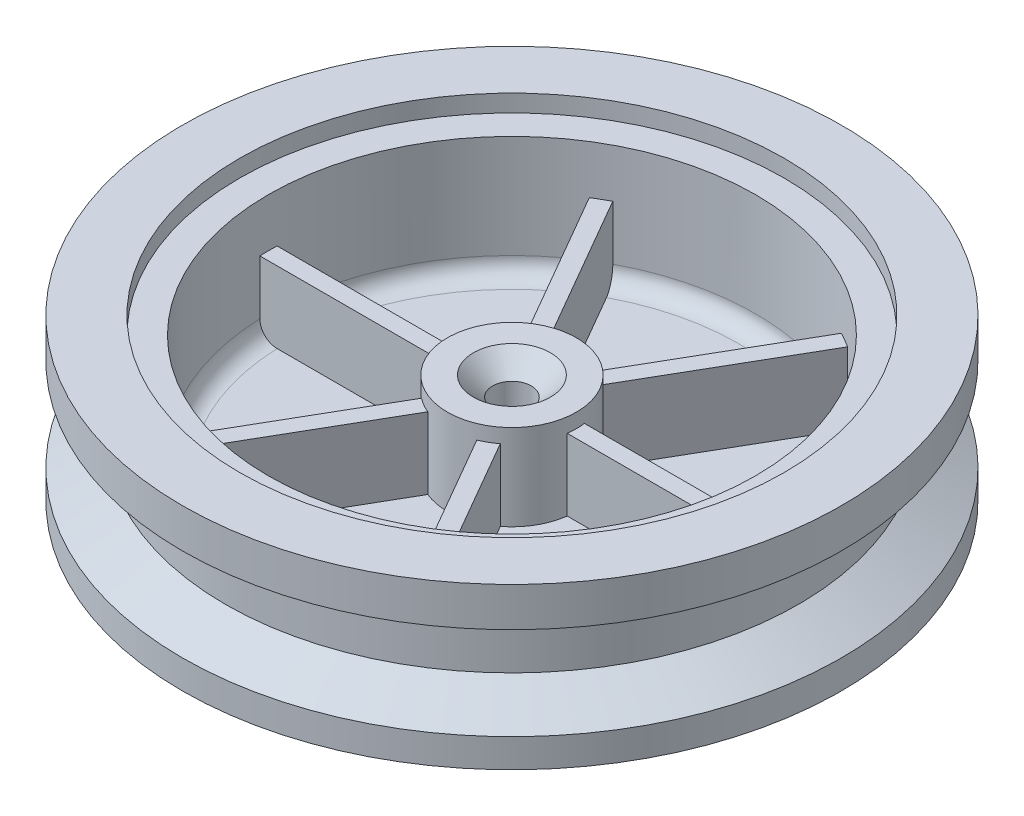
ISO-10303-21;
HEADER;
FILE_DESCRIPTION(('STEP AP214'),'2;1');
FILE_NAME('part.step','',(''),(''),'','','');
FILE_SCHEMA(('AUTOMOTIVE_DESIGN { 1 0 10303 214 1 1 1 1 }'));
ENDSEC;
DATA;
#1=APPLICATION_CONTEXT('core data for automotive mechanical design processes');
#2=APPLICATION_PROTOCOL_DEFINITION('international standard','automotive_design',2000,#1);
#3=PRODUCT_CONTEXT('',#1,'mechanical');
#4=PRODUCT('Part','Part','',(#3));
#5=PRODUCT_RELATED_PRODUCT_CATEGORY('part','',(#4));
#6=PRODUCT_DEFINITION_FORMATION('','',#4);
#7=PRODUCT_DEFINITION_CONTEXT('part definition',#1,'design');
#8=PRODUCT_DEFINITION('design','',#6,#7);
#9=PRODUCT_DEFINITION_SHAPE('','',#8);
#10=(LENGTH_UNIT() NAMED_UNIT(*) SI_UNIT(.MILLI.,.METRE.));
#11=(NAMED_UNIT(*) PLANE_ANGLE_UNIT() SI_UNIT($,.RADIAN.));
#12=(NAMED_UNIT(*) SI_UNIT($,.STERADIAN.) SOLID_ANGLE_UNIT());
#13=UNCERTAINTY_MEASURE_WITH_UNIT(LENGTH_MEASURE(1.E-05),#10,'distance_accuracy_value','');
#14=(GEOMETRIC_REPRESENTATION_CONTEXT(3) GLOBAL_UNCERTAINTY_ASSIGNED_CONTEXT((#13)) GLOBAL_UNIT_ASSIGNED_CONTEXT((#10,
#11,#12)) REPRESENTATION_CONTEXT('',''));
#15=CARTESIAN_POINT('',(0.,0.,0.));
#16=DIRECTION('',(0.,0.,1.));
#17=DIRECTION('',(1.,0.,0.));
#18=AXIS2_PLACEMENT_3D('',#15,#16,#17);
#19=CARTESIAN_POINT('',(85.,20.,0.));
#20=DIRECTION('',(0.,-1.,0.));
#21=DIRECTION('',(0.,0.,-1.));
#22=AXIS2_PLACEMENT_3D('',#19,#20,#21);
#23=PLANE('',#22);
#24=DIRECTION('',(-0.50000000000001,0.,-0.866025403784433));
#25=VECTOR('',#24,1.);
#26=CARTESIAN_POINT('',(23.8480762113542,20.,35.3060796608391));
#27=LINE('',#26,#25);
#28=CARTESIAN_POINT('',(42.0695849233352,19.9999999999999,66.8666585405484));
#29=VERTEX_POINT('',#28);
#30=CARTESIAN_POINT('',(13.7476277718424,20.,17.8115897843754));
#31=VERTEX_POINT('',#30);
#32=EDGE_CURVE('E263',#29,#31,#27,.T.);
#33=ORIENTED_EDGE('',*,*,#32,.F.);
#34=CARTESIAN_POINT('',(0.,20.,0.));
#35=DIRECTION('',(0.,-1.,0.));
#36=DIRECTION('',(0.,0.,-1.));
#37=AXIS2_PLACEMENT_3D('',#34,#35,#36);
#38=CIRCLE('',#37,79.);
#39=CARTESIAN_POINT('',(78.9430174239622,20.,3.));
#40=VERTEX_POINT('',#39);
#41=EDGE_CURVE('E446',#29,#40,#38,.F.);
#42=ORIENTED_EDGE('',*,*,#41,.T.);
#43=DIRECTION('',(1.,0.,0.));
#44=VECTOR('',#43,1.);
#45=CARTESIAN_POINT('',(85.,20.,3.));
#46=LINE('',#45,#44);
#47=CARTESIAN_POINT('',(22.2991031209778,20.,3.));
#48=VERTEX_POINT('',#47);
#49=EDGE_CURVE('E383',#48,#40,#46,.T.);
#50=ORIENTED_EDGE('',*,*,#49,.F.);
#51=CARTESIAN_POINT('',(0.,20.,0.));
#52=DIRECTION('',(0.,1.,0.));
#53=DIRECTION('',(0.,0.,1.));
#54=AXIS2_PLACEMENT_3D('',#51,#52,#53);
#55=CIRCLE('',#54,22.5);
#56=EDGE_CURVE('E408',#31,#48,#55,.T.);
#57=ORIENTED_EDGE('',*,*,#56,.F.);
#58=EDGE_LOOP('',(#33,#42,#50,#57));
#59=FACE_BOUND('',#58,.T.);
#60=ADVANCED_FACE('F33',(#59),#23,.F.);
#61=CARTESIAN_POINT('',(0.,0.,0.));
#62=DIRECTION('',(0.,1.,0.));
#63=DIRECTION('',(0.,0.,1.));
#64=AXIS2_PLACEMENT_3D('',#61,#62,#63);
#65=CYLINDRICAL_SURFACE('',#64,22.5);
#66=CARTESIAN_POINT('',(0.,50.,0.));
#67=DIRECTION('',(0.,1.,0.));
#68=DIRECTION('',(0.,0.,1.));
#69=AXIS2_PLACEMENT_3D('',#66,#67,#68);
#70=CIRCLE('',#69,22.5);
#71=CARTESIAN_POINT('',(0.,50.,22.5));
#72=VERTEX_POINT('',#71);
#73=EDGE_CURVE('E405',#72,#72,#70,.T.);
#74=ORIENTED_EDGE('',*,*,#73,.F.);
#75=EDGE_LOOP('',(#74));
#76=FACE_BOUND('',#75,.T.);
#77=DIRECTION('',(0.,1.,0.));
#78=VECTOR('',#77,1.);
#79=CARTESIAN_POINT('',(13.7476277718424,0.,17.8115897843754));
#80=LINE('',#79,#78);
#81=CARTESIAN_POINT('',(13.7476277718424,45.,17.8115897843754));
#82=VERTEX_POINT('',#81);
#83=EDGE_CURVE('E261',#31,#82,#80,.T.);
#84=ORIENTED_EDGE('',*,*,#83,.F.);
#85=ORIENTED_EDGE('',*,*,#56,.T.);
#86=DIRECTION('',(0.,1.,0.));
#87=VECTOR('',#86,1.);
#88=CARTESIAN_POINT('',(22.2991031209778,0.,3.));
#89=LINE('',#88,#87);
#90=CARTESIAN_POINT('',(22.2991031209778,45.,3.));
#91=VERTEX_POINT('',#90);
#92=EDGE_CURVE('E391',#48,#91,#89,.T.);
#93=ORIENTED_EDGE('',*,*,#92,.T.);
#94=CARTESIAN_POINT('',(0.,45.,0.));
#95=DIRECTION('',(0.,1.,0.));
#96=DIRECTION('',(0.,0.,1.));
#97=AXIS2_PLACEMENT_3D('',#94,#95,#96);
#98=CIRCLE('',#97,22.5);
#99=CARTESIAN_POINT('',(22.2991031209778,45.,-3.));
#100=VERTEX_POINT('',#99);
#101=EDGE_CURVE('E455',#91,#100,#98,.T.);
#102=ORIENTED_EDGE('',*,*,#101,.T.);
#103=DIRECTION('',(0.,1.,0.));
#104=VECTOR('',#103,1.);
#105=CARTESIAN_POINT('',(22.2991031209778,0.,-3.));
#106=LINE('',#105,#104);
#107=CARTESIAN_POINT('',(22.2991031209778,20.,-3.));
#108=VERTEX_POINT('',#107);
#109=EDGE_CURVE('E397',#108,#100,#106,.T.);
#110=ORIENTED_EDGE('',*,*,#109,.F.);
#111=CARTESIAN_POINT('',(13.7476277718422,20.,-17.8115897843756));
#112=VERTEX_POINT('',#111);
#113=EDGE_CURVE('E409',#108,#112,#55,.T.);
#114=ORIENTED_EDGE('',*,*,#113,.T.);
#115=DIRECTION('',(0.,1.,0.));
#116=VECTOR('',#115,1.);
#117=CARTESIAN_POINT('',(13.7476277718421,0.,-17.8115897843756));
#118=LINE('',#117,#116);
#119=CARTESIAN_POINT('',(13.7476277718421,45.,-17.8115897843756));
#120=VERTEX_POINT('',#119);
#121=EDGE_CURVE('E365',#112,#120,#118,.T.);
#122=ORIENTED_EDGE('',*,*,#121,.T.);
#123=CARTESIAN_POINT('',(0.,45.,0.));
#124=DIRECTION('',(0.,1.,0.));
#125=DIRECTION('',(0.,0.,1.));
#126=AXIS2_PLACEMENT_3D('',#123,#124,#125);
#127=CIRCLE('',#126,22.5);
#128=CARTESIAN_POINT('',(8.55147534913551,45.,-20.8115897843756));
#129=VERTEX_POINT('',#128);
#130=EDGE_CURVE('E488',#120,#129,#127,.T.);
#131=ORIENTED_EDGE('',*,*,#130,.T.);
#132=DIRECTION('',(0.,1.,0.));
#133=VECTOR('',#132,1.);
#134=CARTESIAN_POINT('',(8.55147534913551,0.,-20.8115897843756));
#135=LINE('',#134,#133);
#136=CARTESIAN_POINT('',(8.55147534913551,20.,-20.8115897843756));
#137=VERTEX_POINT('',#136);
#138=EDGE_CURVE('E371',#137,#129,#135,.T.);
#139=ORIENTED_EDGE('',*,*,#138,.F.);
#140=CARTESIAN_POINT('',(-8.55147534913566,20.,-20.8115897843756));
#141=VERTEX_POINT('',#140);
#142=EDGE_CURVE('E413',#137,#141,#55,.T.);
#143=ORIENTED_EDGE('',*,*,#142,.T.);
#144=DIRECTION('',(0.,1.,0.));
#145=VECTOR('',#144,1.);
#146=CARTESIAN_POINT('',(-8.55147534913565,0.,-20.8115897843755));
#147=LINE('',#146,#145);
#148=CARTESIAN_POINT('',(-8.55147534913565,45.,-20.8115897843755));
#149=VERTEX_POINT('',#148);
#150=EDGE_CURVE('E340',#141,#149,#147,.T.);
#151=ORIENTED_EDGE('',*,*,#150,.T.);
#152=CARTESIAN_POINT('',(0.,45.,0.));
#153=DIRECTION('',(0.,1.,0.));
#154=DIRECTION('',(0.,0.,1.));
#155=AXIS2_PLACEMENT_3D('',#152,#153,#154);
#156=CIRCLE('',#155,22.5);
#157=CARTESIAN_POINT('',(-13.7476277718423,45.,-17.8115897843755));
#158=VERTEX_POINT('',#157);
#159=EDGE_CURVE('E494',#149,#158,#156,.T.);
#160=ORIENTED_EDGE('',*,*,#159,.T.);
#161=DIRECTION('',(0.,1.,0.));
#162=VECTOR('',#161,1.);
#163=CARTESIAN_POINT('',(-13.7476277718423,0.,-17.8115897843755));
#164=LINE('',#163,#162);
#165=CARTESIAN_POINT('',(-13.7476277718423,20.,-17.8115897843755));
#166=VERTEX_POINT('',#165);
#167=EDGE_CURVE('E344',#166,#158,#164,.T.);
#168=ORIENTED_EDGE('',*,*,#167,.F.);
#169=CARTESIAN_POINT('',(-22.2991031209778,20.,-3.));
#170=VERTEX_POINT('',#169);
#171=EDGE_CURVE('E619',#166,#170,#55,.T.);
#172=ORIENTED_EDGE('',*,*,#171,.T.);
#173=DIRECTION('',(0.,1.,0.));
#174=VECTOR('',#173,1.);
#175=CARTESIAN_POINT('',(-22.2991031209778,0.,-3.));
#176=LINE('',#175,#174);
#177=CARTESIAN_POINT('',(-22.2991031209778,45.,-3.));
#178=VERTEX_POINT('',#177);
#179=EDGE_CURVE('E312',#170,#178,#176,.T.);
#180=ORIENTED_EDGE('',*,*,#179,.T.);
#181=CARTESIAN_POINT('',(0.,45.,0.));
#182=DIRECTION('',(0.,1.,0.));
#183=DIRECTION('',(0.,0.,1.));
#184=AXIS2_PLACEMENT_3D('',#181,#182,#183);
#185=CIRCLE('',#184,22.5);
#186=CARTESIAN_POINT('',(-22.2991031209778,45.,3.));
#187=VERTEX_POINT('',#186);
#188=EDGE_CURVE('E304',#178,#187,#185,.T.);
#189=ORIENTED_EDGE('',*,*,#188,.T.);
#190=DIRECTION('',(0.,1.,0.));
#191=VECTOR('',#190,1.);
#192=CARTESIAN_POINT('',(-22.2991031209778,0.,3.));
#193=LINE('',#192,#191);
#194=CARTESIAN_POINT('',(-22.2991031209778,20.,3.));
#195=VERTEX_POINT('',#194);
#196=EDGE_CURVE('E314',#195,#187,#193,.T.);
#197=ORIENTED_EDGE('',*,*,#196,.F.);
#198=CARTESIAN_POINT('',(-13.747627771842,20.,17.8115897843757));
#199=VERTEX_POINT('',#198);
#200=EDGE_CURVE('E613',#195,#199,#55,.T.);
#201=ORIENTED_EDGE('',*,*,#200,.T.);
#202=DIRECTION('',(0.,1.,0.));
#203=VECTOR('',#202,1.);
#204=CARTESIAN_POINT('',(-13.747627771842,0.,17.8115897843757));
#205=LINE('',#204,#203);
#206=CARTESIAN_POINT('',(-13.747627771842,45.,17.8115897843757));
#207=VERTEX_POINT('',#206);
#208=EDGE_CURVE('E285',#199,#207,#205,.T.);
#209=ORIENTED_EDGE('',*,*,#208,.T.);
#210=CARTESIAN_POINT('',(0.,45.,0.));
#211=DIRECTION('',(0.,1.,0.));
#212=DIRECTION('',(0.,0.,1.));
#213=AXIS2_PLACEMENT_3D('',#210,#211,#212);
#214=CIRCLE('',#213,22.5);
#215=CARTESIAN_POINT('',(-8.55147534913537,45.,20.8115897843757));
#216=VERTEX_POINT('',#215);
#217=EDGE_CURVE('E282',#207,#216,#214,.T.);
#218=ORIENTED_EDGE('',*,*,#217,.T.);
#219=DIRECTION('',(0.,1.,0.));
#220=VECTOR('',#219,1.);
#221=CARTESIAN_POINT('',(-8.55147534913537,0.,20.8115897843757));
#222=LINE('',#221,#220);
#223=CARTESIAN_POINT('',(-8.55147534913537,20.,20.8115897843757));
#224=VERTEX_POINT('',#223);
#225=EDGE_CURVE('E288',#224,#216,#222,.T.);
#226=ORIENTED_EDGE('',*,*,#225,.F.);
#227=CARTESIAN_POINT('',(8.5514753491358,20.,20.8115897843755));
#228=VERTEX_POINT('',#227);
#229=EDGE_CURVE('E260',#224,#228,#55,.T.);
#230=ORIENTED_EDGE('',*,*,#229,.T.);
#231=DIRECTION('',(0.,1.,0.));
#232=VECTOR('',#231,1.);
#233=CARTESIAN_POINT('',(8.5514753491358,0.,20.8115897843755));
#234=LINE('',#233,#232);
#235=CARTESIAN_POINT('',(8.5514753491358,45.,20.8115897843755));
#236=VERTEX_POINT('',#235);
#237=EDGE_CURVE('E241',#228,#236,#234,.T.);
#238=ORIENTED_EDGE('',*,*,#237,.T.);
#239=CARTESIAN_POINT('',(0.,45.,0.));
#240=DIRECTION('',(0.,1.,0.));
#241=DIRECTION('',(0.,0.,1.));
#242=AXIS2_PLACEMENT_3D('',#239,#240,#241);
#243=CIRCLE('',#242,22.5);
#244=EDGE_CURVE('E250',#236,#82,#243,.T.);
#245=ORIENTED_EDGE('',*,*,#244,.T.);
#246=EDGE_LOOP('',(#84,#85,#93,#102,#110,#114,#122,#131,#139,#143,#151,#160,#168,#172,#180,#189,
#197,#201,#209,#218,#226,#230,#238,#245));
#247=FACE_BOUND('',#246,.T.);
#248=ADVANCED_FACE('F257',(#76,#247),#65,.T.);
#249=CARTESIAN_POINT('',(0.,26.,0.));
#250=DIRECTION('',(0.,-1.,0.));
#251=DIRECTION('',(0.,0.,-1.));
#252=AXIS2_PLACEMENT_3D('',#249,#250,#251);
#253=TOROIDAL_SURFACE('',#252,79.,6.);
#254=CARTESIAN_POINT('',(33.8758867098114,26.3390568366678,64.6747569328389));
#255=CARTESIAN_POINT('',(33.8711087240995,26.1706882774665,64.666481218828));
#256=CARTESIAN_POINT('',(33.8699008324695,26.0019178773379,64.664389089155));
#257=CARTESIAN_POINT('',(33.874593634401,25.6647807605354,64.6725172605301));
#258=CARTESIAN_POINT('',(33.8804939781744,25.496414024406,64.6827369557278));
#259=CARTESIAN_POINT('',(33.8993643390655,25.1613963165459,64.7154213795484));
#260=CARTESIAN_POINT('',(33.9123292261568,24.9947441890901,64.7378772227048));
#261=CARTESIAN_POINT('',(33.9452295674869,24.6642175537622,64.7948622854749));
#262=CARTESIAN_POINT('',(33.9651649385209,24.5003430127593,64.8293913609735));
#263=CARTESIAN_POINT('',(34.0118712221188,24.1764881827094,64.9102890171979));
#264=CARTESIAN_POINT('',(34.0386440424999,24.0165089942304,64.9566609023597));
#265=CARTESIAN_POINT('',(34.0988422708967,23.7015703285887,65.0609272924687));
#266=CARTESIAN_POINT('',(34.1322701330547,23.5466127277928,65.1188260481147));
#267=CARTESIAN_POINT('',(34.2055129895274,23.2429652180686,65.245686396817));
#268=CARTESIAN_POINT('',(34.2453243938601,23.0942718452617,65.3146417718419));
#269=CARTESIAN_POINT('',(34.3310797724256,22.8040613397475,65.4631744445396));
#270=CARTESIAN_POINT('',(34.3770260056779,22.6625468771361,65.542755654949));
#271=CARTESIAN_POINT('',(34.4747117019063,22.3877581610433,65.7119522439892));
#272=CARTESIAN_POINT('',(34.5264511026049,22.2544838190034,65.8015675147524));
#273=CARTESIAN_POINT('',(34.6353752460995,21.997070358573,65.990229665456));
#274=CARTESIAN_POINT('',(34.6925619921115,21.8729346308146,66.0892800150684));
#275=CARTESIAN_POINT('',(34.8119447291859,21.6347578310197,66.2960569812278));
#276=CARTESIAN_POINT('',(34.8741396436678,21.520714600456,66.4037817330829));
#277=CARTESIAN_POINT('',(35.0031309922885,21.3034597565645,66.6272013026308));
#278=CARTESIAN_POINT('',(35.0699291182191,21.2002521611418,66.7428990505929));
#279=CARTESIAN_POINT('',(35.2076561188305,21.0054124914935,66.9814492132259));
#280=CARTESIAN_POINT('',(35.2785864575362,20.9137845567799,67.1043041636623));
#281=CARTESIAN_POINT('',(35.4240786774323,20.7427641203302,67.3563040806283));
#282=CARTESIAN_POINT('',(35.4986418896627,20.6633761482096,67.4854513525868));
#283=CARTESIAN_POINT('',(35.6508136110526,20.5174698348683,67.7490205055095));
#284=CARTESIAN_POINT('',(35.7284207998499,20.4509459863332,67.8834400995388));
#285=CARTESIAN_POINT('',(35.8861856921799,20.3311733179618,68.156696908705));
#286=CARTESIAN_POINT('',(35.9663443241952,20.2779293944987,68.2955357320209));
#287=CARTESIAN_POINT('',(36.1286559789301,20.1851105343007,68.5766677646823));
#288=CARTESIAN_POINT('',(36.2108097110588,20.1455405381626,68.7189622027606));
#289=CARTESIAN_POINT('',(36.3764877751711,20.0803571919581,69.0059250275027));
#290=CARTESIAN_POINT('',(36.4600125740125,20.054748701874,69.150594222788));
#291=CARTESIAN_POINT('',(36.7117671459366,19.9992445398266,69.5866459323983));
#292=CARTESIAN_POINT('',(36.8813471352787,19.9905731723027,69.8803670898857));
#293=CARTESIAN_POINT('',(37.1342194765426,20.0202799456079,70.3183548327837));
#294=CARTESIAN_POINT('',(37.2183177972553,20.0373275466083,70.4640173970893));
#295=CARTESIAN_POINT('',(37.3855005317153,20.0855215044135,70.7535863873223));
#296=CARTESIAN_POINT('',(37.4685852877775,20.11666295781,70.8974934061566));
#297=CARTESIAN_POINT('',(37.6331671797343,20.1928481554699,71.1825576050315));
#298=CARTESIAN_POINT('',(37.7146637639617,20.2378966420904,71.3237138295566));
#299=CARTESIAN_POINT('',(37.8754412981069,20.3415510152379,71.6021886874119));
#300=CARTESIAN_POINT('',(37.9547230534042,20.4001518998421,71.7395087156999));
#301=CARTESIAN_POINT('',(38.1105510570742,20.5305193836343,72.0094107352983));
#302=CARTESIAN_POINT('',(38.1870967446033,20.6022886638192,72.1419917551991));
#303=CARTESIAN_POINT('',(38.3368634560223,20.7584469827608,72.4013953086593));
#304=CARTESIAN_POINT('',(38.4100856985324,20.8428313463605,72.528219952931));
#305=CARTESIAN_POINT('',(38.5527415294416,21.0236759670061,72.7753071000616));
#306=CARTESIAN_POINT('',(38.6221736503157,21.1201408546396,72.8955670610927));
#307=CARTESIAN_POINT('',(38.7566988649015,21.3243980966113,73.1285715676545));
#308=CARTESIAN_POINT('',(38.8217935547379,21.4321862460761,73.2413188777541));
#309=CARTESIAN_POINT('',(38.9471962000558,21.658332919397,73.4585226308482));
#310=CARTESIAN_POINT('',(39.0075050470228,21.7766894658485,73.562980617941));
#311=CARTESIAN_POINT('',(39.1228980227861,22.0231036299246,73.7628471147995));
#312=CARTESIAN_POINT('',(39.1779840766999,22.1511576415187,73.8582589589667));
#313=CARTESIAN_POINT('',(39.2825855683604,22.4161504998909,74.0394340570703));
#314=CARTESIAN_POINT('',(39.3320986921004,22.5530930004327,74.1251933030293));
#315=CARTESIAN_POINT('',(39.4251572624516,22.8347888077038,74.2863754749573));
#316=CARTESIAN_POINT('',(39.4687049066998,22.9795392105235,74.3618022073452));
#317=CARTESIAN_POINT('',(39.5495420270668,23.2758635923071,74.5018162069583));
#318=CARTESIAN_POINT('',(39.5868316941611,23.4274373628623,74.566403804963));
#319=CARTESIAN_POINT('',(39.6548756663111,23.7362753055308,74.6842594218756));
#320=CARTESIAN_POINT('',(39.6856323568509,23.8935373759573,74.7375315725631));
#321=CARTESIAN_POINT('',(39.7404017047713,24.2126559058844,74.8323948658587));
#322=CARTESIAN_POINT('',(39.7644159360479,24.3745112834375,74.8739887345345));
#323=CARTESIAN_POINT('',(39.8055330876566,24.7016308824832,74.9452057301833));
#324=CARTESIAN_POINT('',(39.8226377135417,24.866894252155,74.9748318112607));
#325=CARTESIAN_POINT('',(39.8538407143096,25.248997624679,75.0288769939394));
#326=CARTESIAN_POINT('',(39.8655563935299,25.4666449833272,75.0491691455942));
#327=CARTESIAN_POINT('',(39.8741690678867,25.7937803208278,75.0640867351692));
#328=CARTESIAN_POINT('',(39.8755482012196,25.9028754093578,75.0664754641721));
#329=CARTESIAN_POINT('',(39.8753297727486,26.1210467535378,75.0660971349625));
#330=CARTESIAN_POINT('',(39.8737324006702,26.2301230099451,75.0633304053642));
#331=CARTESIAN_POINT('',(39.8706481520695,26.3390568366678,75.0579883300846));
#332=B_SPLINE_CURVE_WITH_KNOTS('',3,(#254,#255,#256,#257,#258,#259,#260,#261,#262,#263,#264,
#265,#266,#267,#268,#269,#270,#271,#272,#273,#274,#275,#276,#277,#278,#279,#280,#281,#282,#283,
#284,#285,#286,#287,#288,#289,#290,#291,#292,#293,#294,#295,#296,#297,#298,#299,#300,#301,#302,
#303,#304,#305,#306,#307,#308,#309,#310,#311,#312,#313,#314,#315,#316,#317,#318,#319,#320,#321,
#322,#323,#324,#325,#326,#327,#328,#329,#330,#331),.UNSPECIFIED.,.F.,.F.,(4,2,2,2,2,2,2,2,2,2,2,
2,2,2,2,2,2,2,2,2,2,2,2,2,2,2,2,2,2,2,2,2,2,2,2,2,2,2,4),(0.,0.50576404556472,1.01150320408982,
1.51687560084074,2.0222419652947,2.52774949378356,3.03344378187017,3.53885466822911,
4.0444521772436,4.5500442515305,5.05582297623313,5.56149326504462,6.06735040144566,
6.57338786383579,7.07961214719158,7.5856192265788,8.09181259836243,8.59818867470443,
9.10474090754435,10.1167971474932,10.6235206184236,11.1300679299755,11.6367881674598,
12.1433216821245,12.6499584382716,13.1564078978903,13.6630520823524,14.1695087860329,
14.6758709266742,15.1820456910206,15.6884298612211,16.1946269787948,16.7008086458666,
17.2068051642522,17.7126834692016,18.2184368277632,18.8736699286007,19.2009233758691,
19.5281559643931),.UNSPECIFIED.);
#333=CARTESIAN_POINT('',(36.8734325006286,19.9999999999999,69.8666585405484));
#334=VERTEX_POINT('',#333);
#335=CARTESIAN_POINT('',(39.8754449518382,26.,75.0662966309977));
#336=VERTEX_POINT('',#335);
#337=EDGE_CURVE('E37',#334,#336,#332,.T.);
#338=ORIENTED_EDGE('',*,*,#337,.F.);
#339=CARTESIAN_POINT('',(-36.8734325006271,19.9999999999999,69.8666585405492));
#340=VERTEX_POINT('',#339);
#341=EDGE_CURVE('E662',#340,#334,#38,.F.);
#342=ORIENTED_EDGE('',*,*,#341,.F.);
#343=CARTESIAN_POINT('',(-33.87588670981,26.3390568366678,64.6747569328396));
#344=CARTESIAN_POINT('',(-33.8711087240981,26.1706882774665,64.6664812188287));
#345=CARTESIAN_POINT('',(-33.8699008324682,26.0019178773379,64.6643890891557));
#346=CARTESIAN_POINT('',(-33.8745936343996,25.6647807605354,64.6725172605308));
#347=CARTESIAN_POINT('',(-33.8804939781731,25.496414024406,64.6827369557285));
#348=CARTESIAN_POINT('',(-33.8993643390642,25.1613963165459,64.7154213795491));
#349=CARTESIAN_POINT('',(-33.9123292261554,24.9947441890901,64.7378772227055));
#350=CARTESIAN_POINT('',(-33.9452295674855,24.6642175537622,64.7948622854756));
#351=CARTESIAN_POINT('',(-33.9651649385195,24.5003430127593,64.8293913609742));
#352=CARTESIAN_POINT('',(-34.0118712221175,24.1764881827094,64.9102890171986));
#353=CARTESIAN_POINT('',(-34.0386440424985,24.0165089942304,64.9566609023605));
#354=CARTESIAN_POINT('',(-34.0988422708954,23.7015703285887,65.0609272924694));
#355=CARTESIAN_POINT('',(-34.1322701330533,23.5466127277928,65.1188260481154));
#356=CARTESIAN_POINT('',(-34.2055129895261,23.2429652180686,65.2456863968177));
#357=CARTESIAN_POINT('',(-34.2453243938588,23.0942718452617,65.3146417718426));
#358=CARTESIAN_POINT('',(-34.3310797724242,22.8040613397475,65.4631744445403));
#359=CARTESIAN_POINT('',(-34.3770260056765,22.6625468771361,65.5427556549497));
#360=CARTESIAN_POINT('',(-34.4747117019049,22.3877581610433,65.71195224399));
#361=CARTESIAN_POINT('',(-34.5264511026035,22.2544838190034,65.8015675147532));
#362=CARTESIAN_POINT('',(-34.6353752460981,21.997070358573,65.9902296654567));
#363=CARTESIAN_POINT('',(-34.6925619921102,21.8729346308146,66.0892800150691));
#364=CARTESIAN_POINT('',(-34.8119447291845,21.6347578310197,66.2960569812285));
#365=CARTESIAN_POINT('',(-34.8741396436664,21.520714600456,66.4037817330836));
#366=CARTESIAN_POINT('',(-35.0031309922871,21.3034597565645,66.6272013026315));
#367=CARTESIAN_POINT('',(-35.0699291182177,21.2002521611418,66.7428990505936));
#368=CARTESIAN_POINT('',(-35.2076561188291,21.0054124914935,66.9814492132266));
#369=CARTESIAN_POINT('',(-35.2785864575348,20.9137845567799,67.104304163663));
#370=CARTESIAN_POINT('',(-35.4240786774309,20.7427641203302,67.356304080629));
#371=CARTESIAN_POINT('',(-35.4986418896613,20.6633761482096,67.4854513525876));
#372=CARTESIAN_POINT('',(-35.6508136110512,20.5174698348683,67.7490205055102));
#373=CARTESIAN_POINT('',(-35.7284207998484,20.4509459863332,67.8834400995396));
#374=CARTESIAN_POINT('',(-35.8861856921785,20.3311733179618,68.1566969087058));
#375=CARTESIAN_POINT('',(-35.9663443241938,20.2779293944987,68.2955357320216));
#376=CARTESIAN_POINT('',(-36.1286559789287,20.1851105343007,68.5766677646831));
#377=CARTESIAN_POINT('',(-36.2108097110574,20.1455405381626,68.7189622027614));
#378=CARTESIAN_POINT('',(-36.3764877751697,20.0803571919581,69.0059250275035));
#379=CARTESIAN_POINT('',(-36.4600125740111,20.054748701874,69.1505942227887));
#380=CARTESIAN_POINT('',(-36.7117671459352,19.9992445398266,69.586645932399));
#381=CARTESIAN_POINT('',(-36.8813471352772,19.9905731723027,69.8803670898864));
#382=CARTESIAN_POINT('',(-37.1342194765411,20.0202799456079,70.3183548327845));
#383=CARTESIAN_POINT('',(-37.2183177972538,20.0373275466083,70.4640173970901));
#384=CARTESIAN_POINT('',(-37.3855005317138,20.0855215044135,70.7535863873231));
#385=CARTESIAN_POINT('',(-37.4685852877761,20.11666295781,70.8974934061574));
#386=CARTESIAN_POINT('',(-37.6331671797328,20.1928481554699,71.1825576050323));
#387=CARTESIAN_POINT('',(-37.7146637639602,20.2378966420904,71.3237138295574));
#388=CARTESIAN_POINT('',(-37.8754412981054,20.3415510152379,71.6021886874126));
#389=CARTESIAN_POINT('',(-37.9547230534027,20.4001518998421,71.7395087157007));
#390=CARTESIAN_POINT('',(-38.1105510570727,20.5305193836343,72.0094107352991));
#391=CARTESIAN_POINT('',(-38.1870967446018,20.6022886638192,72.1419917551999));
#392=CARTESIAN_POINT('',(-38.3368634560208,20.7584469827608,72.4013953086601));
#393=CARTESIAN_POINT('',(-38.4100856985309,20.8428313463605,72.5282199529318));
#394=CARTESIAN_POINT('',(-38.5527415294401,21.0236759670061,72.7753071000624));
#395=CARTESIAN_POINT('',(-38.6221736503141,21.1201408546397,72.8955670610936));
#396=CARTESIAN_POINT('',(-38.7566988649,21.3243980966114,73.1285715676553));
#397=CARTESIAN_POINT('',(-38.8217935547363,21.4321862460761,73.2413188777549));
#398=CARTESIAN_POINT('',(-38.9471962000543,21.658332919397,73.458522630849));
#399=CARTESIAN_POINT('',(-39.0075050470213,21.7766894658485,73.5629806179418));
#400=CARTESIAN_POINT('',(-39.1228980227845,22.0231036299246,73.7628471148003));
#401=CARTESIAN_POINT('',(-39.1779840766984,22.1511576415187,73.8582589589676));
#402=CARTESIAN_POINT('',(-39.2825855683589,22.4161504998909,74.0394340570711));
#403=CARTESIAN_POINT('',(-39.3320986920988,22.5530930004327,74.1251933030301));
#404=CARTESIAN_POINT('',(-39.42515726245,22.8347888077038,74.2863754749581));
#405=CARTESIAN_POINT('',(-39.4687049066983,22.9795392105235,74.361802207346));
#406=CARTESIAN_POINT('',(-39.5495420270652,23.2758635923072,74.5018162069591));
#407=CARTESIAN_POINT('',(-39.5868316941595,23.4274373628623,74.5664038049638));
#408=CARTESIAN_POINT('',(-39.6548756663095,23.7362753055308,74.6842594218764));
#409=CARTESIAN_POINT('',(-39.6856323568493,23.8935373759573,74.737531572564));
#410=CARTESIAN_POINT('',(-39.7404017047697,24.2126559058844,74.8323948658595));
#411=CARTESIAN_POINT('',(-39.7644159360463,24.3745112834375,74.8739887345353));
#412=CARTESIAN_POINT('',(-39.805533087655,24.7016308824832,74.9452057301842));
#413=CARTESIAN_POINT('',(-39.8226377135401,24.866894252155,74.9748318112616));
#414=CARTESIAN_POINT('',(-39.8538407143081,25.248997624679,75.0288769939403));
#415=CARTESIAN_POINT('',(-39.8655563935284,25.4666449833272,75.049169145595));
#416=CARTESIAN_POINT('',(-39.8741690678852,25.7937803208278,75.0640867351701));
#417=CARTESIAN_POINT('',(-39.875548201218,25.9028754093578,75.0664754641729));
#418=CARTESIAN_POINT('',(-39.875329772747,26.1210467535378,75.0660971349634));
#419=CARTESIAN_POINT('',(-39.8737324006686,26.2301230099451,75.063330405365));
#420=CARTESIAN_POINT('',(-39.870648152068,26.3390568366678,75.0579883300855));
#421=B_SPLINE_CURVE_WITH_KNOTS('',3,(#343,#344,#345,#346,#347,#348,#349,#350,#351,#352,#353,
#354,#355,#356,#357,#358,#359,#360,#361,#362,#363,#364,#365,#366,#367,#368,#369,#370,#371,#372,
#373,#374,#375,#376,#377,#378,#379,#380,#381,#382,#383,#384,#385,#386,#387,#388,#389,#390,#391,
#392,#393,#394,#395,#396,#397,#398,#399,#400,#401,#402,#403,#404,#405,#406,#407,#408,#409,#410,
#411,#412,#413,#414,#415,#416,#417,#418,#419,#420),.UNSPECIFIED.,.F.,.F.,(4,2,2,2,2,2,2,2,2,2,2,
2,2,2,2,2,2,2,2,2,2,2,2,2,2,2,2,2,2,2,2,2,2,2,2,2,2,2,4),(0.,0.505764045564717,1.01150320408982,
1.51687560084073,2.0222419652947,2.52774949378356,3.03344378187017,3.5388546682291,
4.0444521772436,4.5500442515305,5.05582297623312,5.56149326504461,6.06735040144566,
6.57338786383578,7.07961214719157,7.58561922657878,8.09181259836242,8.59818867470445,
9.10474090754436,10.1167971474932,10.6235206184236,11.1300679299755,11.6367881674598,
12.1433216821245,12.6499584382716,13.1564078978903,13.6630520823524,14.1695087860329,
14.6758709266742,15.1820456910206,15.6884298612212,16.1946269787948,16.7008086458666,
17.2068051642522,17.7126834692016,18.2184368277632,18.8736699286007,19.2009233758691,
19.5281559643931),.UNSPECIFIED.);
#422=CARTESIAN_POINT('',(-39.8754449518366,26.,75.0662966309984));
#423=VERTEX_POINT('',#422);
#424=EDGE_CURVE('E527',#340,#423,#421,.T.);
#425=ORIENTED_EDGE('',*,*,#424,.T.);
#426=CARTESIAN_POINT('',(0.,26.,0.));
#427=DIRECTION('',(0.,-1.,0.));
#428=DIRECTION('',(0.,0.,-1.));
#429=AXIS2_PLACEMENT_3D('',#426,#427,#428);
#430=CIRCLE('',#429,85.);
#431=EDGE_CURVE('E59',#336,#423,#430,.T.);
#432=ORIENTED_EDGE('',*,*,#431,.F.);
#433=EDGE_LOOP('',(#338,#342,#425,#432));
#434=FACE_BOUND('',#433,.T.);
#435=ADVANCED_FACE('F563',(#434),#253,.F.);
#436=CARTESIAN_POINT('',(0.,20.,60.));
#437=DIRECTION('',(0.,-1.,0.));
#438=DIRECTION('',(0.,0.,-1.));
#439=AXIS2_PLACEMENT_3D('',#436,#437,#438);
#440=CIRCLE('',#439,5.75);
#441=CARTESIAN_POINT('',(0.,20.,54.25));
#442=VERTEX_POINT('',#441);
#443=EDGE_CURVE('E1006',#442,#442,#440,.F.);
#444=ORIENTED_EDGE('',*,*,#443,.F.);
#445=EDGE_LOOP('',(#444));
#446=FACE_BOUND('',#445,.T.);
#447=DIRECTION('',(0.50000000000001,0.,0.866025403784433));
#448=VECTOR('',#447,1.);
#449=CARTESIAN_POINT('',(18.6519237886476,20.,38.3060796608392));
#450=LINE('',#449,#448);
#451=EDGE_CURVE('E270',#228,#334,#450,.T.);
#452=ORIENTED_EDGE('',*,*,#451,.F.);
#453=ORIENTED_EDGE('',*,*,#229,.F.);
#454=DIRECTION('',(0.499999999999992,0.,-0.866025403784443));
#455=VECTOR('',#454,1.);
#456=CARTESIAN_POINT('',(23.8480762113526,20.,-35.3060796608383));
#457=LINE('',#456,#455);
#458=EDGE_CURVE('E291',#340,#224,#457,.T.);
#459=ORIENTED_EDGE('',*,*,#458,.F.);
#460=ORIENTED_EDGE('',*,*,#341,.T.);
#461=EDGE_LOOP('',(#452,#453,#459,#460));
#462=FACE_BOUND('',#461,.T.);
#463=ADVANCED_FACE('F558',(#446,#462),#23,.F.);
#464=CARTESIAN_POINT('',(-39.0720391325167,26.3390568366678,61.6747569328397));
#465=CARTESIAN_POINT('',(-39.0672611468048,26.1706882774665,61.6664812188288));
#466=CARTESIAN_POINT('',(-39.0660532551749,26.0019178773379,61.6643890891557));
#467=CARTESIAN_POINT('',(-39.0707460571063,25.6647807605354,61.6725172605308));
#468=CARTESIAN_POINT('',(-39.0766464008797,25.496414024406,61.6827369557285));
#469=CARTESIAN_POINT('',(-39.0955167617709,25.1613963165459,61.7154213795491));
#470=CARTESIAN_POINT('',(-39.1084816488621,24.9947441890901,61.7378772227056));
#471=CARTESIAN_POINT('',(-39.1413819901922,24.6642175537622,61.7948622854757));
#472=CARTESIAN_POINT('',(-39.1613173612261,24.5003430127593,61.8293913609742));
#473=CARTESIAN_POINT('',(-39.2080236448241,24.1764881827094,61.9102890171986));
#474=CARTESIAN_POINT('',(-39.2347964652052,24.0165089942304,61.9566609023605));
#475=CARTESIAN_POINT('',(-39.294994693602,23.7015703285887,62.0609272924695));
#476=CARTESIAN_POINT('',(-39.32842255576,23.5466127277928,62.1188260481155));
#477=CARTESIAN_POINT('',(-39.4016654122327,23.2429652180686,62.2456863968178));
#478=CARTESIAN_POINT('',(-39.4414768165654,23.0942718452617,62.3146417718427));
#479=CARTESIAN_POINT('',(-39.5272321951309,22.8040613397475,62.4631744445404));
#480=CARTESIAN_POINT('',(-39.5731784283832,22.6625468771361,62.5427556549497));
#481=CARTESIAN_POINT('',(-39.6708641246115,22.3877581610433,62.71195224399));
#482=CARTESIAN_POINT('',(-39.7226035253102,22.2544838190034,62.8015675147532));
#483=CARTESIAN_POINT('',(-39.8315276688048,21.997070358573,62.9902296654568));
#484=CARTESIAN_POINT('',(-39.8887144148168,21.8729346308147,63.0892800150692));
#485=CARTESIAN_POINT('',(-40.0080971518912,21.6347578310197,63.2960569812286));
#486=CARTESIAN_POINT('',(-40.0702920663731,21.520714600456,63.4037817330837));
#487=CARTESIAN_POINT('',(-40.1992834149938,21.3034597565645,63.6272013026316));
#488=CARTESIAN_POINT('',(-40.2660815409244,21.2002521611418,63.7428990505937));
#489=CARTESIAN_POINT('',(-40.4038085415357,21.0054124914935,63.9814492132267));
#490=CARTESIAN_POINT('',(-40.4747388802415,20.9137845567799,64.1043041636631));
#491=CARTESIAN_POINT('',(-40.6202311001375,20.7427641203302,64.356304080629));
#492=CARTESIAN_POINT('',(-40.6947943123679,20.6633761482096,64.4854513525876));
#493=CARTESIAN_POINT('',(-40.8469660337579,20.5174698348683,64.7490205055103));
#494=CARTESIAN_POINT('',(-40.9245732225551,20.4509459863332,64.8834400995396));
#495=CARTESIAN_POINT('',(-41.0823381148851,20.3311733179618,65.1566969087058));
#496=CARTESIAN_POINT('',(-41.1624967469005,20.2779293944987,65.2955357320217));
#497=CARTESIAN_POINT('',(-41.3248084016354,20.1851105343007,65.5766677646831));
#498=CARTESIAN_POINT('',(-41.4069621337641,20.1455405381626,65.7189622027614));
#499=CARTESIAN_POINT('',(-41.5726401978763,20.0803571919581,66.0059250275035));
#500=CARTESIAN_POINT('',(-41.6561649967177,20.054748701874,66.1505942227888));
#501=CARTESIAN_POINT('',(-41.9079195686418,19.9992445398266,66.5866459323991));
#502=CARTESIAN_POINT('',(-42.0774995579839,19.9905731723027,66.8803670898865));
#503=CARTESIAN_POINT('',(-42.3303718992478,20.0202799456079,67.3183548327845));
#504=CARTESIAN_POINT('',(-42.4144702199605,20.0373275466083,67.4640173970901));
#505=CARTESIAN_POINT('',(-42.5816529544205,20.0855215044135,67.7535863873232));
#506=CARTESIAN_POINT('',(-42.6647377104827,20.11666295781,67.8974934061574));
#507=CARTESIAN_POINT('',(-42.8293196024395,20.1928481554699,68.1825576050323));
#508=CARTESIAN_POINT('',(-42.9108161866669,20.2378966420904,68.3237138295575));
#509=CARTESIAN_POINT('',(-43.0715937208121,20.3415510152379,68.6021886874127));
#510=CARTESIAN_POINT('',(-43.1508754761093,20.4001518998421,68.7395087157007));
#511=CARTESIAN_POINT('',(-43.3067034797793,20.5305193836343,69.0094107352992));
#512=CARTESIAN_POINT('',(-43.3832491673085,20.6022886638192,69.1419917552));
#513=CARTESIAN_POINT('',(-43.5330158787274,20.7584469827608,69.4013953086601));
#514=CARTESIAN_POINT('',(-43.6062381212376,20.8428313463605,69.5282199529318));
#515=CARTESIAN_POINT('',(-43.7488939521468,21.0236759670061,69.7753071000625));
#516=CARTESIAN_POINT('',(-43.8183260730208,21.1201408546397,69.8955670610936));
#517=CARTESIAN_POINT('',(-43.9528512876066,21.3243980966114,70.1285715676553));
#518=CARTESIAN_POINT('',(-44.017945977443,21.4321862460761,70.2413188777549));
#519=CARTESIAN_POINT('',(-44.1433486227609,21.658332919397,70.4585226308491));
#520=CARTESIAN_POINT('',(-44.203657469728,21.7766894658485,70.5629806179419));
#521=CARTESIAN_POINT('',(-44.3190504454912,22.0231036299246,70.7628471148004));
#522=CARTESIAN_POINT('',(-44.374136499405,22.1511576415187,70.8582589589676));
#523=CARTESIAN_POINT('',(-44.4787379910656,22.4161504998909,71.0394340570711));
#524=CARTESIAN_POINT('',(-44.5282511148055,22.5530930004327,71.1251933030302));
#525=CARTESIAN_POINT('',(-44.6213096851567,22.8347888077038,71.2863754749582));
#526=CARTESIAN_POINT('',(-44.6648573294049,22.9795392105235,71.361802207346));
#527=CARTESIAN_POINT('',(-44.7456944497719,23.2758635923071,71.5018162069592));
#528=CARTESIAN_POINT('',(-44.7829841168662,23.4274373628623,71.5664038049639));
#529=CARTESIAN_POINT('',(-44.8510280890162,23.7362753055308,71.6842594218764));
#530=CARTESIAN_POINT('',(-44.881784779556,23.8935373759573,71.737531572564));
#531=CARTESIAN_POINT('',(-44.9365541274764,24.2126559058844,71.8323948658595));
#532=CARTESIAN_POINT('',(-44.960568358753,24.3745112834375,71.8739887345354));
#533=CARTESIAN_POINT('',(-45.0016855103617,24.7016308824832,71.9452057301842));
#534=CARTESIAN_POINT('',(-45.0187901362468,24.866894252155,71.9748318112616));
#535=CARTESIAN_POINT('',(-45.0499931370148,25.248997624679,72.0288769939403));
#536=CARTESIAN_POINT('',(-45.061708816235,25.4666449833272,72.049169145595));
#537=CARTESIAN_POINT('',(-45.0703214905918,25.7937803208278,72.0640867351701));
#538=CARTESIAN_POINT('',(-45.0717006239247,25.9028754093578,72.0664754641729));
#539=CARTESIAN_POINT('',(-45.0714821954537,26.1210467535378,72.0660971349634));
#540=CARTESIAN_POINT('',(-45.0698848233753,26.2301230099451,72.063330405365));
#541=CARTESIAN_POINT('',(-45.0668005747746,26.3390568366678,72.0579883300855));
#542=B_SPLINE_CURVE_WITH_KNOTS('',3,(#464,#465,#466,#467,#468,#469,#470,#471,#472,#473,#474,
#475,#476,#477,#478,#479,#480,#481,#482,#483,#484,#485,#486,#487,#488,#489,#490,#491,#492,#493,
#494,#495,#496,#497,#498,#499,#500,#501,#502,#503,#504,#505,#506,#507,#508,#509,#510,#511,#512,
#513,#514,#515,#516,#517,#518,#519,#520,#521,#522,#523,#524,#525,#526,#527,#528,#529,#530,#531,
#532,#533,#534,#535,#536,#537,#538,#539,#540,#541),.UNSPECIFIED.,.F.,.F.,(4,2,2,2,2,2,2,2,2,2,2,
2,2,2,2,2,2,2,2,2,2,2,2,2,2,2,2,2,2,2,2,2,2,2,2,2,2,2,4),(0.,0.505764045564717,1.01150320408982,
1.51687560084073,2.02224196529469,2.52774949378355,3.03344378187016,3.5388546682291,
4.04445217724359,4.5500442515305,5.05582297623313,5.56149326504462,6.06735040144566,
6.5733878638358,7.07961214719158,7.58561922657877,8.09181259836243,8.59818867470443,
9.10474090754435,10.1167971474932,10.6235206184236,11.1300679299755,11.6367881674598,
12.1433216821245,12.6499584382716,13.1564078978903,13.6630520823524,14.1695087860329,
14.6758709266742,15.1820456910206,15.6884298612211,16.1946269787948,16.7008086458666,
17.2068051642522,17.7126834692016,18.2184368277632,18.8736699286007,19.2009233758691,
19.5281559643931),.UNSPECIFIED.);
#543=CARTESIAN_POINT('',(-42.0695849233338,19.9999999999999,66.8666585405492));
#544=VERTEX_POINT('',#543);
#545=CARTESIAN_POINT('',(-45.0715973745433,26.,72.0662966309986));
#546=VERTEX_POINT('',#545);
#547=EDGE_CURVE('E522',#544,#546,#542,.T.);
#548=ORIENTED_EDGE('',*,*,#547,.F.);
#549=CARTESIAN_POINT('',(-78.9430174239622,20.,3.));
#550=VERTEX_POINT('',#549);
#551=EDGE_CURVE('E615',#550,#544,#38,.F.);
#552=ORIENTED_EDGE('',*,*,#551,.F.);
#553=CARTESIAN_POINT('',(-82.9052220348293,21.4919523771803,3.));
#554=CARTESIAN_POINT('',(-83.031908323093,21.6031483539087,3.));
#555=CARTESIAN_POINT('',(-83.1538919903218,21.7196715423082,3.));
#556=CARTESIAN_POINT('',(-83.3876595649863,21.9626087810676,3.));
#557=CARTESIAN_POINT('',(-83.4994407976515,22.0890254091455,3.));
#558=CARTESIAN_POINT('',(-83.7120552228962,22.350935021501,3.));
#559=CARTESIAN_POINT('',(-83.8128786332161,22.4864359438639,3.));
#560=CARTESIAN_POINT('',(-84.0027823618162,22.7655044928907,3.));
#561=CARTESIAN_POINT('',(-84.0918583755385,22.9090750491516,3.));
#562=CARTESIAN_POINT('',(-84.2575190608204,23.2030948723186,3.));
#563=CARTESIAN_POINT('',(-84.3341139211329,23.3535383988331,3.));
#564=CARTESIAN_POINT('',(-84.4743805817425,23.6604012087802,3.));
#565=CARTESIAN_POINT('',(-84.5380476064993,23.8168226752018,3.));
#566=CARTESIAN_POINT('',(-84.651933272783,24.1343779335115,3.));
#567=CARTESIAN_POINT('',(-84.7021601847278,24.2955087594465,3.));
#568=CARTESIAN_POINT('',(-84.7888750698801,24.6214896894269,3.));
#569=CARTESIAN_POINT('',(-84.8253579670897,24.7863411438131,3.));
#570=CARTESIAN_POINT('',(-84.8842793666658,25.1184270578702,3.));
#571=CARTESIAN_POINT('',(-84.9067267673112,25.2856599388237,3.));
#572=CARTESIAN_POINT('',(-84.9374592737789,25.6214843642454,3.));
#573=CARTESIAN_POINT('',(-84.9457391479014,25.79007638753,3.));
#574=CARTESIAN_POINT('',(-84.948060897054,26.1273024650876,3.));
#575=CARTESIAN_POINT('',(-84.9421074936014,26.295936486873,3.));
#576=CARTESIAN_POINT('',(-84.9160103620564,26.6321654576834,3.));
#577=CARTESIAN_POINT('',(-84.8958613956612,26.7997600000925,3.));
#578=CARTESIAN_POINT('',(-84.841526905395,27.132555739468,3.));
#579=CARTESIAN_POINT('',(-84.8073497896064,27.2977583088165,3.));
#580=CARTESIAN_POINT('',(-84.7251907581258,27.6247560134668,3.));
#581=CARTESIAN_POINT('',(-84.677203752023,27.7865498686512,3.));
#582=CARTESIAN_POINT('',(-84.567782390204,28.105470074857,3.));
#583=CARTESIAN_POINT('',(-84.5063530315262,28.2625981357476,3.));
#584=CARTESIAN_POINT('',(-84.3704872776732,28.5711450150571,3.));
#585=CARTESIAN_POINT('',(-84.2960460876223,28.7225617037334,3.));
#586=CARTESIAN_POINT('',(-84.0539638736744,29.1665321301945,3.));
#587=CARTESIAN_POINT('',(-83.8674638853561,29.4490977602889,3.));
#588=CARTESIAN_POINT('',(-83.4497884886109,29.9787676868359,3.));
#589=CARTESIAN_POINT('',(-83.2186130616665,30.22587196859,3.));
#590=CARTESIAN_POINT('',(-82.7179390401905,30.6779533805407,3.));
#591=CARTESIAN_POINT('',(-82.4484216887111,30.8829097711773,3.));
#592=CARTESIAN_POINT('',(-81.8788278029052,31.2446882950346,3.));
#593=CARTESIAN_POINT('',(-81.5787511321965,31.401510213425,3.));
#594=CARTESIAN_POINT('',(-80.9563448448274,31.6626892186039,3.));
#595=CARTESIAN_POINT('',(-80.6340011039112,31.7670126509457,3.));
#596=CARTESIAN_POINT('',(-79.9763797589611,31.9200939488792,3.));
#597=CARTESIAN_POINT('',(-79.6411021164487,31.9688516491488,3.));
#598=CARTESIAN_POINT('',(-78.9669351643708,32.0094395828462,3.));
#599=CARTESIAN_POINT('',(-78.6280439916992,32.0012388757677,3.));
#600=CARTESIAN_POINT('',(-77.9564455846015,31.9280713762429,3.));
#601=CARTESIAN_POINT('',(-77.6237383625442,31.863104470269,3.));
#602=CARTESIAN_POINT('',(-76.973884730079,31.6782244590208,3.));
#603=CARTESIAN_POINT('',(-76.6567414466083,31.5583003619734,3.));
#604=CARTESIAN_POINT('',(-76.0470973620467,31.2668963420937,3.));
#605=CARTESIAN_POINT('',(-75.7545965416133,31.0954164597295,3.));
#606=CARTESIAN_POINT('',(-75.2026334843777,30.7058114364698,3.));
#607=CARTESIAN_POINT('',(-74.9431621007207,30.4876992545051,3.));
#608=CARTESIAN_POINT('',(-74.4645507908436,30.0109823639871,3.));
#609=CARTESIAN_POINT('',(-74.2454107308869,29.7523777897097,3.));
#610=CARTESIAN_POINT('',(-73.853844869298,29.2022026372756,3.));
#611=CARTESIAN_POINT('',(-73.6813874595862,28.9106545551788,3.));
#612=CARTESIAN_POINT('',(-73.3879114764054,28.3027262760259,3.));
#613=CARTESIAN_POINT('',(-73.26689266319,27.9863461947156,3.));
#614=CARTESIAN_POINT('',(-73.0798240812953,27.3379996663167,3.));
#615=CARTESIAN_POINT('',(-73.0137316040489,27.0060455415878,3.));
#616=CARTESIAN_POINT('',(-72.9382456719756,26.3357516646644,3.));
#617=CARTESIAN_POINT('',(-72.9288520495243,25.9974119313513,3.));
#618=CARTESIAN_POINT('',(-72.9670193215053,25.3241269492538,3.));
#619=CARTESIAN_POINT('',(-73.0145528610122,24.9891801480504,3.));
#620=CARTESIAN_POINT('',(-73.1651842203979,24.3320120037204,3.));
#621=CARTESIAN_POINT('',(-73.2682819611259,24.0097906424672,3.));
#622=CARTESIAN_POINT('',(-73.5270657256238,23.3872300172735,3.));
#623=CARTESIAN_POINT('',(-73.6827558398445,23.0868924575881,3.));
#624=CARTESIAN_POINT('',(-74.0424607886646,22.5164771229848,3.));
#625=CARTESIAN_POINT('',(-74.2464758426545,22.2463994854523,3.));
#626=CARTESIAN_POINT('',(-74.5840972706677,21.8699414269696,3.));
#627=CARTESIAN_POINT('',(-74.7020152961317,21.7491434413,3.));
#628=CARTESIAN_POINT('',(-74.9475857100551,21.5179096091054,3.));
#629=CARTESIAN_POINT('',(-75.0752345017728,21.4074699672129,3.));
#630=CARTESIAN_POINT('',(-75.3394157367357,21.1976961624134,3.));
#631=CARTESIAN_POINT('',(-75.4759514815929,21.0983661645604,3.));
#632=CARTESIAN_POINT('',(-75.7568493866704,20.9115829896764,3.));
#633=CARTESIAN_POINT('',(-75.9012086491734,20.8241254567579,3.));
#634=CARTESIAN_POINT('',(-76.1969467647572,20.6615701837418,3.));
#635=CARTESIAN_POINT('',(-76.3483336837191,20.5864871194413,3.));
#636=CARTESIAN_POINT('',(-76.6568360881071,20.4493619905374,3.));
#637=CARTESIAN_POINT('',(-76.8139494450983,20.3873151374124,3.));
#638=CARTESIAN_POINT('',(-77.1328944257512,20.2766483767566,3.));
#639=CARTESIAN_POINT('',(-77.294727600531,20.2280329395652,3.));
#640=CARTESIAN_POINT('',(-77.6218521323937,20.1446158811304,3.));
#641=CARTESIAN_POINT('',(-77.7871421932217,20.1098091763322,3.));
#642=CARTESIAN_POINT('',(-78.1202086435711,20.0542064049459,3.));
#643=CARTESIAN_POINT('',(-78.2879870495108,20.0334224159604,3.));
#644=CARTESIAN_POINT('',(-78.6246361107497,20.0060656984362,3.));
#645=CARTESIAN_POINT('',(-78.7935063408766,19.9994877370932,3.));
#646=CARTESIAN_POINT('',(-79.1313056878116,20.0005748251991,3.));
#647=CARTESIAN_POINT('',(-79.3002347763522,20.008248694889,3.));
#648=CARTESIAN_POINT('',(-79.6367834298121,20.0377973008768,3.));
#649=CARTESIAN_POINT('',(-79.8044034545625,20.0596668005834,3.));
#650=CARTESIAN_POINT('',(-80.1373721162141,20.117476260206,3.));
#651=CARTESIAN_POINT('',(-80.3027183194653,20.1534302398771,3.));
#652=CARTESIAN_POINT('',(-80.6297294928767,20.2391368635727,3.));
#653=CARTESIAN_POINT('',(-80.7913957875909,20.2888844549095,3.));
#654=CARTESIAN_POINT('',(-81.1098193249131,20.4017830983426,3.));
#655=CARTESIAN_POINT('',(-81.2665808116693,20.4649221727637,3.));
#656=CARTESIAN_POINT('',(-81.5741785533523,20.6041569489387,3.));
#657=CARTESIAN_POINT('',(-81.7250163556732,20.6802492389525,3.));
#658=CARTESIAN_POINT('',(-82.0567008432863,20.8655156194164,3.));
#659=CARTESIAN_POINT('',(-82.2355988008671,20.9782017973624,3.));
#660=CARTESIAN_POINT('',(-82.5805304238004,21.221790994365,3.));
#661=CARTESIAN_POINT('',(-82.746564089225,21.3526940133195,3.));
#662=CARTESIAN_POINT('',(-82.9052220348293,21.4919523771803,3.));
#663=B_SPLINE_CURVE_WITH_KNOTS('',3,(#553,#554,#555,#556,#557,#558,#559,#560,#561,#562,#563,
#564,#565,#566,#567,#568,#569,#570,#571,#572,#573,#574,#575,#576,#577,#578,#579,#580,#581,#582,
#583,#584,#585,#586,#587,#588,#589,#590,#591,#592,#593,#594,#595,#596,#597,#598,#599,#600,#601,
#602,#603,#604,#605,#606,#607,#608,#609,#610,#611,#612,#613,#614,#615,#616,#617,#618,#619,#620,
#621,#622,#623,#624,#625,#626,#627,#628,#629,#630,#631,#632,#633,#634,#635,#636,#637,#638,#639,
#640,#641,#642,#643,#644,#645,#646,#647,#648,#649,#650,#651,#652,#653,#654,#655,#656,#657,#658,
#659,#660,#661,#662),.UNSPECIFIED.,.T.,.F.,(4,2,2,2,2,2,2,2,2,2,2,2,2,2,2,2,2,2,2,2,2,2,2,2,2,2,
2,2,2,2,2,2,2,2,2,2,2,2,2,2,2,2,2,2,2,2,2,2,2,2,2,2,2,2,4),(0.,0.505509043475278,
1.01115023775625,1.51723918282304,2.02351306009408,2.52937155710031,3.03541657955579,
3.54114948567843,4.04706898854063,4.55266742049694,5.05845251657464,5.56406985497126,
6.06987386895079,6.5753751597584,7.08106302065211,7.5865632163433,8.09225008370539,
9.10271054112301,10.1131714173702,11.1241283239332,12.1350897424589,13.1466984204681,
14.1583101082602,15.1704713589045,16.182634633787,17.1950004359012,18.2073654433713,
19.2194494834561,20.2315301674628,21.2429238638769,22.2543128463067,23.2649146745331,
24.2755135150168,25.2856269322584,26.2957389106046,27.3059294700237,28.3161246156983,
28.8220630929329,29.3278154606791,29.8337568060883,30.3395120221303,30.8458628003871,
31.3520272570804,31.8583599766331,32.3645061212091,32.8710876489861,33.3774825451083,
33.8841909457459,34.3907125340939,34.8977396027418,35.4045811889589,35.9109713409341,
36.4172283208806,37.0503120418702,37.6833957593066),.UNSPECIFIED.);
#664=CARTESIAN_POINT('',(-84.9470423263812,26.,3.));
#665=VERTEX_POINT('',#664);
#666=EDGE_CURVE('E517',#550,#665,#663,.T.);
#667=ORIENTED_EDGE('',*,*,#666,.T.);
#668=EDGE_CURVE('E674',#546,#665,#430,.T.);
#669=ORIENTED_EDGE('',*,*,#668,.F.);
#670=EDGE_LOOP('',(#548,#552,#667,#669));
#671=FACE_BOUND('',#670,.T.);
#672=ADVANCED_FACE('F568',(#671),#253,.F.);
#673=DIRECTION('',(-0.499999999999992,0.,0.866025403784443));
#674=VECTOR('',#673,1.);
#675=CARTESIAN_POINT('',(18.651923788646,20.,-38.3060796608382));
#676=LINE('',#675,#674);
#677=EDGE_CURVE('E296',#199,#544,#676,.T.);
#678=ORIENTED_EDGE('',*,*,#677,.F.);
#679=ORIENTED_EDGE('',*,*,#200,.F.);
#680=DIRECTION('',(1.,0.,0.));
#681=VECTOR('',#680,1.);
#682=CARTESIAN_POINT('',(85.,20.,3.));
#683=LINE('',#682,#681);
#684=EDGE_CURVE('E315',#550,#195,#683,.T.);
#685=ORIENTED_EDGE('',*,*,#684,.F.);
#686=ORIENTED_EDGE('',*,*,#551,.T.);
#687=EDGE_LOOP('',(#678,#679,#685,#686));
#688=FACE_BOUND('',#687,.T.);
#689=ADVANCED_FACE('F570',(#688),#23,.F.);
#690=CARTESIAN_POINT('',(-82.9052220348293,21.4919523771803,-3.));
#691=CARTESIAN_POINT('',(-83.031908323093,21.6031483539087,-3.));
#692=CARTESIAN_POINT('',(-83.1538919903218,21.7196715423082,-3.));
#693=CARTESIAN_POINT('',(-83.3876595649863,21.9626087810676,-3.));
#694=CARTESIAN_POINT('',(-83.4994407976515,22.0890254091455,-3.));
#695=CARTESIAN_POINT('',(-83.7120552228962,22.350935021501,-3.));
#696=CARTESIAN_POINT('',(-83.8128786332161,22.4864359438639,-3.));
#697=CARTESIAN_POINT('',(-84.0027823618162,22.7655044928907,-3.));
#698=CARTESIAN_POINT('',(-84.0918583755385,22.9090750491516,-3.));
#699=CARTESIAN_POINT('',(-84.2575190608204,23.2030948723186,-3.));
#700=CARTESIAN_POINT('',(-84.3341139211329,23.3535383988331,-3.));
#701=CARTESIAN_POINT('',(-84.4743805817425,23.6604012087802,-3.));
#702=CARTESIAN_POINT('',(-84.5380476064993,23.8168226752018,-3.));
#703=CARTESIAN_POINT('',(-84.651933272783,24.1343779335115,-3.));
#704=CARTESIAN_POINT('',(-84.7021601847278,24.2955087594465,-3.));
#705=CARTESIAN_POINT('',(-84.7888750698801,24.6214896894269,-3.));
#706=CARTESIAN_POINT('',(-84.8253579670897,24.7863411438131,-3.));
#707=CARTESIAN_POINT('',(-84.8842793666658,25.1184270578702,-3.));
#708=CARTESIAN_POINT('',(-84.9067267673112,25.2856599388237,-3.));
#709=CARTESIAN_POINT('',(-84.9374592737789,25.6214843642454,-3.));
#710=CARTESIAN_POINT('',(-84.9457391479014,25.79007638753,-3.));
#711=CARTESIAN_POINT('',(-84.948060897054,26.1273024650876,-3.));
#712=CARTESIAN_POINT('',(-84.9421074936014,26.295936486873,-3.));
#713=CARTESIAN_POINT('',(-84.9160103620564,26.6321654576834,-3.));
#714=CARTESIAN_POINT('',(-84.8958613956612,26.7997600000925,-3.));
#715=CARTESIAN_POINT('',(-84.841526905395,27.132555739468,-3.));
#716=CARTESIAN_POINT('',(-84.8073497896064,27.2977583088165,-3.));
#717=CARTESIAN_POINT('',(-84.7251907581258,27.6247560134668,-3.));
#718=CARTESIAN_POINT('',(-84.677203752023,27.7865498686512,-3.));
#719=CARTESIAN_POINT('',(-84.567782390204,28.105470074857,-3.));
#720=CARTESIAN_POINT('',(-84.5063530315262,28.2625981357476,-3.));
#721=CARTESIAN_POINT('',(-84.3704872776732,28.5711450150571,-3.));
#722=CARTESIAN_POINT('',(-84.2960460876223,28.7225617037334,-3.));
#723=CARTESIAN_POINT('',(-84.0539638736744,29.1665321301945,-3.));
#724=CARTESIAN_POINT('',(-83.8674638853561,29.4490977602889,-3.));
#725=CARTESIAN_POINT('',(-83.4497884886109,29.9787676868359,-3.));
#726=CARTESIAN_POINT('',(-83.2186130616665,30.22587196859,-3.));
#727=CARTESIAN_POINT('',(-82.7179390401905,30.6779533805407,-3.));
#728=CARTESIAN_POINT('',(-82.4484216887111,30.8829097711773,-3.));
#729=CARTESIAN_POINT('',(-81.8788278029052,31.2446882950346,-3.));
#730=CARTESIAN_POINT('',(-81.5787511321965,31.401510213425,-3.));
#731=CARTESIAN_POINT('',(-80.9563448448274,31.6626892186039,-3.));
#732=CARTESIAN_POINT('',(-80.6340011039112,31.7670126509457,-3.));
#733=CARTESIAN_POINT('',(-79.9763797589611,31.9200939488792,-3.));
#734=CARTESIAN_POINT('',(-79.6411021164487,31.9688516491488,-3.));
#735=CARTESIAN_POINT('',(-78.9669351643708,32.0094395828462,-3.));
#736=CARTESIAN_POINT('',(-78.6280439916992,32.0012388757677,-3.));
#737=CARTESIAN_POINT('',(-77.9564455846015,31.9280713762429,-3.));
#738=CARTESIAN_POINT('',(-77.6237383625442,31.863104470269,-3.));
#739=CARTESIAN_POINT('',(-76.973884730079,31.6782244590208,-3.));
#740=CARTESIAN_POINT('',(-76.6567414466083,31.5583003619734,-3.));
#741=CARTESIAN_POINT('',(-76.0470973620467,31.2668963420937,-3.));
#742=CARTESIAN_POINT('',(-75.7545965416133,31.0954164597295,-3.));
#743=CARTESIAN_POINT('',(-75.2026334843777,30.7058114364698,-3.));
#744=CARTESIAN_POINT('',(-74.9431621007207,30.4876992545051,-3.));
#745=CARTESIAN_POINT('',(-74.4645507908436,30.0109823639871,-3.));
#746=CARTESIAN_POINT('',(-74.2454107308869,29.7523777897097,-3.));
#747=CARTESIAN_POINT('',(-73.853844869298,29.2022026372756,-3.));
#748=CARTESIAN_POINT('',(-73.6813874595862,28.9106545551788,-3.));
#749=CARTESIAN_POINT('',(-73.3879114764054,28.3027262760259,-3.));
#750=CARTESIAN_POINT('',(-73.26689266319,27.9863461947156,-3.));
#751=CARTESIAN_POINT('',(-73.0798240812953,27.3379996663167,-3.));
#752=CARTESIAN_POINT('',(-73.0137316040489,27.0060455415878,-3.));
#753=CARTESIAN_POINT('',(-72.9382456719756,26.3357516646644,-3.));
#754=CARTESIAN_POINT('',(-72.9288520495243,25.9974119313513,-3.));
#755=CARTESIAN_POINT('',(-72.9670193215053,25.3241269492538,-3.));
#756=CARTESIAN_POINT('',(-73.0145528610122,24.9891801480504,-3.));
#757=CARTESIAN_POINT('',(-73.1651842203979,24.3320120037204,-3.));
#758=CARTESIAN_POINT('',(-73.2682819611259,24.0097906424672,-3.));
#759=CARTESIAN_POINT('',(-73.5270657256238,23.3872300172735,-3.));
#760=CARTESIAN_POINT('',(-73.6827558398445,23.0868924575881,-3.));
#761=CARTESIAN_POINT('',(-74.0424607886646,22.5164771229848,-3.));
#762=CARTESIAN_POINT('',(-74.2464758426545,22.2463994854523,-3.));
#763=CARTESIAN_POINT('',(-74.5840972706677,21.8699414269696,-3.));
#764=CARTESIAN_POINT('',(-74.7020152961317,21.7491434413,-3.));
#765=CARTESIAN_POINT('',(-74.9475857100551,21.5179096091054,-3.));
#766=CARTESIAN_POINT('',(-75.0752345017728,21.4074699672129,-3.));
#767=CARTESIAN_POINT('',(-75.3394157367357,21.1976961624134,-3.));
#768=CARTESIAN_POINT('',(-75.4759514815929,21.0983661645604,-3.));
#769=CARTESIAN_POINT('',(-75.7568493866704,20.9115829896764,-3.));
#770=CARTESIAN_POINT('',(-75.9012086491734,20.8241254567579,-3.));
#771=CARTESIAN_POINT('',(-76.1969467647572,20.6615701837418,-3.));
#772=CARTESIAN_POINT('',(-76.3483336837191,20.5864871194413,-3.));
#773=CARTESIAN_POINT('',(-76.6568360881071,20.4493619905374,-3.));
#774=CARTESIAN_POINT('',(-76.8139494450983,20.3873151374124,-3.));
#775=CARTESIAN_POINT('',(-77.1328944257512,20.2766483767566,-3.));
#776=CARTESIAN_POINT('',(-77.294727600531,20.2280329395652,-3.));
#777=CARTESIAN_POINT('',(-77.6218521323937,20.1446158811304,-3.));
#778=CARTESIAN_POINT('',(-77.7871421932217,20.1098091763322,-3.));
#779=CARTESIAN_POINT('',(-78.1202086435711,20.0542064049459,-3.));
#780=CARTESIAN_POINT('',(-78.2879870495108,20.0334224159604,-3.));
#781=CARTESIAN_POINT('',(-78.6246361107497,20.0060656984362,-3.));
#782=CARTESIAN_POINT('',(-78.7935063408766,19.9994877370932,-3.));
#783=CARTESIAN_POINT('',(-79.1313056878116,20.0005748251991,-3.));
#784=CARTESIAN_POINT('',(-79.3002347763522,20.008248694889,-3.));
#785=CARTESIAN_POINT('',(-79.6367834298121,20.0377973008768,-3.));
#786=CARTESIAN_POINT('',(-79.8044034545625,20.0596668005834,-3.));
#787=CARTESIAN_POINT('',(-80.1373721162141,20.117476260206,-3.));
#788=CARTESIAN_POINT('',(-80.3027183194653,20.1534302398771,-3.));
#789=CARTESIAN_POINT('',(-80.6297294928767,20.2391368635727,-3.));
#790=CARTESIAN_POINT('',(-80.7913957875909,20.2888844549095,-3.));
#791=CARTESIAN_POINT('',(-81.1098193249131,20.4017830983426,-3.));
#792=CARTESIAN_POINT('',(-81.2665808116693,20.4649221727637,-3.));
#793=CARTESIAN_POINT('',(-81.5741785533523,20.6041569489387,-3.));
#794=CARTESIAN_POINT('',(-81.7250163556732,20.6802492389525,-3.));
#795=CARTESIAN_POINT('',(-82.0567008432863,20.8655156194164,-3.));
#796=CARTESIAN_POINT('',(-82.2355988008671,20.9782017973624,-3.));
#797=CARTESIAN_POINT('',(-82.5805304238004,21.221790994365,-3.));
#798=CARTESIAN_POINT('',(-82.746564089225,21.3526940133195,-3.));
#799=CARTESIAN_POINT('',(-82.9052220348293,21.4919523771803,-3.));
#800=B_SPLINE_CURVE_WITH_KNOTS('',3,(#690,#691,#692,#693,#694,#695,#696,#697,#698,#699,#700,
#701,#702,#703,#704,#705,#706,#707,#708,#709,#710,#711,#712,#713,#714,#715,#716,#717,#718,#719,
#720,#721,#722,#723,#724,#725,#726,#727,#728,#729,#730,#731,#732,#733,#734,#735,#736,#737,#738,
#739,#740,#741,#742,#743,#744,#745,#746,#747,#748,#749,#750,#751,#752,#753,#754,#755,#756,#757,
#758,#759,#760,#761,#762,#763,#764,#765,#766,#767,#768,#769,#770,#771,#772,#773,#774,#775,#776,
#777,#778,#779,#780,#781,#782,#783,#784,#785,#786,#787,#788,#789,#790,#791,#792,#793,#794,#795,
#796,#797,#798,#799),.UNSPECIFIED.,.T.,.F.,(4,2,2,2,2,2,2,2,2,2,2,2,2,2,2,2,2,2,2,2,2,2,2,2,2,2,
2,2,2,2,2,2,2,2,2,2,2,2,2,2,2,2,2,2,2,2,2,2,2,2,2,2,2,2,4),(0.,0.505509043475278,
1.01115023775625,1.51723918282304,2.02351306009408,2.52937155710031,3.03541657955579,
3.54114948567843,4.04706898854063,4.55266742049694,5.05845251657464,5.56406985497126,
6.06987386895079,6.5753751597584,7.08106302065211,7.5865632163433,8.09225008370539,
9.10271054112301,10.1131714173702,11.1241283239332,12.1350897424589,13.1466984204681,
14.1583101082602,15.1704713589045,16.182634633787,17.1950004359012,18.2073654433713,
19.2194494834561,20.2315301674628,21.2429238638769,22.2543128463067,23.2649146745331,
24.2755135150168,25.2856269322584,26.2957389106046,27.3059294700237,28.3161246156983,
28.8220630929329,29.3278154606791,29.8337568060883,30.3395120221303,30.8458628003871,
31.3520272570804,31.8583599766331,32.3645061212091,32.8710876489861,33.3774825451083,
33.8841909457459,34.3907125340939,34.8977396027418,35.4045811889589,35.9109713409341,
36.4172283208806,37.0503120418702,37.6833957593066),.UNSPECIFIED.);
#801=CARTESIAN_POINT('',(-78.9430174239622,20.,-3.));
#802=VERTEX_POINT('',#801);
#803=CARTESIAN_POINT('',(-84.9470423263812,26.,-3.));
#804=VERTEX_POINT('',#803);
#805=EDGE_CURVE('E497',#802,#804,#800,.T.);
#806=ORIENTED_EDGE('',*,*,#805,.F.);
#807=CARTESIAN_POINT('',(-42.0695849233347,20.,-66.8666585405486));
#808=VERTEX_POINT('',#807);
#809=EDGE_CURVE('E659',#808,#802,#38,.F.);
#810=ORIENTED_EDGE('',*,*,#809,.F.);
#811=CARTESIAN_POINT('',(-39.0720397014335,26.3390769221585,-61.6747579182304));
#812=CARTESIAN_POINT('',(-39.0672614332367,26.1707083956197,-61.6664817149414));
#813=CARTESIAN_POINT('',(-39.0660532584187,26.0019380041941,-61.6643890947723));
#814=CARTESIAN_POINT('',(-39.0707454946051,25.6648008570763,-61.6725162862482));
#815=CARTESIAN_POINT('',(-39.0766455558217,25.4964340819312,-61.6827354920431));
#816=CARTESIAN_POINT('',(-39.0955153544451,25.1614162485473,-61.7154189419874));
#817=CARTESIAN_POINT('',(-39.1084799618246,24.9947640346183,-61.737874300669));
#818=CARTESIAN_POINT('',(-39.1413797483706,24.6642371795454,-61.7948584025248));
#819=CARTESIAN_POINT('',(-39.1613148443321,24.5003625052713,-61.8293870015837));
#820=CARTESIAN_POINT('',(-39.208020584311,24.1765073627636,-61.9102837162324));
#821=CARTESIAN_POINT('',(-39.2347931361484,24.0165279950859,-61.956655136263));
#822=CARTESIAN_POINT('',(-39.2949908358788,23.7015889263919,-62.0609206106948));
#823=CARTESIAN_POINT('',(-39.328418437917,23.5466311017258,-62.1188189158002));
#824=CARTESIAN_POINT('',(-39.4016607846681,23.242983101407,-62.2456783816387));
#825=CARTESIAN_POINT('',(-39.4414719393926,23.0942894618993,-62.3146333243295));
#826=CARTESIAN_POINT('',(-39.5272268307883,22.8040783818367,-62.4631651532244));
#827=CARTESIAN_POINT('',(-39.5731728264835,22.6625636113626,-62.5427459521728));
#828=CARTESIAN_POINT('',(-39.6708580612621,22.3877742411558,-62.7119417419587));
#829=CARTESIAN_POINT('',(-39.7225972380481,22.2544995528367,-62.8015566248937));
#830=CARTESIAN_POINT('',(-39.8315209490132,21.9970853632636,-62.9902180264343));
#831=CARTESIAN_POINT('',(-39.8887074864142,21.8729492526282,-63.0892680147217));
#832=CARTESIAN_POINT('',(-40.0080898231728,21.6347716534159,-63.2960442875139));
#833=CARTESIAN_POINT('',(-40.0702845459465,21.5207280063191,-63.4037687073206));
#834=CARTESIAN_POINT('',(-40.1992755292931,21.3034722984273,-63.6271876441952));
#835=CARTESIAN_POINT('',(-40.2660734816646,21.2002642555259,-63.7428850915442));
#836=CARTESIAN_POINT('',(-40.4038001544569,21.0054236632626,-63.9814346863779));
#837=CARTESIAN_POINT('',(-40.4747303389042,20.9137952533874,-64.1042893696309));
#838=CARTESIAN_POINT('',(-40.6202222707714,20.7427738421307,-64.3562887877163));
#839=CARTESIAN_POINT('',(-40.694785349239,20.6633853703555,-64.4854358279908));
#840=CARTESIAN_POINT('',(-40.8469568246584,20.5174780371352,-64.74900455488));
#841=CARTESIAN_POINT('',(-40.9245639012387,20.4509536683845,-64.8834239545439));
#842=CARTESIAN_POINT('',(-41.0823285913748,20.3311799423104,-65.1566804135));
#843=CARTESIAN_POINT('',(-41.1624871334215,20.277935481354,-65.2955190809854));
#844=CARTESIAN_POINT('',(-41.3247986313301,20.1851155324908,-65.5766508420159));
#845=CARTESIAN_POINT('',(-41.4069522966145,20.1455449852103,-65.7189451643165));
#846=CARTESIAN_POINT('',(-41.5726302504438,20.0803605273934,-66.0059077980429));
#847=CARTESIAN_POINT('',(-41.6561550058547,20.0547514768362,-66.1505769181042));
#848=CARTESIAN_POINT('',(-41.9079094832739,19.9992456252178,-66.5866284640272));
#849=CARTESIAN_POINT('',(-42.0774894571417,19.9905731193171,-66.8803495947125));
#850=CARTESIAN_POINT('',(-42.3303618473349,20.0202781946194,-67.3183374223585));
#851=CARTESIAN_POINT('',(-42.414460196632,20.0373252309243,-67.4640000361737));
#852=CARTESIAN_POINT('',(-42.5816430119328,20.0855180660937,-67.7535691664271));
#853=CARTESIAN_POINT('',(-42.6647278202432,20.1166589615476,-67.8974762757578));
#854=CARTESIAN_POINT('',(-42.8293098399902,20.1928430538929,-68.1825406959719));
#855=CARTESIAN_POINT('',(-42.9108064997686,20.2378909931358,-68.3236970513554));
#856=CARTESIAN_POINT('',(-43.0715842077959,20.3415442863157,-68.6021722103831));
#857=CARTESIAN_POINT('',(-43.1508660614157,20.4001446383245,-68.7394924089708));
#858=CARTESIAN_POINT('',(-43.306694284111,20.5305110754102,-69.0093948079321));
#859=CARTESIAN_POINT('',(-43.3832400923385,20.6022798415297,-69.1419760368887));
#860=CARTESIAN_POINT('',(-43.5330070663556,20.7584371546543,-69.4013800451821));
#861=CARTESIAN_POINT('',(-43.6062294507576,20.8428210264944,-69.5282049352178));
#862=CARTESIAN_POINT('',(-43.7488855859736,21.0236646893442,-69.7752926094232));
#863=CARTESIAN_POINT('',(-43.818317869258,21.1201291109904,-69.8955528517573));
#864=CARTESIAN_POINT('',(-43.9528434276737,21.3243854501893,-70.1285579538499));
#865=CARTESIAN_POINT('',(-44.0179382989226,21.4321731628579,-70.2413055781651));
#866=CARTESIAN_POINT('',(-44.1433413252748,21.6583189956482,-70.45850999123));
#867=CARTESIAN_POINT('',(-44.2036503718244,21.776675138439,-70.5629683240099));
#868=CARTESIAN_POINT('',(-44.3190437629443,22.0230885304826,-70.7628355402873));
#869=CARTESIAN_POINT('',(-44.3741300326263,22.1511421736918,-70.8582477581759));
#870=CARTESIAN_POINT('',(-44.4787319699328,22.4161343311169,-71.039423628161));
#871=CARTESIAN_POINT('',(-44.5282453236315,22.553076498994,-71.1251832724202));
#872=CARTESIAN_POINT('',(-44.6213043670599,22.8347716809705,-71.286366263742));
#873=CARTESIAN_POINT('',(-44.6648522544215,22.9795217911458,-71.3617934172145));
#874=CARTESIAN_POINT('',(-44.7456898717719,23.2758456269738,-71.5018082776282));
#875=CARTESIAN_POINT('',(-44.7829797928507,23.427419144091,-71.566396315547));
#876=CARTESIAN_POINT('',(-44.8510242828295,23.7362566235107,-71.6842528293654));
#877=CARTESIAN_POINT('',(-44.881781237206,23.8935184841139,-71.7375254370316));
#878=CARTESIAN_POINT('',(-44.9365511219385,24.212636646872,-71.8323896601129));
#879=CARTESIAN_POINT('',(-44.9605656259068,24.3744918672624,-71.8739840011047));
#880=CARTESIAN_POINT('',(-45.0016833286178,24.7016111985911,-71.9452019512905));
#881=CARTESIAN_POINT('',(-45.0187882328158,24.8668744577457,-71.9748285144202));
#882=CARTESIAN_POINT('',(-45.0499924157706,25.2489842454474,-72.0288757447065));
#883=CARTESIAN_POINT('',(-45.06170863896,25.4666382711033,-72.0491688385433));
#884=CARTESIAN_POINT('',(-45.0703215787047,25.7937836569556,-72.0640868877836));
#885=CARTESIAN_POINT('',(-45.0717007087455,25.9028821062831,-72.0664756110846));
#886=CARTESIAN_POINT('',(-45.071482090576,26.1210601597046,-72.0660969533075));
#887=CARTESIAN_POINT('',(-45.0698845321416,26.2301397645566,-72.0633299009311));
#888=CARTESIAN_POINT('',(-45.0668000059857,26.3390769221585,-72.0579873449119));
#889=B_SPLINE_CURVE_WITH_KNOTS('',3,(#811,#812,#813,#814,#815,#816,#817,#818,#819,#820,#821,
#822,#823,#824,#825,#826,#827,#828,#829,#830,#831,#832,#833,#834,#835,#836,#837,#838,#839,#840,
#841,#842,#843,#844,#845,#846,#847,#848,#849,#850,#851,#852,#853,#854,#855,#856,#857,#858,#859,
#860,#861,#862,#863,#864,#865,#866,#867,#868,#869,#870,#871,#872,#873,#874,#875,#876,#877,#878,
#879,#880,#881,#882,#883,#884,#885,#886,#887,#888),.UNSPECIFIED.,.F.,.F.,(4,2,2,2,2,2,2,2,2,2,2,
2,2,2,2,2,2,2,2,2,2,2,2,2,2,2,2,2,2,2,2,2,2,2,2,2,2,2,4),(0.,0.505764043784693,1.01150320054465,
1.51687559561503,2.02224195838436,2.52774948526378,3.0334437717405,3.53885465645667,
4.04445216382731,4.55004423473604,5.05582295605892,5.56149324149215,6.06735037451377,
6.57338783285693,7.0796121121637,7.58561918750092,8.09181255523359,8.59818862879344,
9.10474085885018,10.11679709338,10.6235205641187,11.1300678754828,11.6367881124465,
12.1433216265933,12.64995838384,13.1564078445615,13.6630520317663,14.1695087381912,
14.6758708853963,15.1820456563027,15.6884298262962,16.1946269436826,16.7008086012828,
17.2068051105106,17.7126834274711,18.2184368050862,18.8736899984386,19.2009535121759,
19.5281961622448),.UNSPECIFIED.);
#890=CARTESIAN_POINT('',(-45.0715973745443,26.,-72.0662966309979));
#891=VERTEX_POINT('',#890);
#892=EDGE_CURVE('E498',#808,#891,#889,.T.);
#893=ORIENTED_EDGE('',*,*,#892,.T.);
#894=EDGE_CURVE('E673',#804,#891,#430,.T.);
#895=ORIENTED_EDGE('',*,*,#894,.F.);
#896=EDGE_LOOP('',(#806,#810,#893,#895));
#897=FACE_BOUND('',#896,.T.);
#898=ADVANCED_FACE('F593',(#897),#253,.F.);
#899=DIRECTION('',(-1.,0.,0.));
#900=VECTOR('',#899,1.);
#901=CARTESIAN_POINT('',(85.,20.,-3.));
#902=LINE('',#901,#900);
#903=EDGE_CURVE('E323',#170,#802,#902,.T.);
#904=ORIENTED_EDGE('',*,*,#903,.F.);
#905=ORIENTED_EDGE('',*,*,#171,.F.);
#906=DIRECTION('',(0.500000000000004,0.,0.866025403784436));
#907=VECTOR('',#906,1.);
#908=CARTESIAN_POINT('',(18.651923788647,20.,38.3060796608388));
#909=LINE('',#908,#907);
#910=EDGE_CURVE('E345',#808,#166,#909,.T.);
#911=ORIENTED_EDGE('',*,*,#910,.F.);
#912=ORIENTED_EDGE('',*,*,#809,.T.);
#913=EDGE_LOOP('',(#904,#905,#911,#912));
#914=FACE_BOUND('',#913,.T.);
#915=ADVANCED_FACE('F587',(#914),#23,.F.);
#916=CARTESIAN_POINT('',(-33.8758872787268,26.3390769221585,-64.6747579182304));
#917=CARTESIAN_POINT('',(-33.8711090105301,26.1707083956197,-64.6664817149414));
#918=CARTESIAN_POINT('',(-33.8699008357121,26.0019380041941,-64.6643890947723));
#919=CARTESIAN_POINT('',(-33.8745930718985,25.6648008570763,-64.6725162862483));
#920=CARTESIAN_POINT('',(-33.8804931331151,25.4964340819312,-64.6827354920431));
#921=CARTESIAN_POINT('',(-33.8993629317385,25.1614162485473,-64.7154189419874));
#922=CARTESIAN_POINT('',(-33.912327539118,24.9947640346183,-64.737874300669));
#923=CARTESIAN_POINT('',(-33.945227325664,24.6642371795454,-64.7948584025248));
#924=CARTESIAN_POINT('',(-33.9651624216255,24.5003625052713,-64.8293870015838));
#925=CARTESIAN_POINT('',(-34.0118681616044,24.1765073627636,-64.9102837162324));
#926=CARTESIAN_POINT('',(-34.0386407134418,24.0165279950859,-64.9566551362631));
#927=CARTESIAN_POINT('',(-34.0988384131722,23.7015889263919,-65.0609206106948));
#928=CARTESIAN_POINT('',(-34.1322660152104,23.5466311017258,-65.1188189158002));
#929=CARTESIAN_POINT('',(-34.2055083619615,23.242983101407,-65.2456783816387));
#930=CARTESIAN_POINT('',(-34.245319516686,23.0942894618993,-65.3146333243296));
#931=CARTESIAN_POINT('',(-34.3310744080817,22.8040783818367,-65.4631651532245));
#932=CARTESIAN_POINT('',(-34.3770204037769,22.6625636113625,-65.5427459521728));
#933=CARTESIAN_POINT('',(-34.4747056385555,22.3877742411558,-65.7119417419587));
#934=CARTESIAN_POINT('',(-34.5264448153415,22.2544995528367,-65.8015566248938));
#935=CARTESIAN_POINT('',(-34.6353685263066,21.9970853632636,-65.9902180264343));
#936=CARTESIAN_POINT('',(-34.6925550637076,21.8729492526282,-66.0892680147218));
#937=CARTESIAN_POINT('',(-34.8119374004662,21.6347716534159,-66.2960442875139));
#938=CARTESIAN_POINT('',(-34.8741321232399,21.5207280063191,-66.4037687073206));
#939=CARTESIAN_POINT('',(-35.0031231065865,21.3034722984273,-66.6271876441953));
#940=CARTESIAN_POINT('',(-35.069921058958,21.2002642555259,-66.7428850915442));
#941=CARTESIAN_POINT('',(-35.2076477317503,21.0054236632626,-66.981434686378));
#942=CARTESIAN_POINT('',(-35.2785779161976,20.9137952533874,-67.1042893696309));
#943=CARTESIAN_POINT('',(-35.4240698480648,20.7427738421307,-67.3562887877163));
#944=CARTESIAN_POINT('',(-35.4986329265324,20.6633853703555,-67.4854358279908));
#945=CARTESIAN_POINT('',(-35.6508044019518,20.5174780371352,-67.74900455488));
#946=CARTESIAN_POINT('',(-35.7284114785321,20.4509536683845,-67.8834239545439));
#947=CARTESIAN_POINT('',(-35.8861761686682,20.3311799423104,-68.1566804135));
#948=CARTESIAN_POINT('',(-35.9663347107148,20.277935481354,-68.2955190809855));
#949=CARTESIAN_POINT('',(-36.1286462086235,20.1851155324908,-68.5766508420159));
#950=CARTESIAN_POINT('',(-36.2107998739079,20.1455449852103,-68.7189451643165));
#951=CARTESIAN_POINT('',(-36.3764778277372,20.0803605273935,-69.0059077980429));
#952=CARTESIAN_POINT('',(-36.460002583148,20.0547514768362,-69.1505769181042));
#953=CARTESIAN_POINT('',(-36.7117570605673,19.9992456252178,-69.5866284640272));
#954=CARTESIAN_POINT('',(-36.8813370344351,19.9905731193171,-69.8803495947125));
#955=CARTESIAN_POINT('',(-37.1342094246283,20.0202781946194,-70.3183374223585));
#956=CARTESIAN_POINT('',(-37.2183077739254,20.0373252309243,-70.4640000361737));
#957=CARTESIAN_POINT('',(-37.3854905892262,20.0855180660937,-70.7535691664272));
#958=CARTESIAN_POINT('',(-37.4685753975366,20.1166589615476,-70.8974762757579));
#959=CARTESIAN_POINT('',(-37.6331574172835,20.1928430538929,-71.1825406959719));
#960=CARTESIAN_POINT('',(-37.714654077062,20.2378909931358,-71.3236970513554));
#961=CARTESIAN_POINT('',(-37.8754317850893,20.3415442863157,-71.6021722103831));
#962=CARTESIAN_POINT('',(-37.9547136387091,20.4001446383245,-71.7394924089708));
#963=CARTESIAN_POINT('',(-38.1105418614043,20.5305110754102,-72.0093948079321));
#964=CARTESIAN_POINT('',(-38.1870876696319,20.6022798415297,-72.1419760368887));
#965=CARTESIAN_POINT('',(-38.336854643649,20.7584371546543,-72.4013800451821));
#966=CARTESIAN_POINT('',(-38.410077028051,20.8428210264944,-72.5282049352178));
#967=CARTESIAN_POINT('',(-38.552733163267,21.0236646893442,-72.7752926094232));
#968=CARTESIAN_POINT('',(-38.6221654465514,21.1201291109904,-72.8955528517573));
#969=CARTESIAN_POINT('',(-38.7566910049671,21.3243854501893,-73.1285579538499));
#970=CARTESIAN_POINT('',(-38.8217858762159,21.4321731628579,-73.2413055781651));
#971=CARTESIAN_POINT('',(-38.9471889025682,21.6583189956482,-73.4585099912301));
#972=CARTESIAN_POINT('',(-39.0074979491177,21.776675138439,-73.5629683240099));
#973=CARTESIAN_POINT('',(-39.1228913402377,22.0230885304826,-73.7628355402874));
#974=CARTESIAN_POINT('',(-39.1779776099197,22.1511421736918,-73.8582477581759));
#975=CARTESIAN_POINT('',(-39.2825795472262,22.4161343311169,-74.039423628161));
#976=CARTESIAN_POINT('',(-39.3320929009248,22.553076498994,-74.1251832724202));
#977=CARTESIAN_POINT('',(-39.4251519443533,22.8347716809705,-74.286366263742));
#978=CARTESIAN_POINT('',(-39.4686998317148,22.9795217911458,-74.3617934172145));
#979=CARTESIAN_POINT('',(-39.5495374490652,23.2758456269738,-74.5018082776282));
#980=CARTESIAN_POINT('',(-39.5868273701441,23.4274191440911,-74.566396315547));
#981=CARTESIAN_POINT('',(-39.6548718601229,23.7362566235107,-74.6842528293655));
#982=CARTESIAN_POINT('',(-39.6856288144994,23.8935184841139,-74.7375254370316));
#983=CARTESIAN_POINT('',(-39.7403986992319,24.212636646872,-74.832389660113));
#984=CARTESIAN_POINT('',(-39.7644132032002,24.3744918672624,-74.8739840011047));
#985=CARTESIAN_POINT('',(-39.8055309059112,24.7016111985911,-74.9452019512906));
#986=CARTESIAN_POINT('',(-39.8226358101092,24.8668744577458,-74.9748285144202));
#987=CARTESIAN_POINT('',(-39.853839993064,25.2489842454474,-75.0288757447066));
#988=CARTESIAN_POINT('',(-39.8655562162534,25.4666382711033,-75.0491688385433));
#989=CARTESIAN_POINT('',(-39.874169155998,25.7937836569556,-75.0640868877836));
#990=CARTESIAN_POINT('',(-39.8755482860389,25.9028821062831,-75.0664756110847));
#991=CARTESIAN_POINT('',(-39.8753296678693,26.1210601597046,-75.0660969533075));
#992=CARTESIAN_POINT('',(-39.873732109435,26.2301397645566,-75.0633299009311));
#993=CARTESIAN_POINT('',(-39.8706475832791,26.3390769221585,-75.0579873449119));
#994=B_SPLINE_CURVE_WITH_KNOTS('',3,(#916,#917,#918,#919,#920,#921,#922,#923,#924,#925,#926,
#927,#928,#929,#930,#931,#932,#933,#934,#935,#936,#937,#938,#939,#940,#941,#942,#943,#944,#945,
#946,#947,#948,#949,#950,#951,#952,#953,#954,#955,#956,#957,#958,#959,#960,#961,#962,#963,#964,
#965,#966,#967,#968,#969,#970,#971,#972,#973,#974,#975,#976,#977,#978,#979,#980,#981,#982,#983,
#984,#985,#986,#987,#988,#989,#990,#991,#992,#993),.UNSPECIFIED.,.F.,.F.,(4,2,2,2,2,2,2,2,2,2,2,
2,2,2,2,2,2,2,2,2,2,2,2,2,2,2,2,2,2,2,2,2,2,2,2,2,2,2,4),(0.,0.505764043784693,1.01150320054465,
1.51687559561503,2.02224195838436,2.52774948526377,3.0334437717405,3.53885465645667,
4.04445216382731,4.55004423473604,5.05582295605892,5.56149324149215,6.06735037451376,
6.57338783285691,7.07961211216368,7.58561918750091,8.09181255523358,8.59818862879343,
9.10474085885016,10.11679709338,10.6235205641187,11.1300678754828,11.6367881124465,
12.1433216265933,12.64995838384,13.1564078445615,13.6630520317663,14.1695087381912,
14.6758708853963,15.1820456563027,15.6884298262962,16.1946269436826,16.7008086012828,
17.2068051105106,17.7126834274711,18.2184368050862,18.8736899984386,19.2009535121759,
19.5281961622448),.UNSPECIFIED.);
#995=CARTESIAN_POINT('',(-36.8734325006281,20.,-69.8666585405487));
#996=VERTEX_POINT('',#995);
#997=CARTESIAN_POINT('',(-39.8754449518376,26.,-75.0662966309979));
#998=VERTEX_POINT('',#997);
#999=EDGE_CURVE('E504',#996,#998,#994,.T.);
#1000=ORIENTED_EDGE('',*,*,#999,.F.);
#1001=CARTESIAN_POINT('',(36.8734325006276,20.,-69.8666585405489));
#1002=VERTEX_POINT('',#1001);
#1003=EDGE_CURVE('E450',#1002,#996,#38,.F.);
#1004=ORIENTED_EDGE('',*,*,#1003,.F.);
#1005=CARTESIAN_POINT('',(33.8758867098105,26.3390568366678,-64.6747569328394));
#1006=CARTESIAN_POINT('',(33.8711087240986,26.1706882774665,-64.6664812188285));
#1007=CARTESIAN_POINT('',(33.8699008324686,26.0019178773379,-64.6643890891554));
#1008=CARTESIAN_POINT('',(33.8745936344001,25.6647807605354,-64.6725172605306));
#1009=CARTESIAN_POINT('',(33.8804939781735,25.496414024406,-64.6827369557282));
#1010=CARTESIAN_POINT('',(33.8993643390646,25.1613963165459,-64.7154213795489));
#1011=CARTESIAN_POINT('',(33.9123292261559,24.9947441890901,-64.7378772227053));
#1012=CARTESIAN_POINT('',(33.945229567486,24.6642175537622,-64.7948622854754));
#1013=CARTESIAN_POINT('',(33.9651649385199,24.5003430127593,-64.8293913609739));
#1014=CARTESIAN_POINT('',(34.0118712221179,24.1764881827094,-64.9102890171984));
#1015=CARTESIAN_POINT('',(34.038644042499,24.0165089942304,-64.9566609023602));
#1016=CARTESIAN_POINT('',(34.0988422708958,23.7015703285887,-65.0609272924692));
#1017=CARTESIAN_POINT('',(34.1322701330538,23.5466127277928,-65.1188260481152));
#1018=CARTESIAN_POINT('',(34.2055129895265,23.2429652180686,-65.2456863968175));
#1019=CARTESIAN_POINT('',(34.2453243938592,23.0942718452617,-65.3146417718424));
#1020=CARTESIAN_POINT('',(34.3310797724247,22.8040613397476,-65.4631744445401));
#1021=CARTESIAN_POINT('',(34.377026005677,22.6625468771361,-65.5427556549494));
#1022=CARTESIAN_POINT('',(34.4747117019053,22.3877581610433,-65.7119522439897));
#1023=CARTESIAN_POINT('',(34.526451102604,22.2544838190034,-65.8015675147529));
#1024=CARTESIAN_POINT('',(34.6353752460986,21.997070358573,-65.9902296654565));
#1025=CARTESIAN_POINT('',(34.6925619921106,21.8729346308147,-66.0892800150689));
#1026=CARTESIAN_POINT('',(34.811944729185,21.6347578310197,-66.2960569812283));
#1027=CARTESIAN_POINT('',(34.8741396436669,21.520714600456,-66.4037817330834));
#1028=CARTESIAN_POINT('',(35.0031309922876,21.3034597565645,-66.6272013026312));
#1029=CARTESIAN_POINT('',(35.0699291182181,21.2002521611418,-66.7428990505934));
#1030=CARTESIAN_POINT('',(35.2076561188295,21.0054124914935,-66.9814492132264));
#1031=CARTESIAN_POINT('',(35.2785864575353,20.9137845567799,-67.1043041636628));
#1032=CARTESIAN_POINT('',(35.4240786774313,20.7427641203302,-67.3563040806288));
#1033=CARTESIAN_POINT('',(35.4986418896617,20.6633761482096,-67.4854513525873));
#1034=CARTESIAN_POINT('',(35.6508136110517,20.5174698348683,-67.74902050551));
#1035=CARTESIAN_POINT('',(35.7284207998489,20.4509459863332,-67.8834400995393));
#1036=CARTESIAN_POINT('',(35.8861856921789,20.3311733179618,-68.1566969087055));
#1037=CARTESIAN_POINT('',(35.9663443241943,20.2779293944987,-68.2955357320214));
#1038=CARTESIAN_POINT('',(36.1286559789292,20.1851105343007,-68.5766677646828));
#1039=CARTESIAN_POINT('',(36.2108097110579,20.1455405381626,-68.7189622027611));
#1040=CARTESIAN_POINT('',(36.3764877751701,20.0803571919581,-69.0059250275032));
#1041=CARTESIAN_POINT('',(36.4600125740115,20.054748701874,-69.1505942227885));
#1042=CARTESIAN_POINT('',(36.7117671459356,19.9992445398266,-69.5866459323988));
#1043=CARTESIAN_POINT('',(36.8813471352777,19.9905731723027,-69.8803670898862));
#1044=CARTESIAN_POINT('',(37.1342194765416,20.0202799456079,-70.3183548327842));
#1045=CARTESIAN_POINT('',(37.2183177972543,20.0373275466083,-70.4640173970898));
#1046=CARTESIAN_POINT('',(37.3855005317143,20.0855215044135,-70.7535863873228));
#1047=CARTESIAN_POINT('',(37.4685852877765,20.11666295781,-70.8974934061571));
#1048=CARTESIAN_POINT('',(37.6331671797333,20.1928481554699,-71.182557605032));
#1049=CARTESIAN_POINT('',(37.7146637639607,20.2378966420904,-71.3237138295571));
#1050=CARTESIAN_POINT('',(37.8754412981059,20.3415510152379,-71.6021886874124));
#1051=CARTESIAN_POINT('',(37.9547230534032,20.4001518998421,-71.7395087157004));
#1052=CARTESIAN_POINT('',(38.1105510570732,20.5305193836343,-72.0094107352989));
#1053=CARTESIAN_POINT('',(38.1870967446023,20.6022886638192,-72.1419917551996));
#1054=CARTESIAN_POINT('',(38.3368634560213,20.7584469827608,-72.4013953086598));
#1055=CARTESIAN_POINT('',(38.4100856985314,20.8428313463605,-72.5282199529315));
#1056=CARTESIAN_POINT('',(38.5527415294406,21.0236759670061,-72.7753071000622));
#1057=CARTESIAN_POINT('',(38.6221736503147,21.1201408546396,-72.8955670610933));
#1058=CARTESIAN_POINT('',(38.7566988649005,21.3243980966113,-73.128571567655));
#1059=CARTESIAN_POINT('',(38.8217935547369,21.4321862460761,-73.2413188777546));
#1060=CARTESIAN_POINT('',(38.9471962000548,21.658332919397,-73.4585226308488));
#1061=CARTESIAN_POINT('',(39.0075050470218,21.7766894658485,-73.5629806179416));
#1062=CARTESIAN_POINT('',(39.1228980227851,22.0231036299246,-73.7628471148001));
#1063=CARTESIAN_POINT('',(39.1779840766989,22.1511576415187,-73.8582589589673));
#1064=CARTESIAN_POINT('',(39.2825855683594,22.4161504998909,-74.0394340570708));
#1065=CARTESIAN_POINT('',(39.3320986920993,22.5530930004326,-74.1251933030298));
#1066=CARTESIAN_POINT('',(39.4251572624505,22.8347888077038,-74.2863754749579));
#1067=CARTESIAN_POINT('',(39.4687049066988,22.9795392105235,-74.3618022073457));
#1068=CARTESIAN_POINT('',(39.5495420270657,23.2758635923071,-74.5018162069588));
#1069=CARTESIAN_POINT('',(39.5868316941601,23.4274373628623,-74.5664038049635));
#1070=CARTESIAN_POINT('',(39.65487566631,23.7362753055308,-74.6842594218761));
#1071=CARTESIAN_POINT('',(39.6856323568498,23.8935373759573,-74.7375315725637));
#1072=CARTESIAN_POINT('',(39.7404017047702,24.2126559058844,-74.8323948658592));
#1073=CARTESIAN_POINT('',(39.7644159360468,24.3745112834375,-74.8739887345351));
#1074=CARTESIAN_POINT('',(39.8055330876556,24.7016308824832,-74.9452057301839));
#1075=CARTESIAN_POINT('',(39.8226377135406,24.866894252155,-74.9748318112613));
#1076=CARTESIAN_POINT('',(39.8538407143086,25.248997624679,-75.02887699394));
#1077=CARTESIAN_POINT('',(39.8655563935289,25.4666449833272,-75.0491691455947));
#1078=CARTESIAN_POINT('',(39.8741690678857,25.7937803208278,-75.0640867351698));
#1079=CARTESIAN_POINT('',(39.8755482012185,25.9028754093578,-75.0664754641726));
#1080=CARTESIAN_POINT('',(39.8753297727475,26.1210467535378,-75.0660971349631));
#1081=CARTESIAN_POINT('',(39.8737324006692,26.2301230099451,-75.0633304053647));
#1082=CARTESIAN_POINT('',(39.8706481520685,26.3390568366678,-75.0579883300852));
#1083=B_SPLINE_CURVE_WITH_KNOTS('',3,(#1005,#1006,#1007,#1008,#1009,#1010,#1011,#1012,#1013,
#1014,#1015,#1016,#1017,#1018,#1019,#1020,#1021,#1022,#1023,#1024,#1025,#1026,#1027,#1028,#1029,
#1030,#1031,#1032,#1033,#1034,#1035,#1036,#1037,#1038,#1039,#1040,#1041,#1042,#1043,#1044,#1045,
#1046,#1047,#1048,#1049,#1050,#1051,#1052,#1053,#1054,#1055,#1056,#1057,#1058,#1059,#1060,#1061,
#1062,#1063,#1064,#1065,#1066,#1067,#1068,#1069,#1070,#1071,#1072,#1073,#1074,#1075,#1076,#1077,
#1078,#1079,#1080,#1081,#1082),.UNSPECIFIED.,.F.,.F.,(4,2,2,2,2,2,2,2,2,2,2,2,2,2,2,2,2,2,2,2,2,
2,2,2,2,2,2,2,2,2,2,2,2,2,2,2,2,2,4),(0.,0.505764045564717,1.01150320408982,1.51687560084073,
2.02224196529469,2.52774949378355,3.03344378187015,3.53885466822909,4.04445217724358,
4.55004425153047,5.05582297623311,5.5614932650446,6.06735040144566,6.57338786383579,
7.07961214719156,7.58561922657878,8.09181259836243,8.59818867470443,9.10474090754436,
10.1167971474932,10.6235206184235,11.1300679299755,11.6367881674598,12.1433216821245,
12.6499584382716,13.1564078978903,13.6630520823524,14.1695087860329,14.6758709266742,
15.1820456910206,15.6884298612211,16.1946269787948,16.7008086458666,17.2068051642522,
17.7126834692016,18.2184368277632,18.8736699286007,19.2009233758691,19.5281559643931),.UNSPECIFIED.);
#1084=CARTESIAN_POINT('',(39.8754449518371,26.,-75.0662966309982));
#1085=VERTEX_POINT('',#1084);
#1086=EDGE_CURVE('E482',#1002,#1085,#1083,.T.);
#1087=ORIENTED_EDGE('',*,*,#1086,.T.);
#1088=EDGE_CURVE('E656',#998,#1085,#430,.T.);
#1089=ORIENTED_EDGE('',*,*,#1088,.F.);
#1090=EDGE_LOOP('',(#1000,#1004,#1087,#1089));
#1091=FACE_BOUND('',#1090,.T.);
#1092=ADVANCED_FACE('F585',(#1091),#253,.F.);
#1093=CARTESIAN_POINT('',(0.,20.,-60.));
#1094=DIRECTION('',(0.,-1.,0.));
#1095=DIRECTION('',(0.,0.,-1.));
#1096=AXIS2_PLACEMENT_3D('',#1093,#1094,#1095);
#1097=CIRCLE('',#1096,5.75);
#1098=CARTESIAN_POINT('',(0.,20.,-65.75));
#1099=VERTEX_POINT('',#1098);
#1100=EDGE_CURVE('E247',#1099,#1099,#1097,.F.);
#1101=ORIENTED_EDGE('',*,*,#1100,.F.);
#1102=EDGE_LOOP('',(#1101));
#1103=FACE_BOUND('',#1102,.T.);
#1104=DIRECTION('',(-0.500000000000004,0.,-0.866025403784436));
#1105=VECTOR('',#1104,1.);
#1106=CARTESIAN_POINT('',(23.8480762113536,20.,35.3060796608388));
#1107=LINE('',#1106,#1105);
#1108=EDGE_CURVE('E337',#141,#996,#1107,.T.);
#1109=ORIENTED_EDGE('',*,*,#1108,.F.);
#1110=ORIENTED_EDGE('',*,*,#142,.F.);
#1111=DIRECTION('',(-0.499999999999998,0.,0.86602540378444));
#1112=VECTOR('',#1111,1.);
#1113=CARTESIAN_POINT('',(18.6519237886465,20.,-38.3060796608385));
#1114=LINE('',#1113,#1112);
#1115=EDGE_CURVE('E372',#1002,#137,#1114,.T.);
#1116=ORIENTED_EDGE('',*,*,#1115,.F.);
#1117=ORIENTED_EDGE('',*,*,#1003,.T.);
#1118=EDGE_LOOP('',(#1109,#1110,#1116,#1117));
#1119=FACE_BOUND('',#1118,.T.);
#1120=ADVANCED_FACE('F575',(#1103,#1119),#23,.F.);
#1121=CARTESIAN_POINT('',(39.0720391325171,26.3390568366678,-61.6747569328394));
#1122=CARTESIAN_POINT('',(39.0672611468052,26.1706882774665,-61.6664812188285));
#1123=CARTESIAN_POINT('',(39.0660532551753,26.0019178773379,-61.6643890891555));
#1124=CARTESIAN_POINT('',(39.0707460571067,25.6647807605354,-61.6725172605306));
#1125=CARTESIAN_POINT('',(39.0766464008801,25.496414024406,-61.6827369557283));
#1126=CARTESIAN_POINT('',(39.0955167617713,25.1613963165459,-61.7154213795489));
#1127=CARTESIAN_POINT('',(39.1084816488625,24.9947441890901,-61.7378772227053));
#1128=CARTESIAN_POINT('',(39.1413819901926,24.6642175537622,-61.7948622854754));
#1129=CARTESIAN_POINT('',(39.1613173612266,24.5003430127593,-61.8293913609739));
#1130=CARTESIAN_POINT('',(39.2080236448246,24.1764881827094,-61.9102890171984));
#1131=CARTESIAN_POINT('',(39.2347964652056,24.0165089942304,-61.9566609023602));
#1132=CARTESIAN_POINT('',(39.2949946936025,23.7015703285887,-62.0609272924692));
#1133=CARTESIAN_POINT('',(39.3284225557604,23.5466127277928,-62.1188260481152));
#1134=CARTESIAN_POINT('',(39.4016654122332,23.2429652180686,-62.2456863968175));
#1135=CARTESIAN_POINT('',(39.4414768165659,23.0942718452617,-62.3146417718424));
#1136=CARTESIAN_POINT('',(39.5272321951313,22.8040613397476,-62.4631744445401));
#1137=CARTESIAN_POINT('',(39.5731784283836,22.6625468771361,-62.5427556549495));
#1138=CARTESIAN_POINT('',(39.670864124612,22.3877581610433,-62.7119522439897));
#1139=CARTESIAN_POINT('',(39.7226035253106,22.2544838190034,-62.8015675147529));
#1140=CARTESIAN_POINT('',(39.8315276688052,21.997070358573,-62.9902296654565));
#1141=CARTESIAN_POINT('',(39.8887144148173,21.8729346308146,-63.0892800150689));
#1142=CARTESIAN_POINT('',(40.0080971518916,21.6347578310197,-63.2960569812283));
#1143=CARTESIAN_POINT('',(40.0702920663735,21.520714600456,-63.4037817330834));
#1144=CARTESIAN_POINT('',(40.1992834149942,21.3034597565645,-63.6272013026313));
#1145=CARTESIAN_POINT('',(40.2660815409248,21.2002521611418,-63.7428990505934));
#1146=CARTESIAN_POINT('',(40.4038085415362,21.0054124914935,-63.9814492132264));
#1147=CARTESIAN_POINT('',(40.4747388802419,20.9137845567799,-64.1043041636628));
#1148=CARTESIAN_POINT('',(40.620231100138,20.7427641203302,-64.3563040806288));
#1149=CARTESIAN_POINT('',(40.6947943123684,20.6633761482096,-64.4854513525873));
#1150=CARTESIAN_POINT('',(40.8469660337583,20.5174698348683,-64.74902050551));
#1151=CARTESIAN_POINT('',(40.9245732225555,20.4509459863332,-64.8834400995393));
#1152=CARTESIAN_POINT('',(41.0823381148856,20.3311733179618,-65.1566969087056));
#1153=CARTESIAN_POINT('',(41.1624967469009,20.2779293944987,-65.2955357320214));
#1154=CARTESIAN_POINT('',(41.3248084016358,20.1851105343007,-65.5766677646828));
#1155=CARTESIAN_POINT('',(41.4069621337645,20.1455405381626,-65.7189622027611));
#1156=CARTESIAN_POINT('',(41.5726401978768,20.0803571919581,-66.0059250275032));
#1157=CARTESIAN_POINT('',(41.6561649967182,20.054748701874,-66.1505942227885));
#1158=CARTESIAN_POINT('',(41.9079195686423,19.9992445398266,-66.5866459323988));
#1159=CARTESIAN_POINT('',(42.0774995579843,19.9905731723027,-66.8803670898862));
#1160=CARTESIAN_POINT('',(42.3303718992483,20.0202799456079,-67.3183548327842));
#1161=CARTESIAN_POINT('',(42.4144702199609,20.0373275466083,-67.4640173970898));
#1162=CARTESIAN_POINT('',(42.581652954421,20.0855215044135,-67.7535863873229));
#1163=CARTESIAN_POINT('',(42.6647377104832,20.11666295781,-67.8974934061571));
#1164=CARTESIAN_POINT('',(42.8293196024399,20.1928481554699,-68.182557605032));
#1165=CARTESIAN_POINT('',(42.9108161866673,20.2378966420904,-68.3237138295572));
#1166=CARTESIAN_POINT('',(43.0715937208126,20.3415510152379,-68.6021886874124));
#1167=CARTESIAN_POINT('',(43.1508754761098,20.4001518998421,-68.7395087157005));
#1168=CARTESIAN_POINT('',(43.3067034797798,20.5305193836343,-69.0094107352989));
#1169=CARTESIAN_POINT('',(43.383249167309,20.6022886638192,-69.1419917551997));
#1170=CARTESIAN_POINT('',(43.5330158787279,20.7584469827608,-69.4013953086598));
#1171=CARTESIAN_POINT('',(43.6062381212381,20.8428313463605,-69.5282199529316));
#1172=CARTESIAN_POINT('',(43.7488939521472,21.0236759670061,-69.7753071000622));
#1173=CARTESIAN_POINT('',(43.8183260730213,21.1201408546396,-69.8955670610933));
#1174=CARTESIAN_POINT('',(43.9528512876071,21.3243980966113,-70.128571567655));
#1175=CARTESIAN_POINT('',(44.0179459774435,21.4321862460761,-70.2413188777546));
#1176=CARTESIAN_POINT('',(44.1433486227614,21.658332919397,-70.4585226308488));
#1177=CARTESIAN_POINT('',(44.2036574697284,21.7766894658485,-70.5629806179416));
#1178=CARTESIAN_POINT('',(44.3190504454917,22.0231036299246,-70.7628471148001));
#1179=CARTESIAN_POINT('',(44.3741364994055,22.1511576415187,-70.8582589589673));
#1180=CARTESIAN_POINT('',(44.4787379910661,22.4161504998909,-71.0394340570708));
#1181=CARTESIAN_POINT('',(44.528251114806,22.5530930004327,-71.1251933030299));
#1182=CARTESIAN_POINT('',(44.6213096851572,22.8347888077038,-71.2863754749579));
#1183=CARTESIAN_POINT('',(44.6648573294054,22.9795392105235,-71.3618022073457));
#1184=CARTESIAN_POINT('',(44.7456944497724,23.2758635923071,-71.5018162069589));
#1185=CARTESIAN_POINT('',(44.7829841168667,23.4274373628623,-71.5664038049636));
#1186=CARTESIAN_POINT('',(44.8510280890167,23.7362753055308,-71.6842594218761));
#1187=CARTESIAN_POINT('',(44.8817847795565,23.8935373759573,-71.7375315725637));
#1188=CARTESIAN_POINT('',(44.9365541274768,24.2126559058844,-71.8323948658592));
#1189=CARTESIAN_POINT('',(44.9605683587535,24.3745112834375,-71.8739887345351));
#1190=CARTESIAN_POINT('',(45.0016855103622,24.7016308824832,-71.9452057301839));
#1191=CARTESIAN_POINT('',(45.0187901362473,24.866894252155,-71.9748318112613));
#1192=CARTESIAN_POINT('',(45.0499931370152,25.248997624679,-72.02887699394));
#1193=CARTESIAN_POINT('',(45.0617088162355,25.4666449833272,-72.0491691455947));
#1194=CARTESIAN_POINT('',(45.0703214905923,25.7937803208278,-72.0640867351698));
#1195=CARTESIAN_POINT('',(45.0717006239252,25.9028754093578,-72.0664754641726));
#1196=CARTESIAN_POINT('',(45.0714821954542,26.1210467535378,-72.0660971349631));
#1197=CARTESIAN_POINT('',(45.0698848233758,26.2301230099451,-72.0633304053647));
#1198=CARTESIAN_POINT('',(45.0668005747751,26.3390568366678,-72.0579883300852));
#1199=B_SPLINE_CURVE_WITH_KNOTS('',3,(#1121,#1122,#1123,#1124,#1125,#1126,#1127,#1128,#1129,
#1130,#1131,#1132,#1133,#1134,#1135,#1136,#1137,#1138,#1139,#1140,#1141,#1142,#1143,#1144,#1145,
#1146,#1147,#1148,#1149,#1150,#1151,#1152,#1153,#1154,#1155,#1156,#1157,#1158,#1159,#1160,#1161,
#1162,#1163,#1164,#1165,#1166,#1167,#1168,#1169,#1170,#1171,#1172,#1173,#1174,#1175,#1176,#1177,
#1178,#1179,#1180,#1181,#1182,#1183,#1184,#1185,#1186,#1187,#1188,#1189,#1190,#1191,#1192,#1193,
#1194,#1195,#1196,#1197,#1198),.UNSPECIFIED.,.F.,.F.,(4,2,2,2,2,2,2,2,2,2,2,2,2,2,2,2,2,2,2,2,2,
2,2,2,2,2,2,2,2,2,2,2,2,2,2,2,2,2,4),(0.,0.505764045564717,1.01150320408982,1.51687560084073,
2.02224196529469,2.52774949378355,3.03344378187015,3.53885466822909,4.04445217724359,
4.55004425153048,5.05582297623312,5.56149326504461,6.06735040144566,6.57338786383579,
7.07961214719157,7.58561922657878,8.09181259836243,8.59818867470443,9.10474090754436,
10.1167971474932,10.6235206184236,11.1300679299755,11.6367881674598,12.1433216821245,
12.6499584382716,13.1564078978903,13.6630520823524,14.1695087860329,14.6758709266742,
15.1820456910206,15.6884298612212,16.1946269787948,16.7008086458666,17.2068051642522,
17.7126834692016,18.2184368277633,18.8736699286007,19.2009233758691,19.5281559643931),.UNSPECIFIED.);
#1200=CARTESIAN_POINT('',(42.0695849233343,19.9999999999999,-66.8666585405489));
#1201=VERTEX_POINT('',#1200);
#1202=CARTESIAN_POINT('',(45.0715973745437,26.,-72.0662966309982));
#1203=VERTEX_POINT('',#1202);
#1204=EDGE_CURVE('E457',#1201,#1203,#1199,.T.);
#1205=ORIENTED_EDGE('',*,*,#1204,.F.);
#1206=CARTESIAN_POINT('',(78.9430174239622,20.,-3.));
#1207=VERTEX_POINT('',#1206);
#1208=EDGE_CURVE('E447',#1207,#1201,#38,.F.);
#1209=ORIENTED_EDGE('',*,*,#1208,.F.);
#1210=CARTESIAN_POINT('',(73.3564208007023,23.8003710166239,-3.));
#1211=CARTESIAN_POINT('',(73.4182693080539,23.6435385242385,-3.));
#1212=CARTESIAN_POINT('',(73.4867287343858,23.4893342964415,-3.));
#1213=CARTESIAN_POINT('',(73.6364139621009,23.1871890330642,-3.));
#1214=CARTESIAN_POINT('',(73.7176431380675,23.0392496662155,-3.));
#1215=CARTESIAN_POINT('',(73.8923500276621,22.7506109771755,-3.));
#1216=CARTESIAN_POINT('',(73.9858386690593,22.6099182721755,-3.));
#1217=CARTESIAN_POINT('',(74.1843775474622,22.3368620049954,-3.));
#1218=CARTESIAN_POINT('',(74.289432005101,22.2045015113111,-3.));
#1219=CARTESIAN_POINT('',(74.5102267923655,21.9492197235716,-3.));
#1220=CARTESIAN_POINT('',(74.6259576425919,21.8262902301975,-3.));
#1221=CARTESIAN_POINT('',(74.8674038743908,21.5905691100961,-3.));
#1222=CARTESIAN_POINT('',(74.993122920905,21.4777812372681,-3.));
#1223=CARTESIAN_POINT('',(75.2535324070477,21.2632602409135,-3.));
#1224=CARTESIAN_POINT('',(75.388217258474,21.1615203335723,-3.));
#1225=CARTESIAN_POINT('',(75.6657218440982,20.9696995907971,-3.));
#1226=CARTESIAN_POINT('',(75.8085445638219,20.8796230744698,-3.));
#1227=CARTESIAN_POINT('',(76.1013100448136,20.7117845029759,-3.));
#1228=CARTESIAN_POINT('',(76.2512550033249,20.6340262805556,-3.));
#1229=CARTESIAN_POINT('',(76.557214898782,20.4913819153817,-3.));
#1230=CARTESIAN_POINT('',(76.7132320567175,20.4265005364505,-3.));
#1231=CARTESIAN_POINT('',(77.0301236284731,20.3101241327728,-3.));
#1232=CARTESIAN_POINT('',(77.1909964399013,20.2586247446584,-3.));
#1233=CARTESIAN_POINT('',(77.5165657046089,20.1693322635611,-3.));
#1234=CARTESIAN_POINT('',(77.6812635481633,20.131544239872,-3.));
#1235=CARTESIAN_POINT('',(78.0132944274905,20.0699621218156,-3.));
#1236=CARTESIAN_POINT('',(78.18062805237,20.0461712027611,-3.));
#1237=CARTESIAN_POINT('',(78.5167633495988,20.0127576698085,-3.));
#1238=CARTESIAN_POINT('',(78.6855655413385,20.0031402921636,-3.));
#1239=CARTESIAN_POINT('',(79.0233294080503,19.9981653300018,-3.));
#1240=CARTESIAN_POINT('',(79.1922910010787,20.0028024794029,-3.));
#1241=CARTESIAN_POINT('',(79.5292417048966,20.0262767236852,-3.));
#1242=CARTESIAN_POINT('',(79.6972304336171,20.0451190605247,-3.));
#1243=CARTESIAN_POINT('',(80.1978678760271,20.1228231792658,-3.));
#1244=CARTESIAN_POINT('',(80.5274935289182,20.2028578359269,-3.));
#1245=CARTESIAN_POINT('',(81.168440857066,20.4171111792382,-3.));
#1246=CARTESIAN_POINT('',(81.4797625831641,20.5513297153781,-3.));
#1247=CARTESIAN_POINT('',(82.0754000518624,20.8701196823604,-3.));
#1248=CARTESIAN_POINT('',(82.3597235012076,21.0546766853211,-3.));
#1249=CARTESIAN_POINT('',(82.8933140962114,21.4689288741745,-3.));
#1250=CARTESIAN_POINT('',(83.1425813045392,21.6986239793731,-3.));
#1251=CARTESIAN_POINT('',(83.5988426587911,22.1964904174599,-3.));
#1252=CARTESIAN_POINT('',(83.805861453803,22.4646391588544,-3.));
#1253=CARTESIAN_POINT('',(84.1719077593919,23.0319039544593,-3.));
#1254=CARTESIAN_POINT('',(84.330935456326,23.3310198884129,-3.));
#1255=CARTESIAN_POINT('',(84.5963834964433,23.9515259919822,-3.));
#1256=CARTESIAN_POINT('',(84.7028368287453,24.2729020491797,-3.));
#1257=CARTESIAN_POINT('',(84.8602516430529,24.9289686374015,-3.));
#1258=CARTESIAN_POINT('',(84.9112132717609,25.2636591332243,-3.));
#1259=CARTESIAN_POINT('',(84.956182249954,25.9366980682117,-3.));
#1260=CARTESIAN_POINT('',(84.950214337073,26.2750448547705,-3.));
#1261=CARTESIAN_POINT('',(84.8815537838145,26.9459326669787,-3.));
#1262=CARTESIAN_POINT('',(84.8188612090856,27.2784736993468,-3.));
#1263=CARTESIAN_POINT('',(84.6385454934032,27.9282808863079,-3.));
#1264=CARTESIAN_POINT('',(84.5209272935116,28.2455484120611,-3.));
#1265=CARTESIAN_POINT('',(84.2341102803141,28.8558417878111,-3.));
#1266=CARTESIAN_POINT('',(84.0649114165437,29.1488676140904,-3.));
#1267=CARTESIAN_POINT('',(83.6796903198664,29.7024527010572,-3.));
#1268=CARTESIAN_POINT('',(83.46365477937,29.9630027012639,-3.));
#1269=CARTESIAN_POINT('',(82.9909296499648,30.4441604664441,-3.));
#1270=CARTESIAN_POINT('',(82.7342399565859,30.6647681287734,-3.));
#1271=CARTESIAN_POINT('',(82.1873406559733,31.0599136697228,-3.));
#1272=CARTESIAN_POINT('',(81.897112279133,31.2344255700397,-3.));
#1273=CARTESIAN_POINT('',(81.2914901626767,31.5322827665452,-3.));
#1274=CARTESIAN_POINT('',(80.9760963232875,31.655627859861,-3.));
#1275=CARTESIAN_POINT('',(80.3288845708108,31.8477328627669,-3.));
#1276=CARTESIAN_POINT('',(79.9970563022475,31.9164578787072,-3.));
#1277=CARTESIAN_POINT('',(79.3265612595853,31.9972447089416,-3.));
#1278=CARTESIAN_POINT('',(78.9878944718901,32.009306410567,-3.));
#1279=CARTESIAN_POINT('',(78.3132271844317,31.9764506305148,-3.));
#1280=CARTESIAN_POINT('',(77.9772279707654,31.9315071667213,-3.));
#1281=CARTESIAN_POINT('',(77.3173806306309,31.7857602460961,-3.));
#1282=CARTESIAN_POINT('',(76.9935325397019,31.6849566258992,-3.));
#1283=CARTESIAN_POINT('',(76.5241764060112,31.4942289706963,-3.));
#1284=CARTESIAN_POINT('',(76.3703785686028,31.4240154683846,-3.));
#1285=CARTESIAN_POINT('',(76.0692579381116,31.2708920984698,-3.));
#1286=CARTESIAN_POINT('',(75.9219327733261,31.1879869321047,-3.));
#1287=CARTESIAN_POINT('',(75.6347511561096,31.0100274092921,-3.));
#1288=CARTESIAN_POINT('',(75.4948974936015,30.9149685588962,-3.));
#1289=CARTESIAN_POINT('',(75.2237494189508,30.7134346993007,-3.));
#1290=CARTESIAN_POINT('',(75.092451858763,30.6069639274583,-3.));
#1291=CARTESIAN_POINT('',(74.83930464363,30.3833380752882,-3.));
#1292=CARTESIAN_POINT('',(74.717454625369,30.2661834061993,-3.));
#1293=CARTESIAN_POINT('',(74.4841085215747,30.0220633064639,-3.));
#1294=CARTESIAN_POINT('',(74.3726086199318,29.8951015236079,-3.));
#1295=CARTESIAN_POINT('',(74.1606731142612,29.6321877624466,-3.));
#1296=CARTESIAN_POINT('',(74.0602411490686,29.4962328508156,-3.));
#1297=CARTESIAN_POINT('',(73.8712364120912,29.2163888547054,-3.));
#1298=CARTESIAN_POINT('',(73.7826592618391,29.0725027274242,-3.));
#1299=CARTESIAN_POINT('',(73.6179937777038,28.7778455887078,-3.));
#1300=CARTESIAN_POINT('',(73.5418993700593,28.627077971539,-3.));
#1301=CARTESIAN_POINT('',(73.4027166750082,28.3197216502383,-3.));
#1302=CARTESIAN_POINT('',(73.3396235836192,28.1631351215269,-3.));
#1303=CARTESIAN_POINT('',(73.2268243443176,27.8451036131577,-3.));
#1304=CARTESIAN_POINT('',(73.177126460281,27.6836557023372,-3.));
#1305=CARTESIAN_POINT('',(73.0915406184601,27.3572039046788,-3.));
#1306=CARTESIAN_POINT('',(73.0556475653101,27.1922013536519,-3.));
#1307=CARTESIAN_POINT('',(72.9978988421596,26.8597368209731,-3.));
#1308=CARTESIAN_POINT('',(72.9760448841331,26.6922745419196,-3.));
#1309=CARTESIAN_POINT('',(72.9465430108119,26.3561658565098,-3.));
#1310=CARTESIAN_POINT('',(72.938889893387,26.1875199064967,-3.));
#1311=CARTESIAN_POINT('',(72.937830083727,25.8503315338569,-3.));
#1312=CARTESIAN_POINT('',(72.9444106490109,25.6817891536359,-3.));
#1313=CARTESIAN_POINT('',(72.9717379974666,25.3459120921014,-3.));
#1314=CARTESIAN_POINT('',(72.9924810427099,25.1785771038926,-3.));
#1315=CARTESIAN_POINT('',(73.05483336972,24.8052664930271,-3.));
#1316=CARTESIAN_POINT('',(73.1003244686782,24.5999281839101,-3.));
#1317=CARTESIAN_POINT('',(73.2125981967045,24.1951576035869,-3.));
#1318=CARTESIAN_POINT('',(73.2793808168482,23.9957253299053,-3.));
#1319=CARTESIAN_POINT('',(73.3564208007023,23.8003710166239,-3.));
#1320=B_SPLINE_CURVE_WITH_KNOTS('',3,(#1210,#1211,#1212,#1213,#1214,#1215,#1216,#1217,#1218,
#1219,#1220,#1221,#1222,#1223,#1224,#1225,#1226,#1227,#1228,#1229,#1230,#1231,#1232,#1233,#1234,
#1235,#1236,#1237,#1238,#1239,#1240,#1241,#1242,#1243,#1244,#1245,#1246,#1247,#1248,#1249,#1250,
#1251,#1252,#1253,#1254,#1255,#1256,#1257,#1258,#1259,#1260,#1261,#1262,#1263,#1264,#1265,#1266,
#1267,#1268,#1269,#1270,#1271,#1272,#1273,#1274,#1275,#1276,#1277,#1278,#1279,#1280,#1281,#1282,
#1283,#1284,#1285,#1286,#1287,#1288,#1289,#1290,#1291,#1292,#1293,#1294,#1295,#1296,#1297,#1298,
#1299,#1300,#1301,#1302,#1303,#1304,#1305,#1306,#1307,#1308,#1309,#1310,#1311,#1312,#1313,#1314,
#1315,#1316,#1317,#1318,#1319),.UNSPECIFIED.,.T.,.F.,(4,2,2,2,2,2,2,2,2,2,2,2,2,2,2,2,2,2,2,2,2,
2,2,2,2,2,2,2,2,2,2,2,2,2,2,2,2,2,2,2,2,2,2,2,2,2,2,2,2,2,2,2,2,2,4),(0.,0.505578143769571,
1.01129011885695,1.51745597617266,2.02380716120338,2.5297130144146,3.03580536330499,
3.54158517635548,4.04755175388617,4.55367545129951,5.05998604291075,5.5661313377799,
6.0724635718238,6.57891062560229,7.08554473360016,7.59199169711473,8.09862563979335,
9.1109879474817,10.1233474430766,11.1354170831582,12.1474849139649,13.1589605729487,
14.1704323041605,15.1812685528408,16.1921021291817,17.2024964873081,18.2128896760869,
19.2231919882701,20.2334952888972,21.2440860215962,22.2546793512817,23.2658410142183,
24.2770066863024,25.2888178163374,26.3006309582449,27.3129054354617,28.3251828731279,
28.8318913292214,29.3384125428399,29.8451215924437,30.3516431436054,30.8581452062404,
31.3644597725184,31.870940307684,32.3772332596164,32.8832791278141,33.3891376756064,
33.895307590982,34.4012904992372,34.9073350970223,35.4131942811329,35.9186007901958,
36.4238739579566,37.0536344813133,37.6833947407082),.UNSPECIFIED.);
#1321=CARTESIAN_POINT('',(84.9470423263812,26.,-3.));
#1322=VERTEX_POINT('',#1321);
#1323=EDGE_CURVE('E458',#1207,#1322,#1320,.T.);
#1324=ORIENTED_EDGE('',*,*,#1323,.T.);
#1325=EDGE_CURVE('E449',#1203,#1322,#430,.T.);
#1326=ORIENTED_EDGE('',*,*,#1325,.F.);
#1327=EDGE_LOOP('',(#1205,#1209,#1324,#1326));
#1328=FACE_BOUND('',#1327,.T.);
#1329=ADVANCED_FACE('F584',(#1328),#253,.F.);
#1330=CARTESIAN_POINT('',(0.,0.,0.));
#1331=DIRECTION('',(0.,1.,0.));
#1332=DIRECTION('',(0.,0.,1.));
#1333=AXIS2_PLACEMENT_3D('',#1330,#1331,#1332);
#1334=PLANE('',#1333);
#1335=CARTESIAN_POINT('',(0.,0.,0.));
#1336=DIRECTION('',(0.,1.,0.));
#1337=DIRECTION('',(0.,0.,1.));
#1338=AXIS2_PLACEMENT_3D('',#1335,#1336,#1337);
#1339=CIRCLE('',#1338,6.74999999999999);
#1340=CARTESIAN_POINT('',(0.,0.,6.74999999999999));
#1341=VERTEX_POINT('',#1340);
#1342=EDGE_CURVE('E998',#1341,#1341,#1339,.T.);
#1343=ORIENTED_EDGE('',*,*,#1342,.T.);
#1344=EDGE_LOOP('',(#1343));
#1345=FACE_BOUND('',#1344,.T.);
#1346=CARTESIAN_POINT('',(0.,0.,60.));
#1347=DIRECTION('',(0.,1.,0.));
#1348=DIRECTION('',(0.,0.,1.));
#1349=AXIS2_PLACEMENT_3D('',#1346,#1347,#1348);
#1350=CIRCLE('',#1349,5.75);
#1351=CARTESIAN_POINT('',(0.,0.,65.75));
#1352=VERTEX_POINT('',#1351);
#1353=EDGE_CURVE('E1003',#1352,#1352,#1350,.T.);
#1354=ORIENTED_EDGE('',*,*,#1353,.T.);
#1355=EDGE_LOOP('',(#1354));
#1356=FACE_BOUND('',#1355,.T.);
#1357=CARTESIAN_POINT('',(0.,0.,-60.));
#1358=DIRECTION('',(0.,1.,0.));
#1359=DIRECTION('',(0.,0.,1.));
#1360=AXIS2_PLACEMENT_3D('',#1357,#1358,#1359);
#1361=CIRCLE('',#1360,5.75);
#1362=CARTESIAN_POINT('',(0.,0.,-54.25));
#1363=VERTEX_POINT('',#1362);
#1364=EDGE_CURVE('E1009',#1363,#1363,#1361,.T.);
#1365=ORIENTED_EDGE('',*,*,#1364,.T.);
#1366=EDGE_LOOP('',(#1365));
#1367=FACE_BOUND('',#1366,.T.);
#1368=CARTESIAN_POINT('',(0.,0.,0.));
#1369=DIRECTION('',(0.,1.,0.));
#1370=DIRECTION('',(0.,0.,1.));
#1371=AXIS2_PLACEMENT_3D('',#1368,#1369,#1370);
#1372=CIRCLE('',#1371,93.);
#1373=CARTESIAN_POINT('',(0.,0.,93.));
#1374=VERTEX_POINT('',#1373);
#1375=EDGE_CURVE('E443',#1374,#1374,#1372,.T.);
#1376=ORIENTED_EDGE('',*,*,#1375,.F.);
#1377=EDGE_LOOP('',(#1376));
#1378=FACE_BOUND('',#1377,.T.);
#1379=ADVANCED_FACE('F473',(#1345,#1356,#1367,#1378),#1334,.F.);
#1380=CARTESIAN_POINT('',(0.,0.,0.));
#1381=DIRECTION('',(0.,1.,0.));
#1382=DIRECTION('',(0.,0.,1.));
#1383=AXIS2_PLACEMENT_3D('',#1380,#1381,#1382);
#1384=CYLINDRICAL_SURFACE('',#1383,93.);
#1385=ORIENTED_EDGE('',*,*,#1375,.T.);
#1386=EDGE_LOOP('',(#1385));
#1387=FACE_BOUND('',#1386,.T.);
#1388=CARTESIAN_POINT('',(0.,12.,0.));
#1389=DIRECTION('',(0.,1.,0.));
#1390=DIRECTION('',(0.,0.,1.));
#1391=AXIS2_PLACEMENT_3D('',#1388,#1389,#1390);
#1392=CIRCLE('',#1391,93.);
#1393=CARTESIAN_POINT('',(0.,12.,93.));
#1394=VERTEX_POINT('',#1393);
#1395=EDGE_CURVE('E440',#1394,#1394,#1392,.T.);
#1396=ORIENTED_EDGE('',*,*,#1395,.F.);
#1397=EDGE_LOOP('',(#1396));
#1398=FACE_BOUND('',#1397,.T.);
#1399=ADVANCED_FACE('F770',(#1387,#1398),#1384,.T.);
#1400=CARTESIAN_POINT('',(93.,12.,0.));
#1401=DIRECTION('',(0.,1.,0.));
#1402=DIRECTION('',(0.,0.,1.));
#1403=AXIS2_PLACEMENT_3D('',#1400,#1401,#1402);
#1404=PLANE('',#1403);
#1405=ORIENTED_EDGE('',*,*,#1395,.T.);
#1406=EDGE_LOOP('',(#1405));
#1407=FACE_BOUND('',#1406,.T.);
#1408=CARTESIAN_POINT('',(0.,12.,0.));
#1409=DIRECTION('',(0.,1.,0.));
#1410=DIRECTION('',(0.,0.,1.));
#1411=AXIS2_PLACEMENT_3D('',#1408,#1409,#1410);
#1412=CIRCLE('',#1411,115.);
#1413=CARTESIAN_POINT('',(0.,12.,115.));
#1414=VERTEX_POINT('',#1413);
#1415=EDGE_CURVE('E437',#1414,#1414,#1412,.T.);
#1416=ORIENTED_EDGE('',*,*,#1415,.F.);
#1417=EDGE_LOOP('',(#1416));
#1418=FACE_BOUND('',#1417,.T.);
#1419=ADVANCED_FACE('F551',(#1407,#1418),#1404,.F.);
#1420=CARTESIAN_POINT('',(0.,0.,0.));
#1421=DIRECTION('',(0.,1.,0.));
#1422=DIRECTION('',(0.,0.,1.));
#1423=AXIS2_PLACEMENT_3D('',#1420,#1421,#1422);
#1424=CYLINDRICAL_SURFACE('',#1423,115.);
#1425=ORIENTED_EDGE('',*,*,#1415,.T.);
#1426=EDGE_LOOP('',(#1425));
#1427=FACE_BOUND('',#1426,.T.);
#1428=CARTESIAN_POINT('',(0.,22.,0.));
#1429=DIRECTION('',(0.,1.,0.));
#1430=DIRECTION('',(0.,0.,1.));
#1431=AXIS2_PLACEMENT_3D('',#1428,#1429,#1430);
#1432=CIRCLE('',#1431,115.);
#1433=CARTESIAN_POINT('',(0.,22.,115.));
#1434=VERTEX_POINT('',#1433);
#1435=EDGE_CURVE('E434',#1434,#1434,#1432,.T.);
#1436=ORIENTED_EDGE('',*,*,#1435,.F.);
#1437=EDGE_LOOP('',(#1436));
#1438=FACE_BOUND('',#1437,.T.);
#1439=ADVANCED_FACE('F542',(#1427,#1438),#1424,.T.);
#1440=CARTESIAN_POINT('',(0.,22.,0.));
#1441=DIRECTION('',(0.,-1.,0.));
#1442=DIRECTION('',(0.,0.,-1.));
#1443=AXIS2_PLACEMENT_3D('',#1440,#1441,#1442);
#1444=CONICAL_SURFACE('',#1443,115.,1.0471975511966);
#1445=ORIENTED_EDGE('',*,*,#1435,.T.);
#1446=EDGE_LOOP('',(#1445));
#1447=FACE_BOUND('',#1446,.T.);
#1448=CARTESIAN_POINT('',(0.,30.6602540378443,0.));
#1449=DIRECTION('',(0.,1.,0.));
#1450=DIRECTION('',(0.,0.,1.));
#1451=AXIS2_PLACEMENT_3D('',#1448,#1449,#1450);
#1452=CIRCLE('',#1451,100.);
#1453=CARTESIAN_POINT('',(0.,30.6602540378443,100.));
#1454=VERTEX_POINT('',#1453);
#1455=EDGE_CURVE('E431',#1454,#1454,#1452,.T.);
#1456=ORIENTED_EDGE('',*,*,#1455,.F.);
#1457=EDGE_LOOP('',(#1456));
#1458=FACE_BOUND('',#1457,.T.);
#1459=ADVANCED_FACE('F539',(#1447,#1458),#1444,.T.);
#1460=CARTESIAN_POINT('',(0.,0.,0.));
#1461=DIRECTION('',(0.,1.,0.));
#1462=DIRECTION('',(0.,0.,1.));
#1463=AXIS2_PLACEMENT_3D('',#1460,#1461,#1462);
#1464=CYLINDRICAL_SURFACE('',#1463,100.);
#1465=ORIENTED_EDGE('',*,*,#1455,.T.);
#1466=EDGE_LOOP('',(#1465));
#1467=FACE_BOUND('',#1466,.T.);
#1468=CARTESIAN_POINT('',(0.,45.6602540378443,0.));
#1469=DIRECTION('',(0.,1.,0.));
#1470=DIRECTION('',(0.,0.,1.));
#1471=AXIS2_PLACEMENT_3D('',#1468,#1469,#1470);
#1472=CIRCLE('',#1471,100.);
#1473=CARTESIAN_POINT('',(0.,45.6602540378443,100.));
#1474=VERTEX_POINT('',#1473);
#1475=EDGE_CURVE('E428',#1474,#1474,#1472,.T.);
#1476=ORIENTED_EDGE('',*,*,#1475,.F.);
#1477=EDGE_LOOP('',(#1476));
#1478=FACE_BOUND('',#1477,.T.);
#1479=ADVANCED_FACE('F541',(#1467,#1478),#1464,.T.);
#1480=CARTESIAN_POINT('',(0.,45.6602540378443,0.));
#1481=DIRECTION('',(0.,1.,0.));
#1482=DIRECTION('',(0.,0.,1.));
#1483=AXIS2_PLACEMENT_3D('',#1480,#1481,#1482);
#1484=CONICAL_SURFACE('',#1483,100.,1.0471975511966);
#1485=CARTESIAN_POINT('',(0.,54.3205080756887,0.));
#1486=DIRECTION('',(0.,1.,0.));
#1487=DIRECTION('',(0.,0.,1.));
#1488=AXIS2_PLACEMENT_3D('',#1485,#1486,#1487);
#1489=CIRCLE('',#1488,115.);
#1490=CARTESIAN_POINT('',(0.,54.3205080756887,115.));
#1491=VERTEX_POINT('',#1490);
#1492=EDGE_CURVE('E425',#1491,#1491,#1489,.T.);
#1493=ORIENTED_EDGE('',*,*,#1492,.F.);
#1494=EDGE_LOOP('',(#1493));
#1495=FACE_BOUND('',#1494,.T.);
#1496=ORIENTED_EDGE('',*,*,#1475,.T.);
#1497=EDGE_LOOP('',(#1496));
#1498=FACE_BOUND('',#1497,.T.);
#1499=ADVANCED_FACE('F548',(#1495,#1498),#1484,.T.);
#1500=CARTESIAN_POINT('',(0.,0.,0.));
#1501=DIRECTION('',(0.,1.,0.));
#1502=DIRECTION('',(0.,0.,1.));
#1503=AXIS2_PLACEMENT_3D('',#1500,#1501,#1502);
#1504=CYLINDRICAL_SURFACE('',#1503,115.);
#1505=CARTESIAN_POINT('',(0.,68.,0.));
#1506=DIRECTION('',(0.,1.,0.));
#1507=DIRECTION('',(0.,0.,1.));
#1508=AXIS2_PLACEMENT_3D('',#1505,#1506,#1507);
#1509=CIRCLE('',#1508,115.);
#1510=CARTESIAN_POINT('',(0.,68.,115.));
#1511=VERTEX_POINT('',#1510);
#1512=EDGE_CURVE('E422',#1511,#1511,#1509,.T.);
#1513=ORIENTED_EDGE('',*,*,#1512,.F.);
#1514=EDGE_LOOP('',(#1513));
#1515=FACE_BOUND('',#1514,.T.);
#1516=ORIENTED_EDGE('',*,*,#1492,.T.);
#1517=EDGE_LOOP('',(#1516));
#1518=FACE_BOUND('',#1517,.T.);
#1519=ADVANCED_FACE('F1101',(#1515,#1518),#1504,.T.);
#1520=CARTESIAN_POINT('',(115.,68.,0.));
#1521=DIRECTION('',(0.,-1.,0.));
#1522=DIRECTION('',(0.,0.,-1.));
#1523=AXIS2_PLACEMENT_3D('',#1520,#1521,#1522);
#1524=PLANE('',#1523);
#1525=CARTESIAN_POINT('',(0.,68.,0.));
#1526=DIRECTION('',(0.,1.,0.));
#1527=DIRECTION('',(0.,0.,1.));
#1528=AXIS2_PLACEMENT_3D('',#1525,#1526,#1527);
#1529=CIRCLE('',#1528,95.);
#1530=CARTESIAN_POINT('',(0.,68.,95.));
#1531=VERTEX_POINT('',#1530);
#1532=EDGE_CURVE('E419',#1531,#1531,#1529,.T.);
#1533=ORIENTED_EDGE('',*,*,#1532,.F.);
#1534=EDGE_LOOP('',(#1533));
#1535=FACE_BOUND('',#1534,.T.);
#1536=ORIENTED_EDGE('',*,*,#1512,.T.);
#1537=EDGE_LOOP('',(#1536));
#1538=FACE_BOUND('',#1537,.T.);
#1539=ADVANCED_FACE('F1091',(#1535,#1538),#1524,.F.);
#1540=CARTESIAN_POINT('',(0.,0.,0.));
#1541=DIRECTION('',(0.,1.,0.));
#1542=DIRECTION('',(0.,0.,1.));
#1543=AXIS2_PLACEMENT_3D('',#1540,#1541,#1542);
#1544=CYLINDRICAL_SURFACE('',#1543,95.);
#1545=CARTESIAN_POINT('',(0.,62.,0.));
#1546=DIRECTION('',(0.,1.,0.));
#1547=DIRECTION('',(0.,0.,1.));
#1548=AXIS2_PLACEMENT_3D('',#1545,#1546,#1547);
#1549=CIRCLE('',#1548,95.);
#1550=CARTESIAN_POINT('',(0.,62.,95.));
#1551=VERTEX_POINT('',#1550);
#1552=EDGE_CURVE('E416',#1551,#1551,#1549,.T.);
#1553=ORIENTED_EDGE('',*,*,#1552,.F.);
#1554=EDGE_LOOP('',(#1553));
#1555=FACE_BOUND('',#1554,.T.);
#1556=ORIENTED_EDGE('',*,*,#1532,.T.);
#1557=EDGE_LOOP('',(#1556));
#1558=FACE_BOUND('',#1557,.T.);
#1559=ADVANCED_FACE('F1081',(#1555,#1558),#1544,.F.);
#1560=CARTESIAN_POINT('',(95.,62.,0.));
#1561=DIRECTION('',(0.,-1.,0.));
#1562=DIRECTION('',(0.,0.,-1.));
#1563=AXIS2_PLACEMENT_3D('',#1560,#1561,#1562);
#1564=PLANE('',#1563);
#1565=CARTESIAN_POINT('',(0.,62.,0.));
#1566=DIRECTION('',(0.,1.,0.));
#1567=DIRECTION('',(0.,0.,1.));
#1568=AXIS2_PLACEMENT_3D('',#1565,#1566,#1567);
#1569=CIRCLE('',#1568,85.);
#1570=CARTESIAN_POINT('',(0.,62.,85.));
#1571=VERTEX_POINT('',#1570);
#1572=EDGE_CURVE('E412',#1571,#1571,#1569,.T.);
#1573=ORIENTED_EDGE('',*,*,#1572,.F.);
#1574=EDGE_LOOP('',(#1573));
#1575=FACE_BOUND('',#1574,.T.);
#1576=ORIENTED_EDGE('',*,*,#1552,.T.);
#1577=EDGE_LOOP('',(#1576));
#1578=FACE_BOUND('',#1577,.T.);
#1579=ADVANCED_FACE('F582',(#1575,#1578),#1564,.F.);
#1580=CARTESIAN_POINT('',(0.,0.,0.));
#1581=DIRECTION('',(0.,1.,0.));
#1582=DIRECTION('',(0.,0.,1.));
#1583=AXIS2_PLACEMENT_3D('',#1580,#1581,#1582);
#1584=CYLINDRICAL_SURFACE('',#1583,85.);
#1585=CARTESIAN_POINT('',(84.9470423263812,26.,3.));
#1586=VERTEX_POINT('',#1585);
#1587=CARTESIAN_POINT('',(45.0715973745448,26.,72.0662966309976));
#1588=VERTEX_POINT('',#1587);
#1589=EDGE_CURVE('E451',#1586,#1588,#430,.T.);
#1590=ORIENTED_EDGE('',*,*,#1589,.T.);
#1591=DIRECTION('',(0.,1.,0.));
#1592=VECTOR('',#1591,1.);
#1593=CARTESIAN_POINT('',(45.0715973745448,0.,72.0662966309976));
#1594=LINE('',#1593,#1592);
#1595=CARTESIAN_POINT('',(45.0715973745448,45.,72.0662966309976));
#1596=VERTEX_POINT('',#1595);
#1597=EDGE_CURVE('E52',#1588,#1596,#1594,.T.);
#1598=ORIENTED_EDGE('',*,*,#1597,.T.);
#1599=CARTESIAN_POINT('',(0.,45.,0.));
#1600=DIRECTION('',(0.,1.,0.));
#1601=DIRECTION('',(0.,0.,1.));
#1602=AXIS2_PLACEMENT_3D('',#1599,#1600,#1601);
#1603=CIRCLE('',#1602,85.);
#1604=CARTESIAN_POINT('',(39.8754449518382,45.,75.0662966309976));
#1605=VERTEX_POINT('',#1604);
#1606=EDGE_CURVE('E255',#1596,#1605,#1603,.F.);
#1607=ORIENTED_EDGE('',*,*,#1606,.T.);
#1608=DIRECTION('',(0.,1.,0.));
#1609=VECTOR('',#1608,1.);
#1610=CARTESIAN_POINT('',(39.8754449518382,0.,75.0662966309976));
#1611=LINE('',#1610,#1609);
#1612=EDGE_CURVE('E243',#336,#1605,#1611,.T.);
#1613=ORIENTED_EDGE('',*,*,#1612,.F.);
#1614=ORIENTED_EDGE('',*,*,#431,.T.);
#1615=DIRECTION('',(0.,1.,0.));
#1616=VECTOR('',#1615,1.);
#1617=CARTESIAN_POINT('',(-39.8754449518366,0.,75.0662966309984));
#1618=LINE('',#1617,#1616);
#1619=CARTESIAN_POINT('',(-39.8754449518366,45.,75.0662966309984));
#1620=VERTEX_POINT('',#1619);
#1621=EDGE_CURVE('E298',#423,#1620,#1618,.T.);
#1622=ORIENTED_EDGE('',*,*,#1621,.T.);
#1623=CARTESIAN_POINT('',(0.,45.,0.));
#1624=DIRECTION('',(0.,1.,0.));
#1625=DIRECTION('',(0.,0.,1.));
#1626=AXIS2_PLACEMENT_3D('',#1623,#1624,#1625);
#1627=CIRCLE('',#1626,85.);
#1628=CARTESIAN_POINT('',(-45.0715973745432,45.,72.0662966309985));
#1629=VERTEX_POINT('',#1628);
#1630=EDGE_CURVE('E277',#1620,#1629,#1627,.F.);
#1631=ORIENTED_EDGE('',*,*,#1630,.T.);
#1632=DIRECTION('',(0.,1.,0.));
#1633=VECTOR('',#1632,1.);
#1634=CARTESIAN_POINT('',(-45.0715973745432,0.,72.0662966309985));
#1635=LINE('',#1634,#1633);
#1636=EDGE_CURVE('E293',#546,#1629,#1635,.T.);
#1637=ORIENTED_EDGE('',*,*,#1636,.F.);
#1638=ORIENTED_EDGE('',*,*,#668,.T.);
#1639=DIRECTION('',(0.,1.,0.));
#1640=VECTOR('',#1639,1.);
#1641=CARTESIAN_POINT('',(-84.9470423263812,0.,3.));
#1642=LINE('',#1641,#1640);
#1643=CARTESIAN_POINT('',(-84.9470423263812,45.,3.));
#1644=VERTEX_POINT('',#1643);
#1645=EDGE_CURVE('E326',#665,#1644,#1642,.T.);
#1646=ORIENTED_EDGE('',*,*,#1645,.T.);
#1647=CARTESIAN_POINT('',(0.,45.,0.));
#1648=DIRECTION('',(0.,1.,0.));
#1649=DIRECTION('',(0.,0.,1.));
#1650=AXIS2_PLACEMENT_3D('',#1647,#1648,#1649);
#1651=CIRCLE('',#1650,85.);
#1652=CARTESIAN_POINT('',(-84.9470423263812,45.,-3.));
#1653=VERTEX_POINT('',#1652);
#1654=EDGE_CURVE('E309',#1644,#1653,#1651,.F.);
#1655=ORIENTED_EDGE('',*,*,#1654,.T.);
#1656=DIRECTION('',(0.,1.,0.));
#1657=VECTOR('',#1656,1.);
#1658=CARTESIAN_POINT('',(-84.9470423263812,0.,-3.));
#1659=LINE('',#1658,#1657);
#1660=EDGE_CURVE('E318',#804,#1653,#1659,.T.);
#1661=ORIENTED_EDGE('',*,*,#1660,.F.);
#1662=ORIENTED_EDGE('',*,*,#894,.T.);
#1663=DIRECTION('',(0.,1.,0.));
#1664=VECTOR('',#1663,1.);
#1665=CARTESIAN_POINT('',(-45.0715973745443,0.,-72.0662966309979));
#1666=LINE('',#1665,#1664);
#1667=CARTESIAN_POINT('',(-45.0715973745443,45.,-72.0662966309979));
#1668=VERTEX_POINT('',#1667);
#1669=EDGE_CURVE('E342',#891,#1668,#1666,.T.);
#1670=ORIENTED_EDGE('',*,*,#1669,.T.);
#1671=CARTESIAN_POINT('',(0.,45.,0.));
#1672=DIRECTION('',(0.,1.,0.));
#1673=DIRECTION('',(0.,0.,1.));
#1674=AXIS2_PLACEMENT_3D('',#1671,#1672,#1673);
#1675=CIRCLE('',#1674,85.);
#1676=CARTESIAN_POINT('',(-39.8754449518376,45.,-75.0662966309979));
#1677=VERTEX_POINT('',#1676);
#1678=EDGE_CURVE('E348',#1668,#1677,#1675,.F.);
#1679=ORIENTED_EDGE('',*,*,#1678,.T.);
#1680=DIRECTION('',(0.,1.,0.));
#1681=VECTOR('',#1680,1.);
#1682=CARTESIAN_POINT('',(-39.8754449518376,0.,-75.0662966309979));
#1683=LINE('',#1682,#1681);
#1684=EDGE_CURVE('E332',#998,#1677,#1683,.T.);
#1685=ORIENTED_EDGE('',*,*,#1684,.F.);
#1686=ORIENTED_EDGE('',*,*,#1088,.T.);
#1687=DIRECTION('',(0.,1.,0.));
#1688=VECTOR('',#1687,1.);
#1689=CARTESIAN_POINT('',(39.8754449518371,0.,-75.0662966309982));
#1690=LINE('',#1689,#1688);
#1691=CARTESIAN_POINT('',(39.8754449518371,45.,-75.0662966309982));
#1692=VERTEX_POINT('',#1691);
#1693=EDGE_CURVE('E368',#1085,#1692,#1690,.T.);
#1694=ORIENTED_EDGE('',*,*,#1693,.T.);
#1695=CARTESIAN_POINT('',(0.,45.,0.));
#1696=DIRECTION('',(0.,1.,0.));
#1697=DIRECTION('',(0.,0.,1.));
#1698=AXIS2_PLACEMENT_3D('',#1695,#1696,#1697);
#1699=CIRCLE('',#1698,85.);
#1700=CARTESIAN_POINT('',(45.0715973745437,45.,-72.0662966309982));
#1701=VERTEX_POINT('',#1700);
#1702=EDGE_CURVE('E375',#1692,#1701,#1699,.F.);
#1703=ORIENTED_EDGE('',*,*,#1702,.T.);
#1704=DIRECTION('',(0.,1.,0.));
#1705=VECTOR('',#1704,1.);
#1706=CARTESIAN_POINT('',(45.0715973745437,0.,-72.0662966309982));
#1707=LINE('',#1706,#1705);
#1708=EDGE_CURVE('E362',#1203,#1701,#1707,.T.);
#1709=ORIENTED_EDGE('',*,*,#1708,.F.);
#1710=ORIENTED_EDGE('',*,*,#1325,.T.);
#1711=DIRECTION('',(0.,1.,0.));
#1712=VECTOR('',#1711,1.);
#1713=CARTESIAN_POINT('',(84.9470423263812,0.,-3.));
#1714=LINE('',#1713,#1712);
#1715=CARTESIAN_POINT('',(84.9470423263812,45.,-3.));
#1716=VERTEX_POINT('',#1715);
#1717=EDGE_CURVE('E394',#1322,#1716,#1714,.T.);
#1718=ORIENTED_EDGE('',*,*,#1717,.T.);
#1719=CARTESIAN_POINT('',(0.,45.,0.));
#1720=DIRECTION('',(0.,1.,0.));
#1721=DIRECTION('',(0.,0.,1.));
#1722=AXIS2_PLACEMENT_3D('',#1719,#1720,#1721);
#1723=CIRCLE('',#1722,85.);
#1724=CARTESIAN_POINT('',(84.9470423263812,45.,3.));
#1725=VERTEX_POINT('',#1724);
#1726=EDGE_CURVE('E401',#1716,#1725,#1723,.F.);
#1727=ORIENTED_EDGE('',*,*,#1726,.T.);
#1728=DIRECTION('',(0.,1.,0.));
#1729=VECTOR('',#1728,1.);
#1730=CARTESIAN_POINT('',(84.9470423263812,0.,3.));
#1731=LINE('',#1730,#1729);
#1732=EDGE_CURVE('E388',#1586,#1725,#1731,.T.);
#1733=ORIENTED_EDGE('',*,*,#1732,.F.);
#1734=EDGE_LOOP('',(#1590,#1598,#1607,#1613,#1614,#1622,#1631,#1637,#1638,#1646,#1655,#1661,
#1662,#1670,#1679,#1685,#1686,#1694,#1703,#1709,#1710,#1718,#1727,#1733));
#1735=FACE_BOUND('',#1734,.T.);
#1736=ORIENTED_EDGE('',*,*,#1572,.T.);
#1737=EDGE_LOOP('',(#1736));
#1738=FACE_BOUND('',#1737,.T.);
#1739=ADVANCED_FACE('F573',(#1735,#1738),#1584,.F.);
#1740=DIRECTION('',(0.499999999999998,0.,-0.86602540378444));
#1741=VECTOR('',#1740,1.);
#1742=CARTESIAN_POINT('',(23.8480762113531,20.,-35.3060796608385));
#1743=LINE('',#1742,#1741);
#1744=EDGE_CURVE('E357',#112,#1201,#1743,.T.);
#1745=ORIENTED_EDGE('',*,*,#1744,.F.);
#1746=ORIENTED_EDGE('',*,*,#113,.F.);
#1747=DIRECTION('',(-1.,0.,0.));
#1748=VECTOR('',#1747,1.);
#1749=CARTESIAN_POINT('',(85.,20.,-3.));
#1750=LINE('',#1749,#1748);
#1751=EDGE_CURVE('E398',#1207,#108,#1750,.T.);
#1752=ORIENTED_EDGE('',*,*,#1751,.F.);
#1753=ORIENTED_EDGE('',*,*,#1208,.T.);
#1754=EDGE_LOOP('',(#1745,#1746,#1752,#1753));
#1755=FACE_BOUND('',#1754,.T.);
#1756=ADVANCED_FACE('F559',(#1755),#23,.F.);
#1757=CARTESIAN_POINT('',(22.5,50.,0.));
#1758=DIRECTION('',(0.,-1.,0.));
#1759=DIRECTION('',(0.,0.,-1.));
#1760=AXIS2_PLACEMENT_3D('',#1757,#1758,#1759);
#1761=PLANE('',#1760);
#1762=CARTESIAN_POINT('',(0.,50.,0.));
#1763=DIRECTION('',(0.,1.,0.));
#1764=DIRECTION('',(0.,0.,1.));
#1765=AXIS2_PLACEMENT_3D('',#1762,#1763,#1764);
#1766=CIRCLE('',#1765,13.44);
#1767=CARTESIAN_POINT('',(0.,50.,13.44));
#1768=VERTEX_POINT('',#1767);
#1769=EDGE_CURVE('E996',#1768,#1768,#1766,.T.);
#1770=ORIENTED_EDGE('',*,*,#1769,.F.);
#1771=EDGE_LOOP('',(#1770));
#1772=FACE_BOUND('',#1771,.T.);
#1773=ORIENTED_EDGE('',*,*,#73,.T.);
#1774=EDGE_LOOP('',(#1773));
#1775=FACE_BOUND('',#1774,.T.);
#1776=ADVANCED_FACE('F572',(#1772,#1775),#1761,.F.);
#1777=ORIENTED_EDGE('',*,*,#41,.F.);
#1778=CARTESIAN_POINT('',(39.072039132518,26.3390568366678,61.6747569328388));
#1779=CARTESIAN_POINT('',(39.0672611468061,26.1706882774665,61.666481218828));
#1780=CARTESIAN_POINT('',(39.0660532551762,26.0019178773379,61.6643890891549));
#1781=CARTESIAN_POINT('',(39.0707460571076,25.6647807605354,61.67251726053));
#1782=CARTESIAN_POINT('',(39.076646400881,25.496414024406,61.6827369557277));
#1783=CARTESIAN_POINT('',(39.0955167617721,25.1613963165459,61.7154213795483));
#1784=CARTESIAN_POINT('',(39.1084816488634,24.9947441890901,61.7378772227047));
#1785=CARTESIAN_POINT('',(39.1413819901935,24.6642175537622,61.7948622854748));
#1786=CARTESIAN_POINT('',(39.1613173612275,24.5003430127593,61.8293913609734));
#1787=CARTESIAN_POINT('',(39.2080236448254,24.1764881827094,61.9102890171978));
#1788=CARTESIAN_POINT('',(39.2347964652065,24.0165089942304,61.9566609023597));
#1789=CARTESIAN_POINT('',(39.2949946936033,23.7015703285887,62.0609272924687));
#1790=CARTESIAN_POINT('',(39.3284225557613,23.5466127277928,62.1188260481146));
#1791=CARTESIAN_POINT('',(39.401665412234,23.2429652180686,62.2456863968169));
#1792=CARTESIAN_POINT('',(39.4414768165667,23.0942718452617,62.3146417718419));
#1793=CARTESIAN_POINT('',(39.5272321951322,22.8040613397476,62.4631744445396));
#1794=CARTESIAN_POINT('',(39.5731784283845,22.6625468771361,62.5427556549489));
#1795=CARTESIAN_POINT('',(39.6708641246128,22.3877581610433,62.7119522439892));
#1796=CARTESIAN_POINT('',(39.7226035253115,22.2544838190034,62.8015675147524));
#1797=CARTESIAN_POINT('',(39.8315276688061,21.997070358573,62.9902296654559));
#1798=CARTESIAN_POINT('',(39.8887144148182,21.8729346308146,63.0892800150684));
#1799=CARTESIAN_POINT('',(40.0080971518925,21.6347578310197,63.2960569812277));
#1800=CARTESIAN_POINT('',(40.0702920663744,21.520714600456,63.4037817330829));
#1801=CARTESIAN_POINT('',(40.1992834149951,21.3034597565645,63.6272013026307));
#1802=CARTESIAN_POINT('',(40.2660815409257,21.2002521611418,63.7428990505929));
#1803=CARTESIAN_POINT('',(40.4038085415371,21.0054124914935,63.9814492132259));
#1804=CARTESIAN_POINT('',(40.4747388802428,20.9137845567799,64.1043041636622));
#1805=CARTESIAN_POINT('',(40.6202311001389,20.7427641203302,64.3563040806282));
#1806=CARTESIAN_POINT('',(40.6947943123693,20.6633761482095,64.4854513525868));
#1807=CARTESIAN_POINT('',(40.8469660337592,20.5174698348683,64.7490205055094));
#1808=CARTESIAN_POINT('',(40.9245732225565,20.4509459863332,64.8834400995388));
#1809=CARTESIAN_POINT('',(41.0823381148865,20.3311733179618,65.156696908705));
#1810=CARTESIAN_POINT('',(41.1624967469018,20.2779293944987,65.2955357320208));
#1811=CARTESIAN_POINT('',(41.3248084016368,20.1851105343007,65.5766677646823));
#1812=CARTESIAN_POINT('',(41.4069621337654,20.1455405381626,65.7189622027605));
#1813=CARTESIAN_POINT('',(41.5726401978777,20.0803571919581,66.0059250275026));
#1814=CARTESIAN_POINT('',(41.6561649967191,20.054748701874,66.1505942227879));
#1815=CARTESIAN_POINT('',(41.9079195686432,19.9992445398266,66.5866459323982));
#1816=CARTESIAN_POINT('',(42.0774995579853,19.9905731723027,66.8803670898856));
#1817=CARTESIAN_POINT('',(42.3303718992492,20.0202799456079,67.3183548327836));
#1818=CARTESIAN_POINT('',(42.4144702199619,20.0373275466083,67.4640173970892));
#1819=CARTESIAN_POINT('',(42.5816529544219,20.0855215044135,67.7535863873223));
#1820=CARTESIAN_POINT('',(42.6647377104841,20.11666295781,67.8974934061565));
#1821=CARTESIAN_POINT('',(42.8293196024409,20.1928481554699,68.1825576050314));
#1822=CARTESIAN_POINT('',(42.9108161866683,20.2378966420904,68.3237138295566));
#1823=CARTESIAN_POINT('',(43.0715937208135,20.3415510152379,68.6021886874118));
#1824=CARTESIAN_POINT('',(43.1508754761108,20.4001518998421,68.7395087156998));
#1825=CARTESIAN_POINT('',(43.3067034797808,20.5305193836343,69.0094107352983));
#1826=CARTESIAN_POINT('',(43.3832491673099,20.6022886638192,69.1419917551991));
#1827=CARTESIAN_POINT('',(43.5330158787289,20.7584469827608,69.4013953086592));
#1828=CARTESIAN_POINT('',(43.6062381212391,20.8428313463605,69.5282199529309));
#1829=CARTESIAN_POINT('',(43.7488939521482,21.0236759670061,69.7753071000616));
#1830=CARTESIAN_POINT('',(43.8183260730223,21.1201408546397,69.8955670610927));
#1831=CARTESIAN_POINT('',(43.9528512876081,21.3243980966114,70.1285715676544));
#1832=CARTESIAN_POINT('',(44.0179459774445,21.4321862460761,70.241318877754));
#1833=CARTESIAN_POINT('',(44.1433486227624,21.658332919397,70.4585226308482));
#1834=CARTESIAN_POINT('',(44.2036574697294,21.7766894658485,70.562980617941));
#1835=CARTESIAN_POINT('',(44.3190504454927,22.0231036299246,70.7628471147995));
#1836=CARTESIAN_POINT('',(44.3741364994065,22.1511576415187,70.8582589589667));
#1837=CARTESIAN_POINT('',(44.478737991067,22.4161504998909,71.0394340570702));
#1838=CARTESIAN_POINT('',(44.528251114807,22.5530930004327,71.1251933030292));
#1839=CARTESIAN_POINT('',(44.6213096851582,22.8347888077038,71.2863754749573));
#1840=CARTESIAN_POINT('',(44.6648573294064,22.9795392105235,71.3618022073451));
#1841=CARTESIAN_POINT('',(44.7456944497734,23.2758635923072,71.5018162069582));
#1842=CARTESIAN_POINT('',(44.7829841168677,23.4274373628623,71.5664038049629));
#1843=CARTESIAN_POINT('',(44.8510280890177,23.7362753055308,71.6842594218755));
#1844=CARTESIAN_POINT('',(44.8817847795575,23.8935373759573,71.7375315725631));
#1845=CARTESIAN_POINT('',(44.9365541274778,24.2126559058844,71.8323948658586));
#1846=CARTESIAN_POINT('',(44.9605683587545,24.3745112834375,71.8739887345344));
#1847=CARTESIAN_POINT('',(45.0016855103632,24.7016308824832,71.9452057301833));
#1848=CARTESIAN_POINT('',(45.0187901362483,24.866894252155,71.9748318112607));
#1849=CARTESIAN_POINT('',(45.0499931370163,25.248997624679,72.0288769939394));
#1850=CARTESIAN_POINT('',(45.0617088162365,25.4666449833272,72.0491691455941));
#1851=CARTESIAN_POINT('',(45.0703214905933,25.7937803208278,72.0640867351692));
#1852=CARTESIAN_POINT('',(45.0717006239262,25.9028754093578,72.066475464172));
#1853=CARTESIAN_POINT('',(45.0714821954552,26.1210467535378,72.0660971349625));
#1854=CARTESIAN_POINT('',(45.0698848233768,26.2301230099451,72.0633304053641));
#1855=CARTESIAN_POINT('',(45.0668005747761,26.3390568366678,72.0579883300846));
#1856=B_SPLINE_CURVE_WITH_KNOTS('',3,(#1778,#1779,#1780,#1781,#1782,#1783,#1784,#1785,#1786,
#1787,#1788,#1789,#1790,#1791,#1792,#1793,#1794,#1795,#1796,#1797,#1798,#1799,#1800,#1801,#1802,
#1803,#1804,#1805,#1806,#1807,#1808,#1809,#1810,#1811,#1812,#1813,#1814,#1815,#1816,#1817,#1818,
#1819,#1820,#1821,#1822,#1823,#1824,#1825,#1826,#1827,#1828,#1829,#1830,#1831,#1832,#1833,#1834,
#1835,#1836,#1837,#1838,#1839,#1840,#1841,#1842,#1843,#1844,#1845,#1846,#1847,#1848,#1849,#1850,
#1851,#1852,#1853,#1854,#1855),.UNSPECIFIED.,.F.,.F.,(4,2,2,2,2,2,2,2,2,2,2,2,2,2,2,2,2,2,2,2,2,
2,2,2,2,2,2,2,2,2,2,2,2,2,2,2,2,2,4),(0.,0.505764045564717,1.01150320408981,1.51687560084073,
2.02224196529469,2.52774949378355,3.03344378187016,3.5388546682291,4.04445217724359,
4.55004425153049,5.05582297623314,5.56149326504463,6.06735040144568,6.57338786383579,
7.07961214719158,7.5856192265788,8.09181259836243,8.59818867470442,9.10474090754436,
10.1167971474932,10.6235206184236,11.1300679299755,11.6367881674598,12.1433216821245,
12.6499584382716,13.1564078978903,13.6630520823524,14.1695087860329,14.6758709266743,
15.1820456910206,15.6884298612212,16.1946269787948,16.7008086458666,17.2068051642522,
17.7126834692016,18.2184368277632,18.8736699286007,19.2009233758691,19.5281559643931),.UNSPECIFIED.);
#1857=EDGE_CURVE('E11',#29,#1588,#1856,.T.);
#1858=ORIENTED_EDGE('',*,*,#1857,.T.);
#1859=ORIENTED_EDGE('',*,*,#1589,.F.);
#1860=CARTESIAN_POINT('',(73.3564208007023,23.8003710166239,3.));
#1861=CARTESIAN_POINT('',(73.4182693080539,23.6435385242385,3.));
#1862=CARTESIAN_POINT('',(73.4867287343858,23.4893342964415,3.));
#1863=CARTESIAN_POINT('',(73.6364139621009,23.1871890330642,3.));
#1864=CARTESIAN_POINT('',(73.7176431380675,23.0392496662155,3.));
#1865=CARTESIAN_POINT('',(73.8923500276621,22.7506109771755,3.));
#1866=CARTESIAN_POINT('',(73.9858386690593,22.6099182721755,3.));
#1867=CARTESIAN_POINT('',(74.1843775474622,22.3368620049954,3.));
#1868=CARTESIAN_POINT('',(74.289432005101,22.2045015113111,3.));
#1869=CARTESIAN_POINT('',(74.5102267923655,21.9492197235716,3.));
#1870=CARTESIAN_POINT('',(74.6259576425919,21.8262902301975,3.));
#1871=CARTESIAN_POINT('',(74.8674038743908,21.5905691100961,3.));
#1872=CARTESIAN_POINT('',(74.993122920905,21.4777812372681,3.));
#1873=CARTESIAN_POINT('',(75.2535324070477,21.2632602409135,3.));
#1874=CARTESIAN_POINT('',(75.388217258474,21.1615203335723,3.));
#1875=CARTESIAN_POINT('',(75.6657218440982,20.9696995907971,3.));
#1876=CARTESIAN_POINT('',(75.8085445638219,20.8796230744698,3.));
#1877=CARTESIAN_POINT('',(76.1013100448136,20.7117845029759,3.));
#1878=CARTESIAN_POINT('',(76.2512550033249,20.6340262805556,3.));
#1879=CARTESIAN_POINT('',(76.557214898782,20.4913819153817,3.));
#1880=CARTESIAN_POINT('',(76.7132320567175,20.4265005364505,3.));
#1881=CARTESIAN_POINT('',(77.0301236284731,20.3101241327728,3.));
#1882=CARTESIAN_POINT('',(77.1909964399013,20.2586247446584,3.));
#1883=CARTESIAN_POINT('',(77.5165657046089,20.1693322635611,3.));
#1884=CARTESIAN_POINT('',(77.6812635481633,20.131544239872,3.));
#1885=CARTESIAN_POINT('',(78.0132944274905,20.0699621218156,3.));
#1886=CARTESIAN_POINT('',(78.18062805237,20.0461712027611,3.));
#1887=CARTESIAN_POINT('',(78.5167633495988,20.0127576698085,3.));
#1888=CARTESIAN_POINT('',(78.6855655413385,20.0031402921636,3.));
#1889=CARTESIAN_POINT('',(79.0233294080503,19.9981653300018,3.));
#1890=CARTESIAN_POINT('',(79.1922910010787,20.0028024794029,3.));
#1891=CARTESIAN_POINT('',(79.5292417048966,20.0262767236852,3.));
#1892=CARTESIAN_POINT('',(79.6972304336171,20.0451190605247,3.));
#1893=CARTESIAN_POINT('',(80.1978678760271,20.1228231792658,3.));
#1894=CARTESIAN_POINT('',(80.5274935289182,20.2028578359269,3.));
#1895=CARTESIAN_POINT('',(81.168440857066,20.4171111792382,3.));
#1896=CARTESIAN_POINT('',(81.4797625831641,20.5513297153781,3.));
#1897=CARTESIAN_POINT('',(82.0754000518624,20.8701196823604,3.));
#1898=CARTESIAN_POINT('',(82.3597235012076,21.0546766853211,3.));
#1899=CARTESIAN_POINT('',(82.8933140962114,21.4689288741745,3.));
#1900=CARTESIAN_POINT('',(83.1425813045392,21.6986239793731,3.));
#1901=CARTESIAN_POINT('',(83.5988426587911,22.1964904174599,3.));
#1902=CARTESIAN_POINT('',(83.805861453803,22.4646391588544,3.));
#1903=CARTESIAN_POINT('',(84.1719077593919,23.0319039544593,3.));
#1904=CARTESIAN_POINT('',(84.330935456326,23.3310198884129,3.));
#1905=CARTESIAN_POINT('',(84.5963834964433,23.9515259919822,3.));
#1906=CARTESIAN_POINT('',(84.7028368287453,24.2729020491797,3.));
#1907=CARTESIAN_POINT('',(84.8602516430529,24.9289686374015,3.));
#1908=CARTESIAN_POINT('',(84.9112132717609,25.2636591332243,3.));
#1909=CARTESIAN_POINT('',(84.956182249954,25.9366980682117,3.));
#1910=CARTESIAN_POINT('',(84.950214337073,26.2750448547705,3.));
#1911=CARTESIAN_POINT('',(84.8815537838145,26.9459326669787,3.));
#1912=CARTESIAN_POINT('',(84.8188612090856,27.2784736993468,3.));
#1913=CARTESIAN_POINT('',(84.6385454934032,27.9282808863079,3.));
#1914=CARTESIAN_POINT('',(84.5209272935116,28.2455484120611,3.));
#1915=CARTESIAN_POINT('',(84.2341102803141,28.8558417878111,3.));
#1916=CARTESIAN_POINT('',(84.0649114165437,29.1488676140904,3.));
#1917=CARTESIAN_POINT('',(83.6796903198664,29.7024527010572,3.));
#1918=CARTESIAN_POINT('',(83.46365477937,29.9630027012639,3.));
#1919=CARTESIAN_POINT('',(82.9909296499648,30.4441604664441,3.));
#1920=CARTESIAN_POINT('',(82.7342399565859,30.6647681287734,3.));
#1921=CARTESIAN_POINT('',(82.1873406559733,31.0599136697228,3.));
#1922=CARTESIAN_POINT('',(81.897112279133,31.2344255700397,3.));
#1923=CARTESIAN_POINT('',(81.2914901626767,31.5322827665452,3.));
#1924=CARTESIAN_POINT('',(80.9760963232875,31.655627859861,3.));
#1925=CARTESIAN_POINT('',(80.3288845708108,31.8477328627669,3.));
#1926=CARTESIAN_POINT('',(79.9970563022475,31.9164578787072,3.));
#1927=CARTESIAN_POINT('',(79.3265612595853,31.9972447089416,3.));
#1928=CARTESIAN_POINT('',(78.9878944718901,32.009306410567,3.));
#1929=CARTESIAN_POINT('',(78.3132271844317,31.9764506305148,3.));
#1930=CARTESIAN_POINT('',(77.9772279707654,31.9315071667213,3.));
#1931=CARTESIAN_POINT('',(77.3173806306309,31.7857602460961,3.));
#1932=CARTESIAN_POINT('',(76.9935325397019,31.6849566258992,3.));
#1933=CARTESIAN_POINT('',(76.5241764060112,31.4942289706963,3.));
#1934=CARTESIAN_POINT('',(76.3703785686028,31.4240154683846,3.));
#1935=CARTESIAN_POINT('',(76.0692579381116,31.2708920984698,3.));
#1936=CARTESIAN_POINT('',(75.9219327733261,31.1879869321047,3.));
#1937=CARTESIAN_POINT('',(75.6347511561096,31.0100274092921,3.));
#1938=CARTESIAN_POINT('',(75.4948974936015,30.9149685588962,3.));
#1939=CARTESIAN_POINT('',(75.2237494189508,30.7134346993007,3.));
#1940=CARTESIAN_POINT('',(75.092451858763,30.6069639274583,3.));
#1941=CARTESIAN_POINT('',(74.83930464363,30.3833380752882,3.));
#1942=CARTESIAN_POINT('',(74.717454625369,30.2661834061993,3.));
#1943=CARTESIAN_POINT('',(74.4841085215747,30.0220633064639,3.));
#1944=CARTESIAN_POINT('',(74.3726086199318,29.8951015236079,3.));
#1945=CARTESIAN_POINT('',(74.1606731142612,29.6321877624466,3.));
#1946=CARTESIAN_POINT('',(74.0602411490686,29.4962328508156,3.));
#1947=CARTESIAN_POINT('',(73.8712364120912,29.2163888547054,3.));
#1948=CARTESIAN_POINT('',(73.7826592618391,29.0725027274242,3.));
#1949=CARTESIAN_POINT('',(73.6179937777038,28.7778455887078,3.));
#1950=CARTESIAN_POINT('',(73.5418993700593,28.627077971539,3.));
#1951=CARTESIAN_POINT('',(73.4027166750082,28.3197216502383,3.));
#1952=CARTESIAN_POINT('',(73.3396235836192,28.1631351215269,3.));
#1953=CARTESIAN_POINT('',(73.2268243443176,27.8451036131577,3.));
#1954=CARTESIAN_POINT('',(73.177126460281,27.6836557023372,3.));
#1955=CARTESIAN_POINT('',(73.0915406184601,27.3572039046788,3.));
#1956=CARTESIAN_POINT('',(73.0556475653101,27.1922013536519,3.));
#1957=CARTESIAN_POINT('',(72.9978988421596,26.8597368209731,3.));
#1958=CARTESIAN_POINT('',(72.9760448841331,26.6922745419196,3.));
#1959=CARTESIAN_POINT('',(72.9465430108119,26.3561658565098,3.));
#1960=CARTESIAN_POINT('',(72.938889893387,26.1875199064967,3.));
#1961=CARTESIAN_POINT('',(72.937830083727,25.8503315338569,3.));
#1962=CARTESIAN_POINT('',(72.9444106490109,25.6817891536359,3.));
#1963=CARTESIAN_POINT('',(72.9717379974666,25.3459120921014,3.));
#1964=CARTESIAN_POINT('',(72.9924810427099,25.1785771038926,3.));
#1965=CARTESIAN_POINT('',(73.05483336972,24.8052664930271,3.));
#1966=CARTESIAN_POINT('',(73.1003244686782,24.5999281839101,3.));
#1967=CARTESIAN_POINT('',(73.2125981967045,24.1951576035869,3.));
#1968=CARTESIAN_POINT('',(73.2793808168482,23.9957253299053,3.));
#1969=CARTESIAN_POINT('',(73.3564208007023,23.8003710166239,3.));
#1970=B_SPLINE_CURVE_WITH_KNOTS('',3,(#1860,#1861,#1862,#1863,#1864,#1865,#1866,#1867,#1868,
#1869,#1870,#1871,#1872,#1873,#1874,#1875,#1876,#1877,#1878,#1879,#1880,#1881,#1882,#1883,#1884,
#1885,#1886,#1887,#1888,#1889,#1890,#1891,#1892,#1893,#1894,#1895,#1896,#1897,#1898,#1899,#1900,
#1901,#1902,#1903,#1904,#1905,#1906,#1907,#1908,#1909,#1910,#1911,#1912,#1913,#1914,#1915,#1916,
#1917,#1918,#1919,#1920,#1921,#1922,#1923,#1924,#1925,#1926,#1927,#1928,#1929,#1930,#1931,#1932,
#1933,#1934,#1935,#1936,#1937,#1938,#1939,#1940,#1941,#1942,#1943,#1944,#1945,#1946,#1947,#1948,
#1949,#1950,#1951,#1952,#1953,#1954,#1955,#1956,#1957,#1958,#1959,#1960,#1961,#1962,#1963,#1964,
#1965,#1966,#1967,#1968,#1969),.UNSPECIFIED.,.T.,.F.,(4,2,2,2,2,2,2,2,2,2,2,2,2,2,2,2,2,2,2,2,2,
2,2,2,2,2,2,2,2,2,2,2,2,2,2,2,2,2,2,2,2,2,2,2,2,2,2,2,2,2,2,2,2,2,4),(0.,0.505578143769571,
1.01129011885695,1.51745597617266,2.02380716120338,2.5297130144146,3.03580536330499,
3.54158517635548,4.04755175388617,4.55367545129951,5.05998604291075,5.5661313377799,
6.0724635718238,6.57891062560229,7.08554473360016,7.59199169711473,8.09862563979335,
9.1109879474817,10.1233474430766,11.1354170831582,12.1474849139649,13.1589605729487,
14.1704323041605,15.1812685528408,16.1921021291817,17.2024964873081,18.2128896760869,
19.2231919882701,20.2334952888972,21.2440860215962,22.2546793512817,23.2658410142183,
24.2770066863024,25.2888178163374,26.3006309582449,27.3129054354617,28.3251828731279,
28.8318913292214,29.3384125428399,29.8451215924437,30.3516431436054,30.8581452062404,
31.3644597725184,31.870940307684,32.3772332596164,32.8832791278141,33.3891376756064,
33.895307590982,34.4012904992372,34.9073350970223,35.4131942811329,35.9186007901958,
36.4238739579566,37.0536344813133,37.6833947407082),.UNSPECIFIED.);
#1971=EDGE_CURVE('E454',#40,#1586,#1970,.T.);
#1972=ORIENTED_EDGE('',*,*,#1971,.F.);
#1973=EDGE_LOOP('',(#1777,#1858,#1859,#1972));
#1974=FACE_BOUND('',#1973,.T.);
#1975=ADVANCED_FACE('F468',(#1974),#253,.F.);
#1976=CARTESIAN_POINT('',(85.,45.,0.));
#1977=DIRECTION('',(0.,1.,0.));
#1978=DIRECTION('',(1.,0.,0.));
#1979=AXIS2_PLACEMENT_3D('',#1976,#1977,#1978);
#1980=PLANE('',#1979);
#1981=ORIENTED_EDGE('',*,*,#1726,.F.);
#1982=DIRECTION('',(1.,0.,0.));
#1983=VECTOR('',#1982,1.);
#1984=CARTESIAN_POINT('',(22.5,45.,-3.));
#1985=LINE('',#1984,#1983);
#1986=EDGE_CURVE('E380',#1716,#100,#1985,.F.);
#1987=ORIENTED_EDGE('',*,*,#1986,.T.);
#1988=ORIENTED_EDGE('',*,*,#101,.F.);
#1989=DIRECTION('',(-1.,0.,0.));
#1990=VECTOR('',#1989,1.);
#1991=CARTESIAN_POINT('',(22.5,45.,3.));
#1992=LINE('',#1991,#1990);
#1993=EDGE_CURVE('E379',#91,#1725,#1992,.F.);
#1994=ORIENTED_EDGE('',*,*,#1993,.T.);
#1995=EDGE_LOOP('',(#1981,#1987,#1988,#1994));
#1996=FACE_BOUND('',#1995,.T.);
#1997=ADVANCED_FACE('F632',(#1996),#1980,.T.);
#1998=CARTESIAN_POINT('',(22.5,45.,-3.));
#1999=DIRECTION('',(0.,0.,1.));
#2000=DIRECTION('',(1.,0.,0.));
#2001=AXIS2_PLACEMENT_3D('',#1998,#1999,#2000);
#2002=PLANE('',#2001);
#2003=ORIENTED_EDGE('',*,*,#1986,.F.);
#2004=ORIENTED_EDGE('',*,*,#1717,.F.);
#2005=ORIENTED_EDGE('',*,*,#1323,.F.);
#2006=ORIENTED_EDGE('',*,*,#1751,.T.);
#2007=ORIENTED_EDGE('',*,*,#109,.T.);
#2008=EDGE_LOOP('',(#2003,#2004,#2005,#2006,#2007));
#2009=FACE_BOUND('',#2008,.T.);
#2010=ADVANCED_FACE('F635',(#2009),#2002,.F.);
#2011=CARTESIAN_POINT('',(22.5,45.,3.));
#2012=DIRECTION('',(0.,0.,1.));
#2013=DIRECTION('',(1.,0.,0.));
#2014=AXIS2_PLACEMENT_3D('',#2011,#2012,#2013);
#2015=PLANE('',#2014);
#2016=ORIENTED_EDGE('',*,*,#92,.F.);
#2017=ORIENTED_EDGE('',*,*,#49,.T.);
#2018=ORIENTED_EDGE('',*,*,#1971,.T.);
#2019=ORIENTED_EDGE('',*,*,#1732,.T.);
#2020=ORIENTED_EDGE('',*,*,#1993,.F.);
#2021=EDGE_LOOP('',(#2016,#2017,#2018,#2019,#2020));
#2022=FACE_BOUND('',#2021,.T.);
#2023=ADVANCED_FACE('F629',(#2022),#2015,.T.);
#2024=CARTESIAN_POINT('',(42.4999999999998,45.,-73.6121593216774));
#2025=DIRECTION('',(0.,1.,0.));
#2026=DIRECTION('',(0.499999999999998,0.,-0.86602540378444));
#2027=AXIS2_PLACEMENT_3D('',#2024,#2025,#2026);
#2028=PLANE('',#2027);
#2029=ORIENTED_EDGE('',*,*,#1702,.F.);
#2030=DIRECTION('',(0.499999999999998,0.,-0.86602540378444));
#2031=VECTOR('',#2030,1.);
#2032=CARTESIAN_POINT('',(8.65192378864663,45.,-20.9855715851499));
#2033=LINE('',#2032,#2031);
#2034=EDGE_CURVE('E354',#1692,#129,#2033,.F.);
#2035=ORIENTED_EDGE('',*,*,#2034,.T.);
#2036=ORIENTED_EDGE('',*,*,#130,.F.);
#2037=DIRECTION('',(-0.499999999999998,0.,0.86602540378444));
#2038=VECTOR('',#2037,1.);
#2039=CARTESIAN_POINT('',(13.8480762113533,45.,-17.9855715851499));
#2040=LINE('',#2039,#2038);
#2041=EDGE_CURVE('E353',#120,#1701,#2040,.F.);
#2042=ORIENTED_EDGE('',*,*,#2041,.T.);
#2043=EDGE_LOOP('',(#2029,#2035,#2036,#2042));
#2044=FACE_BOUND('',#2043,.T.);
#2045=ADVANCED_FACE('F647',(#2044),#2028,.T.);
#2046=CARTESIAN_POINT('',(8.65192378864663,45.,-20.9855715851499));
#2047=DIRECTION('',(0.86602540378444,0.,0.499999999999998));
#2048=DIRECTION('',(0.499999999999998,0.,-0.86602540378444));
#2049=AXIS2_PLACEMENT_3D('',#2046,#2047,#2048);
#2050=PLANE('',#2049);
#2051=ORIENTED_EDGE('',*,*,#2034,.F.);
#2052=ORIENTED_EDGE('',*,*,#1693,.F.);
#2053=ORIENTED_EDGE('',*,*,#1086,.F.);
#2054=ORIENTED_EDGE('',*,*,#1115,.T.);
#2055=ORIENTED_EDGE('',*,*,#138,.T.);
#2056=EDGE_LOOP('',(#2051,#2052,#2053,#2054,#2055));
#2057=FACE_BOUND('',#2056,.T.);
#2058=ADVANCED_FACE('F699',(#2057),#2050,.F.);
#2059=CARTESIAN_POINT('',(13.8480762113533,45.,-17.9855715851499));
#2060=DIRECTION('',(0.86602540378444,0.,0.499999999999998));
#2061=DIRECTION('',(0.499999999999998,0.,-0.86602540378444));
#2062=AXIS2_PLACEMENT_3D('',#2059,#2060,#2061);
#2063=PLANE('',#2062);
#2064=ORIENTED_EDGE('',*,*,#121,.F.);
#2065=ORIENTED_EDGE('',*,*,#1744,.T.);
#2066=ORIENTED_EDGE('',*,*,#1204,.T.);
#2067=ORIENTED_EDGE('',*,*,#1708,.T.);
#2068=ORIENTED_EDGE('',*,*,#2041,.F.);
#2069=EDGE_LOOP('',(#2064,#2065,#2066,#2067,#2068));
#2070=FACE_BOUND('',#2069,.T.);
#2071=ADVANCED_FACE('F643',(#2070),#2063,.T.);
#2072=CARTESIAN_POINT('',(-13.8480762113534,45.,-17.9855715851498));
#2073=DIRECTION('',(0.866025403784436,0.,-0.500000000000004));
#2074=DIRECTION('',(-0.500000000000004,0.,-0.866025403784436));
#2075=AXIS2_PLACEMENT_3D('',#2072,#2073,#2074);
#2076=PLANE('',#2075);
#2077=ORIENTED_EDGE('',*,*,#167,.T.);
#2078=DIRECTION('',(0.500000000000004,0.,0.866025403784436));
#2079=VECTOR('',#2078,1.);
#2080=CARTESIAN_POINT('',(-13.8480762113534,45.,-17.9855715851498));
#2081=LINE('',#2080,#2079);
#2082=EDGE_CURVE('E329',#158,#1668,#2081,.F.);
#2083=ORIENTED_EDGE('',*,*,#2082,.T.);
#2084=ORIENTED_EDGE('',*,*,#1669,.F.);
#2085=ORIENTED_EDGE('',*,*,#892,.F.);
#2086=ORIENTED_EDGE('',*,*,#910,.T.);
#2087=EDGE_LOOP('',(#2077,#2083,#2084,#2085,#2086));
#2088=FACE_BOUND('',#2087,.T.);
#2089=ADVANCED_FACE('F693',(#2088),#2076,.F.);
#2090=CARTESIAN_POINT('',(-8.65192378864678,45.,-20.9855715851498));
#2091=DIRECTION('',(0.866025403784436,0.,-0.500000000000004));
#2092=DIRECTION('',(-0.500000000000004,0.,-0.866025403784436));
#2093=AXIS2_PLACEMENT_3D('',#2090,#2091,#2092);
#2094=PLANE('',#2093);
#2095=ORIENTED_EDGE('',*,*,#150,.F.);
#2096=ORIENTED_EDGE('',*,*,#1108,.T.);
#2097=ORIENTED_EDGE('',*,*,#999,.T.);
#2098=ORIENTED_EDGE('',*,*,#1684,.T.);
#2099=DIRECTION('',(-0.500000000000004,0.,-0.866025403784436));
#2100=VECTOR('',#2099,1.);
#2101=CARTESIAN_POINT('',(-8.65192378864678,45.,-20.9855715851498));
#2102=LINE('',#2101,#2100);
#2103=EDGE_CURVE('E328',#1677,#149,#2102,.F.);
#2104=ORIENTED_EDGE('',*,*,#2103,.T.);
#2105=EDGE_LOOP('',(#2095,#2096,#2097,#2098,#2104));
#2106=FACE_BOUND('',#2105,.T.);
#2107=ADVANCED_FACE('F651',(#2106),#2094,.T.);
#2108=CARTESIAN_POINT('',(-42.5000000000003,45.,-73.6121593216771));
#2109=DIRECTION('',(0.,1.,0.));
#2110=DIRECTION('',(-0.500000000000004,0.,-0.866025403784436));
#2111=AXIS2_PLACEMENT_3D('',#2108,#2109,#2110);
#2112=PLANE('',#2111);
#2113=ORIENTED_EDGE('',*,*,#1678,.F.);
#2114=ORIENTED_EDGE('',*,*,#2082,.F.);
#2115=ORIENTED_EDGE('',*,*,#159,.F.);
#2116=ORIENTED_EDGE('',*,*,#2103,.F.);
#2117=EDGE_LOOP('',(#2113,#2114,#2115,#2116));
#2118=FACE_BOUND('',#2117,.T.);
#2119=ADVANCED_FACE('F696',(#2118),#2112,.T.);
#2120=CARTESIAN_POINT('',(-22.5,45.,3.));
#2121=DIRECTION('',(0.,0.,1.));
#2122=DIRECTION('',(1.,0.,0.));
#2123=AXIS2_PLACEMENT_3D('',#2120,#2121,#2122);
#2124=PLANE('',#2123);
#2125=ORIENTED_EDGE('',*,*,#666,.F.);
#2126=ORIENTED_EDGE('',*,*,#684,.T.);
#2127=ORIENTED_EDGE('',*,*,#196,.T.);
#2128=DIRECTION('',(1.,0.,0.));
#2129=VECTOR('',#2128,1.);
#2130=CARTESIAN_POINT('',(-22.5,45.,3.));
#2131=LINE('',#2130,#2129);
#2132=EDGE_CURVE('E301',#187,#1644,#2131,.F.);
#2133=ORIENTED_EDGE('',*,*,#2132,.T.);
#2134=ORIENTED_EDGE('',*,*,#1645,.F.);
#2135=EDGE_LOOP('',(#2125,#2126,#2127,#2133,#2134));
#2136=FACE_BOUND('',#2135,.T.);
#2137=ADVANCED_FACE('F682',(#2136),#2124,.T.);
#2138=CARTESIAN_POINT('',(-22.5,45.,-3.));
#2139=DIRECTION('',(0.,0.,1.));
#2140=DIRECTION('',(1.,0.,0.));
#2141=AXIS2_PLACEMENT_3D('',#2138,#2139,#2140);
#2142=PLANE('',#2141);
#2143=ORIENTED_EDGE('',*,*,#1660,.T.);
#2144=DIRECTION('',(-1.,0.,0.));
#2145=VECTOR('',#2144,1.);
#2146=CARTESIAN_POINT('',(-22.5,45.,-3.));
#2147=LINE('',#2146,#2145);
#2148=EDGE_CURVE('E300',#1653,#178,#2147,.F.);
#2149=ORIENTED_EDGE('',*,*,#2148,.T.);
#2150=ORIENTED_EDGE('',*,*,#179,.F.);
#2151=ORIENTED_EDGE('',*,*,#903,.T.);
#2152=ORIENTED_EDGE('',*,*,#805,.T.);
#2153=EDGE_LOOP('',(#2143,#2149,#2150,#2151,#2152));
#2154=FACE_BOUND('',#2153,.T.);
#2155=ADVANCED_FACE('F689',(#2154),#2142,.F.);
#2156=CARTESIAN_POINT('',(-85.,45.,0.));
#2157=DIRECTION('',(0.,1.,0.));
#2158=DIRECTION('',(-1.,0.,0.));
#2159=AXIS2_PLACEMENT_3D('',#2156,#2157,#2158);
#2160=PLANE('',#2159);
#2161=ORIENTED_EDGE('',*,*,#1654,.F.);
#2162=ORIENTED_EDGE('',*,*,#2132,.F.);
#2163=ORIENTED_EDGE('',*,*,#188,.F.);
#2164=ORIENTED_EDGE('',*,*,#2148,.F.);
#2165=EDGE_LOOP('',(#2161,#2162,#2163,#2164));
#2166=FACE_BOUND('',#2165,.T.);
#2167=ADVANCED_FACE('F685',(#2166),#2160,.T.);
#2168=CARTESIAN_POINT('',(-8.65192378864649,45.,20.9855715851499));
#2169=DIRECTION('',(0.866025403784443,0.,0.499999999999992));
#2170=DIRECTION('',(0.499999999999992,0.,-0.866025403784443));
#2171=AXIS2_PLACEMENT_3D('',#2168,#2169,#2170);
#2172=PLANE('',#2171);
#2173=ORIENTED_EDGE('',*,*,#424,.F.);
#2174=ORIENTED_EDGE('',*,*,#458,.T.);
#2175=ORIENTED_EDGE('',*,*,#225,.T.);
#2176=DIRECTION('',(0.499999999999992,0.,-0.866025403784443));
#2177=VECTOR('',#2176,1.);
#2178=CARTESIAN_POINT('',(-8.65192378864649,45.,20.9855715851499));
#2179=LINE('',#2178,#2177);
#2180=EDGE_CURVE('E274',#216,#1620,#2179,.F.);
#2181=ORIENTED_EDGE('',*,*,#2180,.T.);
#2182=ORIENTED_EDGE('',*,*,#1621,.F.);
#2183=EDGE_LOOP('',(#2173,#2174,#2175,#2181,#2182));
#2184=FACE_BOUND('',#2183,.T.);
#2185=ADVANCED_FACE('F890',(#2184),#2172,.T.);
#2186=CARTESIAN_POINT('',(-13.8480762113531,45.,17.98557158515));
#2187=DIRECTION('',(0.866025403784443,0.,0.499999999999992));
#2188=DIRECTION('',(0.499999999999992,0.,-0.866025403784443));
#2189=AXIS2_PLACEMENT_3D('',#2186,#2187,#2188);
#2190=PLANE('',#2189);
#2191=ORIENTED_EDGE('',*,*,#1636,.T.);
#2192=DIRECTION('',(-0.499999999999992,0.,0.866025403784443));
#2193=VECTOR('',#2192,1.);
#2194=CARTESIAN_POINT('',(-13.8480762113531,45.,17.98557158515));
#2195=LINE('',#2194,#2193);
#2196=EDGE_CURVE('E273',#1629,#207,#2195,.F.);
#2197=ORIENTED_EDGE('',*,*,#2196,.T.);
#2198=ORIENTED_EDGE('',*,*,#208,.F.);
#2199=ORIENTED_EDGE('',*,*,#677,.T.);
#2200=ORIENTED_EDGE('',*,*,#547,.T.);
#2201=EDGE_LOOP('',(#2191,#2197,#2198,#2199,#2200));
#2202=FACE_BOUND('',#2201,.T.);
#2203=ADVANCED_FACE('F618',(#2202),#2190,.F.);
#2204=CARTESIAN_POINT('',(-42.4999999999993,45.,73.6121593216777));
#2205=DIRECTION('',(0.,1.,0.));
#2206=DIRECTION('',(-0.499999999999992,0.,0.866025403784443));
#2207=AXIS2_PLACEMENT_3D('',#2204,#2205,#2206);
#2208=PLANE('',#2207);
#2209=ORIENTED_EDGE('',*,*,#217,.F.);
#2210=ORIENTED_EDGE('',*,*,#2196,.F.);
#2211=ORIENTED_EDGE('',*,*,#1630,.F.);
#2212=ORIENTED_EDGE('',*,*,#2180,.F.);
#2213=EDGE_LOOP('',(#2209,#2210,#2211,#2212));
#2214=FACE_BOUND('',#2213,.T.);
#2215=ADVANCED_FACE('F910',(#2214),#2208,.T.);
#2216=CARTESIAN_POINT('',(13.8480762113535,45.,17.9855715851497));
#2217=DIRECTION('',(0.866025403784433,0.,-0.50000000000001));
#2218=DIRECTION('',(-0.50000000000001,0.,-0.866025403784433));
#2219=AXIS2_PLACEMENT_3D('',#2216,#2217,#2218);
#2220=PLANE('',#2219);
#2221=ORIENTED_EDGE('',*,*,#1857,.F.);
#2222=ORIENTED_EDGE('',*,*,#32,.T.);
#2223=ORIENTED_EDGE('',*,*,#83,.T.);
#2224=DIRECTION('',(-0.50000000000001,0.,-0.866025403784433));
#2225=VECTOR('',#2224,1.);
#2226=CARTESIAN_POINT('',(13.8480762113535,45.,17.9855715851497));
#2227=LINE('',#2226,#2225);
#2228=EDGE_CURVE('E246',#82,#1596,#2227,.F.);
#2229=ORIENTED_EDGE('',*,*,#2228,.T.);
#2230=ORIENTED_EDGE('',*,*,#1597,.F.);
#2231=EDGE_LOOP('',(#2221,#2222,#2223,#2229,#2230));
#2232=FACE_BOUND('',#2231,.T.);
#2233=ADVANCED_FACE('F670',(#2232),#2220,.T.);
#2234=CARTESIAN_POINT('',(8.65192378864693,45.,20.9855715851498));
#2235=DIRECTION('',(0.866025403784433,0.,-0.50000000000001));
#2236=DIRECTION('',(-0.50000000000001,0.,-0.866025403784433));
#2237=AXIS2_PLACEMENT_3D('',#2234,#2235,#2236);
#2238=PLANE('',#2237);
#2239=DIRECTION('',(-0.50000000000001,0.,-0.866025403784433));
#2240=VECTOR('',#2239,1.);
#2241=CARTESIAN_POINT('',(8.65192378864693,45.,20.9855715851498));
#2242=LINE('',#2241,#2240);
#2243=EDGE_CURVE('E237',#236,#1605,#2242,.F.);
#2244=ORIENTED_EDGE('',*,*,#2243,.F.);
#2245=ORIENTED_EDGE('',*,*,#237,.F.);
#2246=ORIENTED_EDGE('',*,*,#451,.T.);
#2247=ORIENTED_EDGE('',*,*,#337,.T.);
#2248=ORIENTED_EDGE('',*,*,#1612,.T.);
#2249=EDGE_LOOP('',(#2244,#2245,#2246,#2247,#2248));
#2250=FACE_BOUND('',#2249,.T.);
#2251=ADVANCED_FACE('F239',(#2250),#2238,.F.);
#2252=CARTESIAN_POINT('',(42.5000000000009,45.,73.6121593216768));
#2253=DIRECTION('',(0.,1.,0.));
#2254=DIRECTION('',(0.50000000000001,0.,0.866025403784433));
#2255=AXIS2_PLACEMENT_3D('',#2252,#2253,#2254);
#2256=PLANE('',#2255);
#2257=ORIENTED_EDGE('',*,*,#244,.F.);
#2258=ORIENTED_EDGE('',*,*,#2243,.T.);
#2259=ORIENTED_EDGE('',*,*,#1606,.F.);
#2260=ORIENTED_EDGE('',*,*,#2228,.F.);
#2261=EDGE_LOOP('',(#2257,#2258,#2259,#2260));
#2262=FACE_BOUND('',#2261,.T.);
#2263=ADVANCED_FACE('F251',(#2262),#2256,.T.);
#2264=CARTESIAN_POINT('',(0.,68.,-60.));
#2265=DIRECTION('',(0.,-1.,0.));
#2266=DIRECTION('',(0.,0.,-1.));
#2267=AXIS2_PLACEMENT_3D('',#2264,#2265,#2266);
#2268=CYLINDRICAL_SURFACE('',#2267,5.75);
#2269=ORIENTED_EDGE('',*,*,#1364,.F.);
#2270=EDGE_LOOP('',(#2269));
#2271=FACE_BOUND('',#2270,.T.);
#2272=ORIENTED_EDGE('',*,*,#1100,.T.);
#2273=EDGE_LOOP('',(#2272));
#2274=FACE_BOUND('',#2273,.T.);
#2275=ADVANCED_FACE('F944',(#2271,#2274),#2268,.F.);
#2276=CARTESIAN_POINT('',(0.,68.,60.));
#2277=DIRECTION('',(0.,-1.,0.));
#2278=DIRECTION('',(0.,0.,-1.));
#2279=AXIS2_PLACEMENT_3D('',#2276,#2277,#2278);
#2280=CYLINDRICAL_SURFACE('',#2279,5.75);
#2281=ORIENTED_EDGE('',*,*,#1353,.F.);
#2282=EDGE_LOOP('',(#2281));
#2283=FACE_BOUND('',#2282,.T.);
#2284=ORIENTED_EDGE('',*,*,#443,.T.);
#2285=EDGE_LOOP('',(#2284));
#2286=FACE_BOUND('',#2285,.T.);
#2287=ADVANCED_FACE('F954',(#2283,#2286),#2280,.F.);
#2288=CARTESIAN_POINT('',(0.,50.,0.));
#2289=DIRECTION('',(0.,1.,0.));
#2290=DIRECTION('',(0.,0.,1.));
#2291=AXIS2_PLACEMENT_3D('',#2288,#2289,#2290);
#2292=CYLINDRICAL_SURFACE('',#2291,6.74999999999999);
#2293=ORIENTED_EDGE('',*,*,#1342,.F.);
#2294=EDGE_LOOP('',(#2293));
#2295=FACE_BOUND('',#2294,.T.);
#2296=CARTESIAN_POINT('',(0.,43.31,0.));
#2297=DIRECTION('',(0.,1.,0.));
#2298=DIRECTION('',(0.,0.,1.));
#2299=AXIS2_PLACEMENT_3D('',#2296,#2297,#2298);
#2300=CIRCLE('',#2299,6.75);
#2301=CARTESIAN_POINT('',(0.,43.31,6.75));
#2302=VERTEX_POINT('',#2301);
#2303=EDGE_CURVE('E993',#2302,#2302,#2300,.T.);
#2304=ORIENTED_EDGE('',*,*,#2303,.T.);
#2305=EDGE_LOOP('',(#2304));
#2306=FACE_BOUND('',#2305,.T.);
#2307=ADVANCED_FACE('F961',(#2295,#2306),#2292,.F.);
#2308=CARTESIAN_POINT('',(0.,50.,0.));
#2309=DIRECTION('',(0.,1.,0.));
#2310=DIRECTION('',(0.,0.,1.));
#2311=AXIS2_PLACEMENT_3D('',#2308,#2309,#2310);
#2312=CONICAL_SURFACE('',#2311,13.44,0.785398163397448);
#2313=ORIENTED_EDGE('',*,*,#2303,.F.);
#2314=EDGE_LOOP('',(#2313));
#2315=FACE_BOUND('',#2314,.T.);
#2316=ORIENTED_EDGE('',*,*,#1769,.T.);
#2317=EDGE_LOOP('',(#2316));
#2318=FACE_BOUND('',#2317,.T.);
#2319=ADVANCED_FACE('F970',(#2315,#2318),#2312,.F.);
#2320=CLOSED_SHELL('',(#60,#248,#435,#463,#672,#689,#898,#915,#1092,#1120,#1329,#1379,#1399,
#1419,#1439,#1459,#1479,#1499,#1519,#1539,#1559,#1579,#1739,#1756,#1776,#1975,#1997,#2010,#2023,
#2045,#2058,#2071,#2089,#2107,#2119,#2137,#2155,#2167,#2185,#2203,#2215,#2233,#2251,#2263,#2275,
#2287,#2307,#2319));
#2321=MANIFOLD_SOLID_BREP('B2',#2320);
#2322=ADVANCED_BREP_SHAPE_REPRESENTATION('',(#18,#2321),#14);
#2323=SHAPE_DEFINITION_REPRESENTATION(#9,#2322);
ENDSEC;
END-ISO-10303-21;
